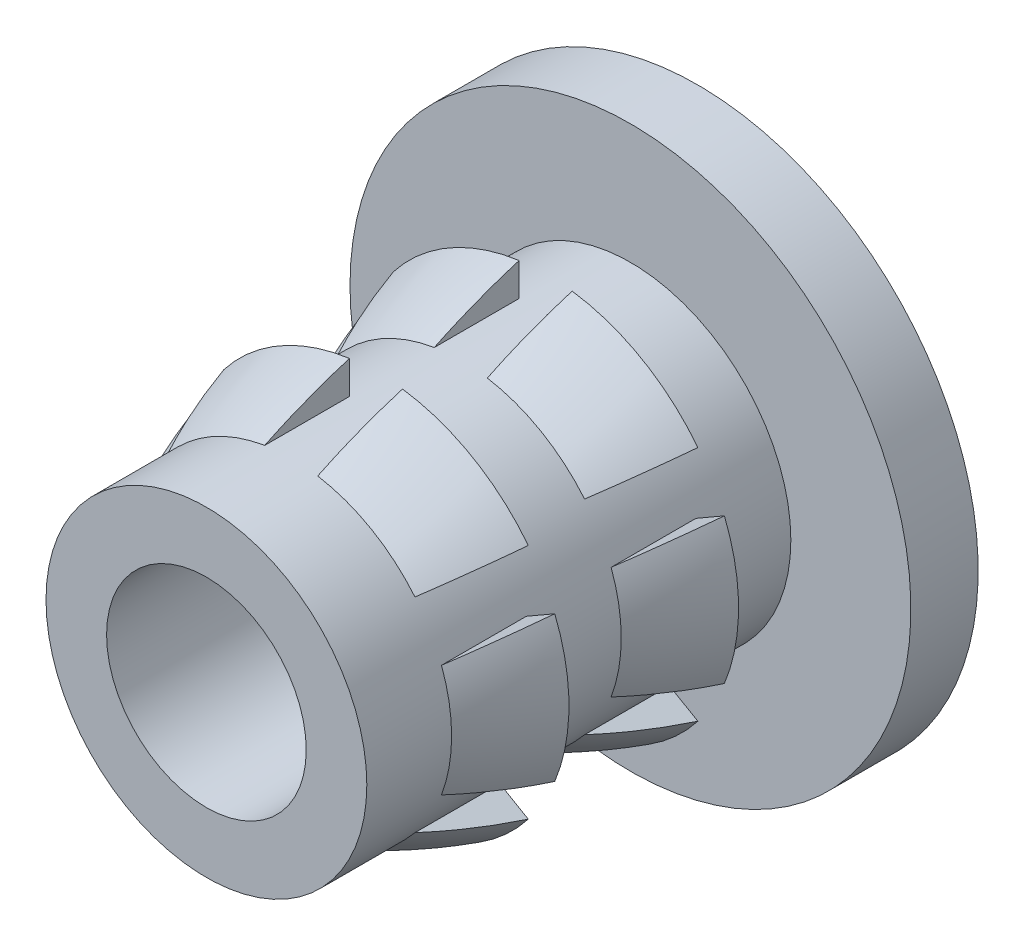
ISO-10303-21;
HEADER;
FILE_DESCRIPTION(('STEP AP214'),'2;1');
FILE_NAME('part.step','',(''),(''),'','','');
FILE_SCHEMA(('AUTOMOTIVE_DESIGN { 1 0 10303 214 1 1 1 1 }'));
ENDSEC;
DATA;
#1=APPLICATION_CONTEXT('core data for automotive mechanical design processes');
#2=APPLICATION_PROTOCOL_DEFINITION('international standard','automotive_design',2000,#1);
#3=PRODUCT_CONTEXT('',#1,'mechanical');
#4=PRODUCT('Part','Part','',(#3));
#5=PRODUCT_RELATED_PRODUCT_CATEGORY('part','',(#4));
#6=PRODUCT_DEFINITION_FORMATION('','',#4);
#7=PRODUCT_DEFINITION_CONTEXT('part definition',#1,'design');
#8=PRODUCT_DEFINITION('design','',#6,#7);
#9=PRODUCT_DEFINITION_SHAPE('','',#8);
#10=(LENGTH_UNIT() NAMED_UNIT(*) SI_UNIT(.MILLI.,.METRE.));
#11=(NAMED_UNIT(*) PLANE_ANGLE_UNIT() SI_UNIT($,.RADIAN.));
#12=(NAMED_UNIT(*) SI_UNIT($,.STERADIAN.) SOLID_ANGLE_UNIT());
#13=UNCERTAINTY_MEASURE_WITH_UNIT(LENGTH_MEASURE(1.E-05),#10,'distance_accuracy_value','');
#14=(GEOMETRIC_REPRESENTATION_CONTEXT(3) GLOBAL_UNCERTAINTY_ASSIGNED_CONTEXT((#13)) GLOBAL_UNIT_ASSIGNED_CONTEXT((#10,
#11,#12)) REPRESENTATION_CONTEXT('',''));
#15=CARTESIAN_POINT('',(0.,0.,0.));
#16=DIRECTION('',(0.,0.,1.));
#17=DIRECTION('',(1.,0.,0.));
#18=AXIS2_PLACEMENT_3D('',#15,#16,#17);
#19=CARTESIAN_POINT('',(10.75384757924,0.,-17.2405307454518));
#20=DIRECTION('',(0.,0.,1.));
#21=DIRECTION('',(1.,0.,0.));
#22=AXIS2_PLACEMENT_3D('',#19,#20,#21);
#23=PLANE('',#22);
#24=CARTESIAN_POINT('',(8.93774757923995,0.,-17.2405307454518));
#25=DIRECTION('',(0.,0.,-1.));
#26=DIRECTION('',(-1.,0.,0.));
#27=AXIS2_PLACEMENT_3D('',#24,#25,#26);
#28=CIRCLE('',#27,1.8161);
#29=CARTESIAN_POINT('',(7.53656596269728,1.15538274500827,-17.2405307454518));
#30=VERTEX_POINT('',#29);
#31=CARTESIAN_POINT('',(8.63774757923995,1.79115024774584,-17.2405307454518));
#32=VERTEX_POINT('',#31);
#33=EDGE_CURVE('E299',#30,#32,#28,.T.);
#34=ORIENTED_EDGE('',*,*,#33,.F.);
#35=DIRECTION('',(-0.866025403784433,0.50000000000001,0.));
#36=VECTOR('',#35,1.);
#37=CARTESIAN_POINT('',(10.4498225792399,-0.52658674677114,-17.2405307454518));
#38=LINE('',#37,#36);
#39=CARTESIAN_POINT('',(7.21392727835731,1.34165827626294,-17.2405307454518));
#40=VERTEX_POINT('',#39);
#41=EDGE_CURVE('E569',#30,#40,#38,.T.);
#42=ORIENTED_EDGE('',*,*,#41,.T.);
#43=CARTESIAN_POINT('',(8.93774757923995,0.,-17.2405307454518));
#44=DIRECTION('',(0.,0.,-1.));
#45=DIRECTION('',(-1.,0.,0.));
#46=AXIS2_PLACEMENT_3D('',#43,#44,#45);
#47=CIRCLE('',#46,2.1844);
#48=CARTESIAN_POINT('',(8.63774757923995,2.16370131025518,-17.2405307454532));
#49=VERTEX_POINT('',#48);
#50=EDGE_CURVE('E604',#40,#49,#47,.T.);
#51=ORIENTED_EDGE('',*,*,#50,.T.);
#52=DIRECTION('',(0.,-1.,0.));
#53=VECTOR('',#52,1.);
#54=CARTESIAN_POINT('',(8.63774757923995,0.,-17.2405307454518));
#55=LINE('',#54,#53);
#56=EDGE_CURVE('E448',#49,#32,#55,.T.);
#57=ORIENTED_EDGE('',*,*,#56,.T.);
#58=EDGE_LOOP('',(#34,#42,#51,#57));
#59=FACE_BOUND('',#58,.T.);
#60=ADVANCED_FACE('F43',(#59),#23,.F.);
#61=CARTESIAN_POINT('',(8.93774757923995,0.,-19.077055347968));
#62=DIRECTION('',(0.,0.,-1.));
#63=DIRECTION('',(-1.,0.,0.));
#64=AXIS2_PLACEMENT_3D('',#61,#62,#63);
#65=DEGENERATE_TOROIDAL_SURFACE('',#64,4.03884641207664,6.48857600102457,.F.);
#66=ORIENTED_EDGE('',*,*,#50,.F.);
#67=CARTESIAN_POINT('',(7.21387567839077,1.34168806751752,-17.2407307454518));
#68=CARTESIAN_POINT('',(7.25638494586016,1.317145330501,-17.0759447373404));
#69=CARTESIAN_POINT('',(7.30462719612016,1.28929265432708,-16.9131818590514));
#70=CARTESIAN_POINT('',(7.38536416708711,1.24267914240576,-16.6728736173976));
#71=CARTESIAN_POINT('',(7.41366221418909,1.22634125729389,-16.5934337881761));
#72=CARTESIAN_POINT('',(7.47306506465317,1.19204500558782,-16.4358119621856));
#73=CARTESIAN_POINT('',(7.50417436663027,1.17408404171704,-16.3576322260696));
#74=CARTESIAN_POINT('',(7.53664985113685,1.1553343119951,-16.2802107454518));
#75=B_SPLINE_CURVE_WITH_KNOTS('',3,(#67,#68,#69,#70,#71,#72,#73,#74),.UNSPECIFIED.,.F.,.F.,(4,2,
2,4),(0.,0.515567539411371,0.773194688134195,1.03124165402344),.UNSPECIFIED.);
#76=CARTESIAN_POINT('',(7.53656596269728,1.15538274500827,-16.2804107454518));
#77=VERTEX_POINT('',#76);
#78=EDGE_CURVE('E563',#40,#77,#75,.T.);
#79=ORIENTED_EDGE('',*,*,#78,.T.);
#80=CARTESIAN_POINT('',(8.93774757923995,0.,-16.2804107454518));
#81=DIRECTION('',(0.,0.,-1.));
#82=DIRECTION('',(-1.,0.,0.));
#83=AXIS2_PLACEMENT_3D('',#80,#81,#82);
#84=CIRCLE('',#83,1.8161);
#85=CARTESIAN_POINT('',(8.63774757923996,1.79115024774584,-16.2804107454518));
#86=VERTEX_POINT('',#85);
#87=EDGE_CURVE('E354',#77,#86,#84,.T.);
#88=ORIENTED_EDGE('',*,*,#87,.T.);
#89=CARTESIAN_POINT('',(8.63774757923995,1.99680857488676,-16.7529502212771));
#90=CARTESIAN_POINT('',(8.63774757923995,2.06197951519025,-16.9209435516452));
#91=CARTESIAN_POINT('',(8.63774757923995,2.12005202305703,-17.0917232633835));
#92=CARTESIAN_POINT('',(8.63774757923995,2.22163662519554,-17.4376354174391));
#93=CARTESIAN_POINT('',(8.63774757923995,2.26514130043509,-17.612770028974));
#94=CARTESIAN_POINT('',(8.63774757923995,2.33733891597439,-17.9663608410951));
#95=CARTESIAN_POINT('',(8.63774757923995,2.36600815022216,-18.1448218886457));
#96=CARTESIAN_POINT('',(8.63774757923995,2.40824914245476,-18.5035846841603));
#97=CARTESIAN_POINT('',(8.63774757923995,2.42181553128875,-18.6838870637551));
#98=CARTESIAN_POINT('',(8.63774757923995,2.43374322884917,-19.0449571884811));
#99=CARTESIAN_POINT('',(8.63774757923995,2.43210765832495,-19.2257248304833));
#100=CARTESIAN_POINT('',(8.63774757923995,2.41364946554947,-19.5864830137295));
#101=CARTESIAN_POINT('',(8.63774757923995,2.39682685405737,-19.7664735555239));
#102=CARTESIAN_POINT('',(8.63774757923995,2.34810674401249,-20.1243865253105));
#103=CARTESIAN_POINT('',(8.63774757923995,2.31621060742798,-20.3023091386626));
#104=CARTESIAN_POINT('',(8.63774757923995,2.23756417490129,-20.6547756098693));
#105=CARTESIAN_POINT('',(8.63774757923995,2.19081911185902,-20.8293206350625));
#106=CARTESIAN_POINT('',(8.63774757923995,2.08263577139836,-21.1742670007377));
#107=CARTESIAN_POINT('',(8.63774757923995,2.02116179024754,-21.3446571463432));
#108=CARTESIAN_POINT('',(8.63774757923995,1.88394363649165,-21.6796389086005));
#109=CARTESIAN_POINT('',(8.63774757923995,1.80819648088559,-21.8442293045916));
#110=CARTESIAN_POINT('',(8.63774757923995,1.64290636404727,-22.1662452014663));
#111=CARTESIAN_POINT('',(8.63774757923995,1.55336862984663,-22.3236733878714));
#112=CARTESIAN_POINT('',(8.63774757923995,1.36093767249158,-22.6300666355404));
#113=CARTESIAN_POINT('',(8.63774757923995,1.25805311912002,-22.7790371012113));
#114=CARTESIAN_POINT('',(8.63774757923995,1.10606090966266,-22.9788574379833));
#115=CARTESIAN_POINT('',(8.63774757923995,1.06253347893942,-23.0340114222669));
#116=CARTESIAN_POINT('',(8.63774757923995,0.973448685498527,-23.1426610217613));
#117=CARTESIAN_POINT('',(8.63774757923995,0.927891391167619,-23.1961566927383));
#118=CARTESIAN_POINT('',(8.63774757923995,0.834821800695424,-23.3011172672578));
#119=CARTESIAN_POINT('',(8.63774757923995,0.787316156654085,-23.3525880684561));
#120=CARTESIAN_POINT('',(8.63774757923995,0.690051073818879,-23.4533458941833));
#121=CARTESIAN_POINT('',(8.63774757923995,0.640292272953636,-23.5026335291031));
#122=CARTESIAN_POINT('',(8.63774757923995,0.55496425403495,-23.5825144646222));
#123=CARTESIAN_POINT('',(8.63774757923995,0.520139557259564,-23.6139032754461));
#124=CARTESIAN_POINT('',(8.63774757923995,0.448857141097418,-23.6750764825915));
#125=CARTESIAN_POINT('',(8.63774757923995,0.412393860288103,-23.7048545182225));
#126=CARTESIAN_POINT('',(8.63774757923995,0.355964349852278,-23.7476043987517));
#127=CARTESIAN_POINT('',(8.63774757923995,0.336772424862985,-23.76159511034));
#128=CARTESIAN_POINT('',(8.63774757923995,0.297731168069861,-23.7886209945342));
#129=CARTESIAN_POINT('',(8.63774757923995,0.277882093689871,-23.8016565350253));
#130=CARTESIAN_POINT('',(8.63774757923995,0.237417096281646,-23.8263350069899));
#131=CARTESIAN_POINT('',(8.63774757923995,0.216804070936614,-23.8379826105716));
#132=CARTESIAN_POINT('',(8.63774757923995,0.174572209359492,-23.859244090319));
#133=CARTESIAN_POINT('',(8.63774757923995,0.152955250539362,-23.8688615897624));
#134=CARTESIAN_POINT('',(8.63774757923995,0.108443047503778,-23.8850320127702));
#135=CARTESIAN_POINT('',(8.63774757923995,0.0855430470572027,-23.8915725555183));
#136=CARTESIAN_POINT('',(8.63774757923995,0.0389990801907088,-23.9000687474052));
#137=CARTESIAN_POINT('',(8.63774757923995,0.0153612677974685,-23.9020554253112));
#138=CARTESIAN_POINT('',(8.63774757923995,-0.0318476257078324,-23.9008993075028));
#139=CARTESIAN_POINT('',(8.63774757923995,-0.0554182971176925,-23.897741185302));
#140=CARTESIAN_POINT('',(8.63774757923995,-0.101687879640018,-23.8871874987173));
#141=CARTESIAN_POINT('',(8.63774757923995,-0.124379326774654,-23.8797617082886));
#142=CARTESIAN_POINT('',(8.63774757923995,-0.171866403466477,-23.8607635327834));
#143=CARTESIAN_POINT('',(8.63774757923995,-0.196472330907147,-23.8487383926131));
#144=CARTESIAN_POINT('',(8.63774757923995,-0.244449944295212,-23.8224002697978));
#145=CARTESIAN_POINT('',(8.63774757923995,-0.267818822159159,-23.8080823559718));
#146=CARTESIAN_POINT('',(8.63774757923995,-0.313714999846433,-23.7778984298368));
#147=CARTESIAN_POINT('',(8.63774757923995,-0.336236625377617,-23.7620239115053));
#148=CARTESIAN_POINT('',(8.63774757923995,-0.380489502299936,-23.7292672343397));
#149=CARTESIAN_POINT('',(8.63774757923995,-0.402221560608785,-23.7123861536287));
#150=CARTESIAN_POINT('',(8.63774757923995,-0.466923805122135,-23.6602826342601));
#151=CARTESIAN_POINT('',(8.63774757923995,-0.508961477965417,-23.6239048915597));
#152=CARTESIAN_POINT('',(8.63774757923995,-0.591236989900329,-23.5491559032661));
#153=CARTESIAN_POINT('',(8.63774757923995,-0.631473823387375,-23.5107835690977));
#154=CARTESIAN_POINT('',(8.63774757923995,-0.710493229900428,-23.4324223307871));
#155=CARTESIAN_POINT('',(8.63774757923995,-0.749272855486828,-23.3924304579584));
#156=CARTESIAN_POINT('',(8.63774757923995,-0.82543143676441,-23.3111590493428));
#157=CARTESIAN_POINT('',(8.63774757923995,-0.86281072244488,-23.2698798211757));
#158=CARTESIAN_POINT('',(8.63774757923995,-0.972903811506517,-23.1444123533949));
#159=CARTESIAN_POINT('',(8.63774757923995,-1.04366624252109,-23.0585004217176));
#160=CARTESIAN_POINT('',(8.63774757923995,-1.18010146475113,-22.8828870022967));
#161=CARTESIAN_POINT('',(8.63774757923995,-1.24577901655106,-22.7931891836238));
#162=CARTESIAN_POINT('',(8.63774757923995,-1.40920189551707,-22.556684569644));
#163=CARTESIAN_POINT('',(8.63774757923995,-1.50316204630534,-22.4072389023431));
#164=CARTESIAN_POINT('',(8.63774757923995,-1.67822469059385,-22.1008887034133));
#165=CARTESIAN_POINT('',(8.63774757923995,-1.75931791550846,-21.943978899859));
#166=CARTESIAN_POINT('',(8.63774757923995,-1.90814160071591,-21.6240209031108));
#167=CARTESIAN_POINT('',(8.63774757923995,-1.97587754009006,-21.4609752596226));
#168=CARTESIAN_POINT('',(8.63774757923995,-2.09763057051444,-21.1298850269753));
#169=CARTESIAN_POINT('',(8.63774757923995,-2.15165071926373,-20.9618415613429));
#170=CARTESIAN_POINT('',(8.63774757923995,-2.24598607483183,-20.6207408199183));
#171=CARTESIAN_POINT('',(8.63774757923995,-2.28620727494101,-20.4476575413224));
#172=CARTESIAN_POINT('',(8.63774757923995,-2.35220401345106,-20.0986987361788));
#173=CARTESIAN_POINT('',(8.63774757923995,-2.3779746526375,-19.9228222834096));
#174=CARTESIAN_POINT('',(8.63774757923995,-2.41488609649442,-19.569553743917));
#175=CARTESIAN_POINT('',(8.63774757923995,-2.42602796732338,-19.392161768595));
#176=CARTESIAN_POINT('',(8.63774757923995,-2.43361501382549,-19.0370634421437));
#177=CARTESIAN_POINT('',(8.63774757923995,-2.43006008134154,-18.8593570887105));
#178=CARTESIAN_POINT('',(8.63774757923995,-2.40807548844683,-18.5015933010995));
#179=CARTESIAN_POINT('',(8.63774757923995,-2.38937434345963,-18.3215524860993));
#180=CARTESIAN_POINT('',(8.63774757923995,-2.33688520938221,-17.9637463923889));
#181=CARTESIAN_POINT('',(8.63774757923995,-2.30310231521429,-17.7859803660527));
#182=CARTESIAN_POINT('',(8.63774757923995,-2.22062195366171,-17.4337245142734));
#183=CARTESIAN_POINT('',(8.63774757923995,-2.17190730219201,-17.2592387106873));
#184=CARTESIAN_POINT('',(8.63774757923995,-2.05989551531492,-16.9150428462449));
#185=CARTESIAN_POINT('',(8.63774757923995,-1.99660074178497,-16.7453320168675));
#186=CARTESIAN_POINT('',(8.63774757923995,-1.8558353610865,-16.4119615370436));
#187=CARTESIAN_POINT('',(8.63774757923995,-1.77836992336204,-16.2482997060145));
#188=CARTESIAN_POINT('',(8.63774757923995,-1.60963775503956,-15.9281442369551));
#189=CARTESIAN_POINT('',(8.63774757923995,-1.51836360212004,-15.771654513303));
#190=CARTESIAN_POINT('',(8.63774757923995,-1.32259459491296,-15.4674643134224));
#191=CARTESIAN_POINT('',(8.63774757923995,-1.21812093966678,-15.3197502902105));
#192=CARTESIAN_POINT('',(8.63774757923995,-1.05158332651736,-15.1060195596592));
#193=CARTESIAN_POINT('',(8.63774757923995,-0.99445929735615,-15.0361107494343));
#194=CARTESIAN_POINT('',(8.63774757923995,-0.876821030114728,-14.8992154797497));
#195=CARTESIAN_POINT('',(8.63774757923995,-0.816307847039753,-14.8322281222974));
#196=CARTESIAN_POINT('',(8.63774757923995,-0.722787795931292,-14.7344505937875));
#197=CARTESIAN_POINT('',(8.63774757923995,-0.691171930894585,-14.7023234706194));
#198=CARTESIAN_POINT('',(8.63774757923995,-0.626909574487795,-14.6390989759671));
#199=CARTESIAN_POINT('',(8.63774757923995,-0.594262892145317,-14.608001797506));
#200=CARTESIAN_POINT('',(8.63774757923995,-0.527867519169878,-14.5471671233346));
#201=CARTESIAN_POINT('',(8.63774757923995,-0.494121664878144,-14.5174265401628));
#202=CARTESIAN_POINT('',(8.63774757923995,-0.42517854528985,-14.459689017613));
#203=CARTESIAN_POINT('',(8.63774757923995,-0.3899821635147,-14.4316910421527));
#204=CARTESIAN_POINT('',(8.63774757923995,-0.328001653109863,-14.386139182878));
#205=CARTESIAN_POINT('',(8.63774757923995,-0.301722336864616,-14.3679036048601));
#206=CARTESIAN_POINT('',(8.63774757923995,-0.247705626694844,-14.3335781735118));
#207=CARTESIAN_POINT('',(8.63774757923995,-0.219966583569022,-14.3174908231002));
#208=CARTESIAN_POINT('',(8.63774757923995,-0.169226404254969,-14.2923847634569));
#209=CARTESIAN_POINT('',(8.63774757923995,-0.146619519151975,-14.2825920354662));
#210=CARTESIAN_POINT('',(8.63774757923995,-0.10020073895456,-14.2665676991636));
#211=CARTESIAN_POINT('',(8.63774757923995,-0.0763944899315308,-14.26032084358));
#212=CARTESIAN_POINT('',(8.63774757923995,-0.0324845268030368,-14.253548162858));
#213=CARTESIAN_POINT('',(8.63774757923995,-0.0125186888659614,-14.2521724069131));
#214=CARTESIAN_POINT('',(8.63774757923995,0.0273225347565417,-14.2530548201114));
#215=CARTESIAN_POINT('',(8.63774757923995,0.0471979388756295,-14.2553122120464));
#216=CARTESIAN_POINT('',(8.63774757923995,0.0932471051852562,-14.2643258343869));
#217=CARTESIAN_POINT('',(8.63774757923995,0.119150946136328,-14.2723950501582));
#218=CARTESIAN_POINT('',(8.63774757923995,0.169541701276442,-14.2922890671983));
#219=CARTESIAN_POINT('',(8.63774757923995,0.194018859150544,-14.3041367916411));
#220=CARTESIAN_POINT('',(8.63774757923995,0.237692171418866,-14.3279190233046));
#221=CARTESIAN_POINT('',(8.63774757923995,0.257084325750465,-14.3395040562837));
#222=CARTESIAN_POINT('',(8.63774757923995,0.295171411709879,-14.3637769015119));
#223=CARTESIAN_POINT('',(8.63774757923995,0.313865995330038,-14.3764652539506));
#224=CARTESIAN_POINT('',(8.63774757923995,0.369188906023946,-14.4157555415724));
#225=CARTESIAN_POINT('',(8.63774757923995,0.404975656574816,-14.4435351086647));
#226=CARTESIAN_POINT('',(8.63774757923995,0.475139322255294,-14.5011020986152));
#227=CARTESIAN_POINT('',(8.63774757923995,0.509508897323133,-14.530898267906));
#228=CARTESIAN_POINT('',(8.63774757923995,0.576957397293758,-14.5918240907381));
#229=CARTESIAN_POINT('',(8.63774757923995,0.610037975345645,-14.622951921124));
#230=CARTESIAN_POINT('',(8.63774757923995,0.696702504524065,-14.7072554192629));
#231=CARTESIAN_POINT('',(8.63774757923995,0.749360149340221,-14.7613833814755));
#232=CARTESIAN_POINT('',(8.63774757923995,0.852163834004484,-14.8719829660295));
#233=CARTESIAN_POINT('',(8.63774757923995,0.902309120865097,-14.9284552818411));
#234=CARTESIAN_POINT('',(8.63774757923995,1.04933684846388,-15.1010536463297));
#235=CARTESIAN_POINT('',(8.63774757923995,1.14267410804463,-15.2202246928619));
#236=CARTESIAN_POINT('',(8.63774757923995,1.31977520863,-15.4647508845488));
#237=CARTESIAN_POINT('',(8.63774757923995,1.40357349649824,-15.5900812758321));
#238=CARTESIAN_POINT('',(8.63774757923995,1.56178267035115,-15.8463860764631));
#239=CARTESIAN_POINT('',(8.63774757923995,1.63620193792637,-15.9773553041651));
#240=CARTESIAN_POINT('',(8.63774757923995,1.7602315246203,-16.2150105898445));
#241=CARTESIAN_POINT('',(8.63774757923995,1.81170502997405,-16.3207300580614));
#242=CARTESIAN_POINT('',(8.63774757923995,1.90873065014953,-16.5348870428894));
#243=CARTESIAN_POINT('',(8.63774757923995,1.95428096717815,-16.6433253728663));
#244=CARTESIAN_POINT('',(8.63774757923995,1.99680857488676,-16.7529502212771));
#245=B_SPLINE_CURVE_WITH_KNOTS('',3,(#89,#90,#91,#92,#93,#94,#95,#96,#97,#98,#99,#100,#101,#102,
#103,#104,#105,#106,#107,#108,#109,#110,#111,#112,#113,#114,#115,#116,#117,#118,#119,#120,#121,
#122,#123,#124,#125,#126,#127,#128,#129,#130,#131,#132,#133,#134,#135,#136,#137,#138,#139,#140,
#141,#142,#143,#144,#145,#146,#147,#148,#149,#150,#151,#152,#153,#154,#155,#156,#157,#158,#159,
#160,#161,#162,#163,#164,#165,#166,#167,#168,#169,#170,#171,#172,#173,#174,#175,#176,#177,#178,
#179,#180,#181,#182,#183,#184,#185,#186,#187,#188,#189,#190,#191,#192,#193,#194,#195,#196,#197,
#198,#199,#200,#201,#202,#203,#204,#205,#206,#207,#208,#209,#210,#211,#212,#213,#214,#215,#216,
#217,#218,#219,#220,#221,#222,#223,#224,#225,#226,#227,#228,#229,#230,#231,#232,#233,#234,#235,
#236,#237,#238,#239,#240,#241,#242,#243,#244),.UNSPECIFIED.,.T.,.F.,(4,2,2,2,2,2,2,2,2,2,2,2,2,
2,2,2,2,2,2,2,2,2,2,2,2,2,2,2,2,2,2,2,2,2,2,2,2,2,2,2,2,2,2,2,2,2,2,2,2,2,2,2,2,2,2,2,2,2,2,2,2,
2,2,2,2,2,2,2,2,2,2,2,2,2,2,2,2,4),(0.,0.540467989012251,1.08121080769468,1.622815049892,
2.16461177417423,2.70629727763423,3.24798239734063,3.78961858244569,4.33106410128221,
4.87383563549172,5.41672073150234,5.95940056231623,6.50172962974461,6.71247757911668,
6.92321843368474,7.13329152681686,7.34330551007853,7.48392096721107,7.62505629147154,
7.69628695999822,7.76749004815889,7.83844624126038,7.90927470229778,7.98038576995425,
8.05101084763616,8.12184670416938,8.19319055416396,8.27515624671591,8.35730065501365,
8.43992201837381,8.52245642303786,8.68912360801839,8.85588272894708,9.02296274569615,
9.19000313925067,9.52368731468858,9.85705521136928,10.3859509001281,10.9152258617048,
11.4442832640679,11.9732226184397,12.5056970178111,13.0383518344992,13.5709678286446,
14.1035877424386,14.6459714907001,15.1881721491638,15.7309991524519,16.2737382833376,
16.8162798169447,17.3591140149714,17.9010872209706,18.1718437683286,18.4425164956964,
18.5777228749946,18.7129544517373,18.8478610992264,18.9826867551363,19.078589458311,
19.174602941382,19.2483363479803,19.3217502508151,19.3814673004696,19.4411715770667,
19.5220788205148,19.6034865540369,19.6712076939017,19.7389621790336,19.874751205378,
20.0111724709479,20.1474125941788,20.3738563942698,20.6003676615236,21.0539684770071,
21.5058754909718,21.9573757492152,22.3099539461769,22.6626389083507),.UNSPECIFIED.);
#246=EDGE_CURVE('E1194',#86,#49,#245,.T.);
#247=ORIENTED_EDGE('',*,*,#246,.T.);
#248=EDGE_LOOP('',(#66,#79,#88,#247));
#249=FACE_BOUND('',#248,.T.);
#250=ADVANCED_FACE('F689',(#249),#65,.F.);
#251=CARTESIAN_POINT('',(10.75384757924,0.,-15.3202907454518));
#252=DIRECTION('',(0.,0.,1.));
#253=DIRECTION('',(1.,0.,0.));
#254=AXIS2_PLACEMENT_3D('',#251,#252,#253);
#255=PLANE('',#254);
#256=CARTESIAN_POINT('',(8.93774757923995,0.,-15.3202907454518));
#257=DIRECTION('',(0.,0.,-1.));
#258=DIRECTION('',(-1.,0.,0.));
#259=AXIS2_PLACEMENT_3D('',#256,#257,#258);
#260=CIRCLE('',#259,1.8161);
#261=CARTESIAN_POINT('',(7.53656596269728,1.15538274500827,-15.3202907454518));
#262=VERTEX_POINT('',#261);
#263=CARTESIAN_POINT('',(8.63774757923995,1.79115024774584,-15.3202907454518));
#264=VERTEX_POINT('',#263);
#265=EDGE_CURVE('E356',#262,#264,#260,.T.);
#266=ORIENTED_EDGE('',*,*,#265,.F.);
#267=DIRECTION('',(-0.866025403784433,0.50000000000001,0.));
#268=VECTOR('',#267,1.);
#269=CARTESIAN_POINT('',(10.4498225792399,-0.52658674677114,-15.3202907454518));
#270=LINE('',#269,#268);
#271=CARTESIAN_POINT('',(7.21392727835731,1.34165827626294,-15.3202907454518));
#272=VERTEX_POINT('',#271);
#273=EDGE_CURVE('E561',#262,#272,#270,.T.);
#274=ORIENTED_EDGE('',*,*,#273,.T.);
#275=CARTESIAN_POINT('',(8.93774757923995,0.,-15.3202907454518));
#276=DIRECTION('',(0.,0.,-1.));
#277=DIRECTION('',(-1.,0.,0.));
#278=AXIS2_PLACEMENT_3D('',#275,#276,#277);
#279=CIRCLE('',#278,2.1844);
#280=CARTESIAN_POINT('',(8.63774757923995,2.16370131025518,-15.3202907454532));
#281=VERTEX_POINT('',#280);
#282=EDGE_CURVE('E370',#272,#281,#279,.T.);
#283=ORIENTED_EDGE('',*,*,#282,.T.);
#284=DIRECTION('',(0.,-1.,0.));
#285=VECTOR('',#284,1.);
#286=CARTESIAN_POINT('',(8.63774757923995,0.,-15.3202907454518));
#287=LINE('',#286,#285);
#288=EDGE_CURVE('E749',#281,#264,#287,.T.);
#289=ORIENTED_EDGE('',*,*,#288,.T.);
#290=EDGE_LOOP('',(#266,#274,#283,#289));
#291=FACE_BOUND('',#290,.T.);
#292=ADVANCED_FACE('F695',(#291),#255,.F.);
#293=CARTESIAN_POINT('',(8.93774757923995,0.,-17.1506228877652));
#294=DIRECTION('',(0.,0.,-1.));
#295=DIRECTION('',(-1.,0.,0.));
#296=AXIS2_PLACEMENT_3D('',#293,#294,#295);
#297=DEGENERATE_TOROIDAL_SURFACE('',#296,4.02270330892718,6.47134045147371,.F.);
#298=ORIENTED_EDGE('',*,*,#282,.F.);
#299=CARTESIAN_POINT('',(7.21387571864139,1.34168804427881,-15.3204907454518));
#300=CARTESIAN_POINT('',(7.25635476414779,1.31716275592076,-15.155693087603));
#301=CARTESIAN_POINT('',(7.3045824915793,1.28931846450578,-14.9929227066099));
#302=CARTESIAN_POINT('',(7.38531977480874,1.24270477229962,-14.7526135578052));
#303=CARTESIAN_POINT('',(7.41362155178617,1.22636473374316,-14.6731752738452));
#304=CARTESIAN_POINT('',(7.47303927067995,1.1920598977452,-14.5155598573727));
#305=CARTESIAN_POINT('',(7.50415974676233,1.17409248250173,-14.4373850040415));
#306=CARTESIAN_POINT('',(7.53664989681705,1.15533428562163,-14.3599707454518));
#307=B_SPLINE_CURVE_WITH_KNOTS('',3,(#299,#300,#301,#302,#303,#304,#305,#306),.UNSPECIFIED.,.F.,
.F.,(4,2,2,4),(0.,0.515569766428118,0.773197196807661,1.03124666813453),.UNSPECIFIED.);
#308=CARTESIAN_POINT('',(7.53656596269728,1.15538274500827,-14.3601707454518));
#309=VERTEX_POINT('',#308);
#310=EDGE_CURVE('E293',#272,#309,#307,.T.);
#311=ORIENTED_EDGE('',*,*,#310,.T.);
#312=CARTESIAN_POINT('',(8.93774757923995,0.,-14.3601707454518));
#313=DIRECTION('',(0.,0.,-1.));
#314=DIRECTION('',(-1.,0.,0.));
#315=AXIS2_PLACEMENT_3D('',#312,#313,#314);
#316=CIRCLE('',#315,1.8161);
#317=CARTESIAN_POINT('',(8.63774757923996,1.79115024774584,-14.3601707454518));
#318=VERTEX_POINT('',#317);
#319=EDGE_CURVE('E386',#309,#318,#316,.T.);
#320=ORIENTED_EDGE('',*,*,#319,.T.);
#321=CARTESIAN_POINT('',(8.63774757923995,1.99685989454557,-14.8326903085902));
#322=CARTESIAN_POINT('',(8.63774757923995,2.06185846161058,-15.0002393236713));
#323=CARTESIAN_POINT('',(8.63774757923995,2.11977748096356,-15.1705674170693));
#324=CARTESIAN_POINT('',(8.63774757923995,2.22109351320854,-15.5155648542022));
#325=CARTESIAN_POINT('',(8.63774757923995,2.26448312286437,-15.6902363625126));
#326=CARTESIAN_POINT('',(8.63774757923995,2.33648956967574,-16.0428922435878));
#327=CARTESIAN_POINT('',(8.63774757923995,2.365082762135,-16.2208814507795));
#328=CARTESIAN_POINT('',(8.63774757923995,2.4072113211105,-16.5786957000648));
#329=CARTESIAN_POINT('',(8.63774757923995,2.42074133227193,-16.7585213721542));
#330=CARTESIAN_POINT('',(8.63774757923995,2.43263613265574,-17.1186350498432));
#331=CARTESIAN_POINT('',(8.63774757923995,2.43100418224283,-17.298922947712));
#332=CARTESIAN_POINT('',(8.63774757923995,2.41259340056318,-17.6587236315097));
#333=CARTESIAN_POINT('',(8.63774757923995,2.3958145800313,-17.8382364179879));
#334=CARTESIAN_POINT('',(8.63774757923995,2.34722198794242,-18.1951990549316));
#335=CARTESIAN_POINT('',(8.63774757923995,2.31540959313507,-18.3726490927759));
#336=CARTESIAN_POINT('',(8.63774757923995,2.2369700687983,-18.7241792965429));
#337=CARTESIAN_POINT('',(8.63774757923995,2.19034815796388,-18.8982606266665));
#338=CARTESIAN_POINT('',(8.63774757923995,2.0824506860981,-19.2422891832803));
#339=CARTESIAN_POINT('',(8.63774757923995,2.02113963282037,-19.4122252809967));
#340=CARTESIAN_POINT('',(8.63774757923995,1.88428593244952,-19.7463142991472));
#341=CARTESIAN_POINT('',(8.63774757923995,1.80874032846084,-19.9104660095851));
#342=CARTESIAN_POINT('',(8.63774757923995,1.64389122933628,-20.2316243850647));
#343=CARTESIAN_POINT('',(8.63774757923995,1.55459294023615,-20.3886337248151));
#344=CARTESIAN_POINT('',(8.63774757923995,1.36267897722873,-20.6942139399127));
#345=CARTESIAN_POINT('',(8.63774757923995,1.2600719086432,-20.8427901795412));
#346=CARTESIAN_POINT('',(8.63774757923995,1.1083261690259,-21.0423103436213));
#347=CARTESIAN_POINT('',(8.63774757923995,1.06474113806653,-21.097537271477));
#348=CARTESIAN_POINT('',(8.63774757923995,0.975532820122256,-21.206325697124));
#349=CARTESIAN_POINT('',(8.63774757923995,0.929909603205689,-21.25988725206));
#350=CARTESIAN_POINT('',(8.63774757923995,0.836700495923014,-21.3649729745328));
#351=CARTESIAN_POINT('',(8.63774757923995,0.789121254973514,-21.4165030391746));
#352=CARTESIAN_POINT('',(8.63774757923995,0.691703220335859,-21.517372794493));
#353=CARTESIAN_POINT('',(8.63774757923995,0.64186506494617,-21.5667130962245));
#354=CARTESIAN_POINT('',(8.63774757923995,0.556380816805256,-21.6466983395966));
#355=CARTESIAN_POINT('',(8.63774757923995,0.521479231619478,-21.6781392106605));
#356=CARTESIAN_POINT('',(8.63774757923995,0.450042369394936,-21.7394129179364));
#357=CARTESIAN_POINT('',(8.63774757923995,0.413501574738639,-21.7692394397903));
#358=CARTESIAN_POINT('',(8.63774757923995,0.356957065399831,-21.8120607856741));
#359=CARTESIAN_POINT('',(8.63774757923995,0.337727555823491,-21.8260747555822));
#360=CARTESIAN_POINT('',(8.63774757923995,0.298611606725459,-21.8531477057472));
#361=CARTESIAN_POINT('',(8.63774757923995,0.278725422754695,-21.8662070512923));
#362=CARTESIAN_POINT('',(8.63774757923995,0.238185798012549,-21.890935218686));
#363=CARTESIAN_POINT('',(8.63774757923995,0.217535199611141,-21.9026086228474));
#364=CARTESIAN_POINT('',(8.63774757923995,0.175228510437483,-21.9239239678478));
#365=CARTESIAN_POINT('',(8.63774757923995,0.153574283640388,-21.9335695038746));
#366=CARTESIAN_POINT('',(8.63774757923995,0.108955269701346,-21.949809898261));
#367=CARTESIAN_POINT('',(8.63774757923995,0.0859840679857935,-21.9563880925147));
#368=CARTESIAN_POINT('',(8.63774757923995,0.0392927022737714,-21.9649429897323));
#369=CARTESIAN_POINT('',(8.63774757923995,0.0155787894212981,-21.9669510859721));
#370=CARTESIAN_POINT('',(8.63774757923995,-0.0317860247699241,-21.9658132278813));
#371=CARTESIAN_POINT('',(8.63774757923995,-0.0554365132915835,-21.9626515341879));
#372=CARTESIAN_POINT('',(8.63774757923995,-0.101863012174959,-21.9520704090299));
#373=CARTESIAN_POINT('',(8.63774757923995,-0.124631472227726,-21.9446203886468));
#374=CARTESIAN_POINT('',(8.63774757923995,-0.172286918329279,-21.9255556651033));
#375=CARTESIAN_POINT('',(8.63774757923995,-0.196982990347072,-21.9134853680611));
#376=CARTESIAN_POINT('',(8.63774757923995,-0.245136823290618,-21.8870494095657));
#377=CARTESIAN_POINT('',(8.63774757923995,-0.268591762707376,-21.8726787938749));
#378=CARTESIAN_POINT('',(8.63774757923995,-0.314657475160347,-21.8423852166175));
#379=CARTESIAN_POINT('',(8.63774757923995,-0.337262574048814,-21.8264537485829));
#380=CARTESIAN_POINT('',(8.63774757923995,-0.381680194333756,-21.7935803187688));
#381=CARTESIAN_POINT('',(8.63774757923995,-0.403493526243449,-21.776639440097));
#382=CARTESIAN_POINT('',(8.63774757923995,-0.468365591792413,-21.7244100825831));
#383=CARTESIAN_POINT('',(8.63774757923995,-0.510493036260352,-21.6879675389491));
#384=CARTESIAN_POINT('',(8.63774757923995,-0.592945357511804,-21.6130852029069));
#385=CARTESIAN_POINT('',(8.63774757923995,-0.633269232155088,-21.5746443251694));
#386=CARTESIAN_POINT('',(8.63774757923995,-0.712458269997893,-21.4961410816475));
#387=CARTESIAN_POINT('',(8.63774757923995,-0.751320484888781,-21.4560757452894));
#388=CARTESIAN_POINT('',(8.63774757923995,-0.82763876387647,-21.3746519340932));
#389=CARTESIAN_POINT('',(8.63774757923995,-0.865095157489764,-21.333293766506));
#390=CARTESIAN_POINT('',(8.63774757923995,-0.975408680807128,-21.2075828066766));
#391=CARTESIAN_POINT('',(8.63774757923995,-1.04630522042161,-21.1214980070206));
#392=CARTESIAN_POINT('',(8.63774757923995,-1.18298003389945,-20.9455177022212));
#393=CARTESIAN_POINT('',(8.63774757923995,-1.24876307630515,-20.8556258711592));
#394=CARTESIAN_POINT('',(8.63774757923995,-1.41198500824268,-20.619222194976));
#395=CARTESIAN_POINT('',(8.63774757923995,-1.50566925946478,-20.4700950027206));
#396=CARTESIAN_POINT('',(8.63774757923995,-1.6802061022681,-20.1644038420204));
#397=CARTESIAN_POINT('',(8.63774757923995,-1.76104950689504,-20.0078346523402));
#398=CARTESIAN_POINT('',(8.63774757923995,-1.90940107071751,-19.6885740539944));
#399=CARTESIAN_POINT('',(8.63774757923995,-1.97691451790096,-19.5258851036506));
#400=CARTESIAN_POINT('',(8.63774757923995,-2.09824922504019,-19.1955238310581));
#401=CARTESIAN_POINT('',(8.63774757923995,-2.15207351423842,-19.0278526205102));
#402=CARTESIAN_POINT('',(8.63774757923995,-2.24603644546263,-18.6875369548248));
#403=CARTESIAN_POINT('',(8.63774757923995,-2.28608326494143,-18.5148671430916));
#404=CARTESIAN_POINT('',(8.63774757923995,-2.35176361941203,-18.1667480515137));
#405=CARTESIAN_POINT('',(8.63774757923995,-2.37739226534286,-17.9912978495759));
#406=CARTESIAN_POINT('',(8.63774757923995,-2.41405286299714,-17.6388928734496));
#407=CARTESIAN_POINT('',(8.63774757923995,-2.42508595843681,-17.4619382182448));
#408=CARTESIAN_POINT('',(8.63774757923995,-2.43248948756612,-17.1077220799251));
#409=CARTESIAN_POINT('',(8.63774757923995,-2.42885981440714,-16.9304605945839));
#410=CARTESIAN_POINT('',(8.63774757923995,-2.40676099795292,-16.5736284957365));
#411=CARTESIAN_POINT('',(8.63774757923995,-2.38802343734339,-16.394074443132));
#412=CARTESIAN_POINT('',(8.63774757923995,-2.33550241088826,-16.0372430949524));
#413=CARTESIAN_POINT('',(8.63774757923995,-2.30172402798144,-15.8599650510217));
#414=CARTESIAN_POINT('',(8.63774757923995,-2.21929382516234,-15.5086844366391));
#415=CARTESIAN_POINT('',(8.63774757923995,-2.17062493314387,-15.3346858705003));
#416=CARTESIAN_POINT('',(8.63774757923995,-2.05874554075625,-14.9914586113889));
#417=CARTESIAN_POINT('',(8.63774757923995,-1.99553737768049,-14.82222915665));
#418=CARTESIAN_POINT('',(8.63774757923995,-1.85498687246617,-14.4898149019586));
#419=CARTESIAN_POINT('',(8.63774757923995,-1.7776499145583,-14.3266278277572));
#420=CARTESIAN_POINT('',(8.63774757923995,-1.60921578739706,-14.0074096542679));
#421=CARTESIAN_POINT('',(8.63774757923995,-1.51811126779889,-13.8513824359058));
#422=CARTESIAN_POINT('',(8.63774757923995,-1.32272177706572,-13.5480985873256));
#423=CARTESIAN_POINT('',(8.63774757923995,-1.2184578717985,-13.4008284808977));
#424=CARTESIAN_POINT('',(8.63774757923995,-1.05226807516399,-13.1877439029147));
#425=CARTESIAN_POINT('',(8.63774757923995,-0.995265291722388,-13.1180469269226));
#426=CARTESIAN_POINT('',(8.63774757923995,-0.877882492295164,-12.9815666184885));
#427=CARTESIAN_POINT('',(8.63774757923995,-0.81750352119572,-12.9147823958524));
#428=CARTESIAN_POINT('',(8.63774757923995,-0.724088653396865,-12.8171832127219));
#429=CARTESIAN_POINT('',(8.63774757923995,-0.692433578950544,-12.7850401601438));
#430=CARTESIAN_POINT('',(8.63774757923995,-0.628091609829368,-12.7217859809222));
#431=CARTESIAN_POINT('',(8.63774757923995,-0.595404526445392,-12.6906750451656));
#432=CARTESIAN_POINT('',(8.63774757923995,-0.528928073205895,-12.6298143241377));
#433=CARTESIAN_POINT('',(8.63774757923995,-0.495141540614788,-12.6000614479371));
#434=CARTESIAN_POINT('',(8.63774757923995,-0.426118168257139,-12.5422992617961));
#435=CARTESIAN_POINT('',(8.63774757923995,-0.390882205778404,-12.5142889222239));
#436=CARTESIAN_POINT('',(8.63774757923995,-0.328812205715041,-12.4686938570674));
#437=CARTESIAN_POINT('',(8.63774757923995,-0.302480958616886,-12.4504298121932));
#438=CARTESIAN_POINT('',(8.63774757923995,-0.248360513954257,-12.4160468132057));
#439=CARTESIAN_POINT('',(8.63774757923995,-0.22056964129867,-12.3999304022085));
#440=CARTESIAN_POINT('',(8.63774757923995,-0.169711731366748,-12.3747587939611));
#441=CARTESIAN_POINT('',(8.63774757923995,-0.147037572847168,-12.3649324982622));
#442=CARTESIAN_POINT('',(8.63774757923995,-0.100480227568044,-12.3488514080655));
#443=CARTESIAN_POINT('',(8.63774757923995,-0.0766027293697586,-12.3425812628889));
#444=CARTESIAN_POINT('',(8.63774757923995,-0.0325767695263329,-12.3357866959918));
#445=CARTESIAN_POINT('',(8.63774757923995,-0.0125672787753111,-12.3344062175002));
#446=CARTESIAN_POINT('',(8.63774757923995,0.0273612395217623,-12.3352882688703));
#447=CARTESIAN_POINT('',(8.63774757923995,0.0472802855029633,-12.3375500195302));
#448=CARTESIAN_POINT('',(8.63774757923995,0.0934388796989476,-12.3465838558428));
#449=CARTESIAN_POINT('',(8.63774757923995,0.119407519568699,-12.3546736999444));
#450=CARTESIAN_POINT('',(8.63774757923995,0.169925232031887,-12.3746169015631));
#451=CARTESIAN_POINT('',(8.63774757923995,0.19446450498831,-12.3864932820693));
#452=CARTESIAN_POINT('',(8.63774757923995,0.23826845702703,-12.4103413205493));
#453=CARTESIAN_POINT('',(8.63774757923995,0.257728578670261,-12.4219644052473));
#454=CARTESIAN_POINT('',(8.63774757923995,0.295949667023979,-12.446316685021));
#455=CARTESIAN_POINT('',(8.63774757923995,0.314710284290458,-12.4590464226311));
#456=CARTESIAN_POINT('',(8.63774757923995,0.370229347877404,-12.498464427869));
#457=CARTESIAN_POINT('',(8.63774757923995,0.406144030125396,-12.5263337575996));
#458=CARTESIAN_POINT('',(8.63774757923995,0.476558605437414,-12.5840866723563));
#459=CARTESIAN_POINT('',(8.63774757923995,0.511051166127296,-12.6139789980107));
#460=CARTESIAN_POINT('',(8.63774757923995,0.578740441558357,-12.6751030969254));
#461=CARTESIAN_POINT('',(8.63774757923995,0.611938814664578,-12.7063330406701));
#462=CARTESIAN_POINT('',(8.63774757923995,0.698693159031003,-12.7907058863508));
#463=CARTESIAN_POINT('',(8.63774757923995,0.751329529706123,-12.8447944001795));
#464=CARTESIAN_POINT('',(8.63774757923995,0.854092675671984,-12.9553139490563));
#465=CARTESIAN_POINT('',(8.63774757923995,0.90421870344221,-13.0117456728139));
#466=CARTESIAN_POINT('',(8.63774757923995,1.05118765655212,-13.1842230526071));
#467=CARTESIAN_POINT('',(8.63774757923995,1.14448496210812,-13.3033151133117));
#468=CARTESIAN_POINT('',(8.63774757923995,1.3214964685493,-13.5476905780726));
#469=CARTESIAN_POINT('',(8.63774757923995,1.40524520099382,-13.6729491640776));
#470=CARTESIAN_POINT('',(8.63774757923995,1.56334322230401,-13.9291173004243));
#471=CARTESIAN_POINT('',(8.63774757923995,1.6377008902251,-14.0600216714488));
#472=CARTESIAN_POINT('',(8.63774757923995,1.7613943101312,-14.2971559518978));
#473=CARTESIAN_POINT('',(8.63774757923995,1.81261895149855,-14.4024065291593));
#474=CARTESIAN_POINT('',(8.63774757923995,1.90918469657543,-14.6156079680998));
#475=CARTESIAN_POINT('',(8.63774757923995,1.95452400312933,-14.7235596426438));
#476=CARTESIAN_POINT('',(8.63774757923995,1.99685989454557,-14.8326903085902));
#477=B_SPLINE_CURVE_WITH_KNOTS('',3,(#321,#322,#323,#324,#325,#326,#327,#328,#329,#330,#331,
#332,#333,#334,#335,#336,#337,#338,#339,#340,#341,#342,#343,#344,#345,#346,#347,#348,#349,#350,
#351,#352,#353,#354,#355,#356,#357,#358,#359,#360,#361,#362,#363,#364,#365,#366,#367,#368,#369,
#370,#371,#372,#373,#374,#375,#376,#377,#378,#379,#380,#381,#382,#383,#384,#385,#386,#387,#388,
#389,#390,#391,#392,#393,#394,#395,#396,#397,#398,#399,#400,#401,#402,#403,#404,#405,#406,#407,
#408,#409,#410,#411,#412,#413,#414,#415,#416,#417,#418,#419,#420,#421,#422,#423,#424,#425,#426,
#427,#428,#429,#430,#431,#432,#433,#434,#435,#436,#437,#438,#439,#440,#441,#442,#443,#444,#445,
#446,#447,#448,#449,#450,#451,#452,#453,#454,#455,#456,#457,#458,#459,#460,#461,#462,#463,#464,
#465,#466,#467,#468,#469,#470,#471,#472,#473,#474,#475,#476),.UNSPECIFIED.,.T.,.F.,(4,2,2,2,2,2,
2,2,2,2,2,2,2,2,2,2,2,2,2,2,2,2,2,2,2,2,2,2,2,2,2,2,2,2,2,2,2,2,2,2,2,2,2,2,2,2,2,2,2,2,2,2,2,2,
2,2,2,2,2,2,2,2,2,2,2,2,2,2,2,2,2,2,2,2,2,2,2,4),(0.,0.539038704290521,1.07835165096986,
1.61852377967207,2.1588878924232,2.69913581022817,3.23938334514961,3.7795814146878,
4.319589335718,4.86091543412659,5.40235410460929,5.94358831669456,6.48447430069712,
6.6955007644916,6.9065199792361,7.11687314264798,7.3271672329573,7.46805850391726,
7.60946603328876,7.68082897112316,7.752164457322,7.82325710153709,7.89422262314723,
7.96556931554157,8.03642440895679,8.10749562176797,8.1790801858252,8.26134757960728,
8.34379459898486,8.4267189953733,8.50955596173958,8.67655411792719,8.84364394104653,
9.01105446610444,9.17842550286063,9.51276395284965,9.84678678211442,10.3744351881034,
10.902459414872,11.4302737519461,11.957971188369,12.4891203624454,13.0204495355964,
13.5517370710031,14.0830284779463,14.6239728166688,15.164734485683,15.7061184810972,
16.2474155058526,16.7885066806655,17.3298877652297,17.8704129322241,18.1404475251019,
18.4103990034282,18.5457218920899,18.6810696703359,18.8160922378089,18.9510342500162,
19.0471137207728,19.1433059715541,19.2172643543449,19.2909010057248,19.3507488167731,
19.4105838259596,19.4916937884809,19.5733066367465,19.6412612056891,19.709249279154,
19.845506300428,19.9823951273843,20.1191023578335,20.3454171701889,20.5717989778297,
21.0251383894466,21.4767825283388,21.9280208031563,22.2790090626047,22.6301042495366),.UNSPECIFIED.);
#478=EDGE_CURVE('E459',#318,#281,#477,.T.);
#479=ORIENTED_EDGE('',*,*,#478,.T.);
#480=EDGE_LOOP('',(#298,#311,#320,#479));
#481=FACE_BOUND('',#480,.T.);
#482=ADVANCED_FACE('F453',(#481),#297,.F.);
#483=CARTESIAN_POINT('',(6.91392727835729,-0.822043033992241,-17.2405307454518));
#484=VERTEX_POINT('',#483);
#485=CARTESIAN_POINT('',(6.9139272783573,0.822043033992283,-17.2405307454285));
#486=VERTEX_POINT('',#485);
#487=EDGE_CURVE('E292',#484,#486,#47,.T.);
#488=ORIENTED_EDGE('',*,*,#487,.T.);
#489=DIRECTION('',(0.866025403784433,-0.50000000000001,0.));
#490=VECTOR('',#489,1.);
#491=CARTESIAN_POINT('',(10.1498225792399,-1.0462019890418,-17.2405307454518));
#492=LINE('',#491,#490);
#493=CARTESIAN_POINT('',(7.23656596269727,0.635767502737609,-17.2405307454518));
#494=VERTEX_POINT('',#493);
#495=EDGE_CURVE('E279',#486,#494,#492,.T.);
#496=ORIENTED_EDGE('',*,*,#495,.T.);
#497=CARTESIAN_POINT('',(7.23656596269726,-0.635767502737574,-17.2405307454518));
#498=VERTEX_POINT('',#497);
#499=EDGE_CURVE('E290',#498,#494,#28,.T.);
#500=ORIENTED_EDGE('',*,*,#499,.F.);
#501=DIRECTION('',(-0.866025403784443,-0.499999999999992,0.));
#502=VECTOR('',#501,1.);
#503=CARTESIAN_POINT('',(10.14982257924,1.04620198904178,-17.2405307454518));
#504=LINE('',#503,#502);
#505=EDGE_CURVE('E1208',#498,#484,#504,.T.);
#506=ORIENTED_EDGE('',*,*,#505,.T.);
#507=EDGE_LOOP('',(#488,#496,#500,#506));
#508=FACE_BOUND('',#507,.T.);
#509=ADVANCED_FACE('F288',(#508),#23,.F.);
#510=CARTESIAN_POINT('',(7.23656596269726,-0.635767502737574,-16.2804107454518));
#511=VERTEX_POINT('',#510);
#512=CARTESIAN_POINT('',(7.23656596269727,0.635767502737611,-16.2804107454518));
#513=VERTEX_POINT('',#512);
#514=EDGE_CURVE('E357',#511,#513,#84,.T.);
#515=ORIENTED_EDGE('',*,*,#514,.T.);
#516=CARTESIAN_POINT('',(7.23664985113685,0.635719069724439,-16.2802107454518));
#517=CARTESIAN_POINT('',(7.20417436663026,0.654468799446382,-16.3576322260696));
#518=CARTESIAN_POINT('',(7.17306506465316,0.672429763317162,-16.4358119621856));
#519=CARTESIAN_POINT('',(7.11366221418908,0.706726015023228,-16.5934337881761));
#520=CARTESIAN_POINT('',(7.0853641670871,0.7230639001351,-16.6728736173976));
#521=CARTESIAN_POINT('',(7.00462719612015,0.769677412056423,-16.9131818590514));
#522=CARTESIAN_POINT('',(6.95638494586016,0.797530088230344,-17.0759447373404));
#523=CARTESIAN_POINT('',(6.91387567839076,0.822072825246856,-17.2407307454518));
#524=B_SPLINE_CURVE_WITH_KNOTS('',3,(#516,#517,#518,#519,#520,#521,#522,#523),.UNSPECIFIED.,.F.,
.F.,(4,2,2,4),(0.,0.25804696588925,0.51567411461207,1.03124165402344),.UNSPECIFIED.);
#525=EDGE_CURVE('E281',#513,#486,#524,.T.);
#526=ORIENTED_EDGE('',*,*,#525,.T.);
#527=ORIENTED_EDGE('',*,*,#487,.F.);
#528=CARTESIAN_POINT('',(6.91387567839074,-0.822072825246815,-17.2407307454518));
#529=CARTESIAN_POINT('',(6.95638494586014,-0.797530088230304,-17.0759447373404));
#530=CARTESIAN_POINT('',(7.00462719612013,-0.769677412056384,-16.9131818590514));
#531=CARTESIAN_POINT('',(7.08536416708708,-0.723063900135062,-16.6728736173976));
#532=CARTESIAN_POINT('',(7.11366221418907,-0.70672601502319,-16.5934337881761));
#533=CARTESIAN_POINT('',(7.17306506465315,-0.672429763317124,-16.4358119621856));
#534=CARTESIAN_POINT('',(7.20417436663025,-0.654468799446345,-16.3576322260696));
#535=CARTESIAN_POINT('',(7.23664985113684,-0.635719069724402,-16.2802107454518));
#536=B_SPLINE_CURVE_WITH_KNOTS('',3,(#528,#529,#530,#531,#532,#533,#534,#535),.UNSPECIFIED.,.F.,
.F.,(4,2,2,4),(0.,0.515567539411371,0.773194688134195,1.03124165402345),.UNSPECIFIED.);
#537=EDGE_CURVE('E1207',#484,#511,#536,.T.);
#538=ORIENTED_EDGE('',*,*,#537,.T.);
#539=EDGE_LOOP('',(#515,#526,#527,#538));
#540=FACE_BOUND('',#539,.T.);
#541=ADVANCED_FACE('F697',(#540),#65,.F.);
#542=CARTESIAN_POINT('',(6.91392727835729,-0.822043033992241,-15.3202907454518));
#543=VERTEX_POINT('',#542);
#544=CARTESIAN_POINT('',(6.9139272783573,0.822043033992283,-15.3202907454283));
#545=VERTEX_POINT('',#544);
#546=EDGE_CURVE('E375',#543,#545,#279,.T.);
#547=ORIENTED_EDGE('',*,*,#546,.T.);
#548=DIRECTION('',(0.866025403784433,-0.50000000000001,0.));
#549=VECTOR('',#548,1.);
#550=CARTESIAN_POINT('',(10.1498225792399,-1.0462019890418,-15.3202907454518));
#551=LINE('',#550,#549);
#552=CARTESIAN_POINT('',(7.23656596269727,0.635767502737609,-15.3202907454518));
#553=VERTEX_POINT('',#552);
#554=EDGE_CURVE('E544',#545,#553,#551,.T.);
#555=ORIENTED_EDGE('',*,*,#554,.T.);
#556=CARTESIAN_POINT('',(7.23656596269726,-0.635767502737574,-15.3202907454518));
#557=VERTEX_POINT('',#556);
#558=EDGE_CURVE('E360',#557,#553,#260,.T.);
#559=ORIENTED_EDGE('',*,*,#558,.F.);
#560=DIRECTION('',(-0.866025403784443,-0.499999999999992,0.));
#561=VECTOR('',#560,1.);
#562=CARTESIAN_POINT('',(10.14982257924,1.04620198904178,-15.3202907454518));
#563=LINE('',#562,#561);
#564=EDGE_CURVE('E1209',#557,#543,#563,.T.);
#565=ORIENTED_EDGE('',*,*,#564,.T.);
#566=EDGE_LOOP('',(#547,#555,#559,#565));
#567=FACE_BOUND('',#566,.T.);
#568=ADVANCED_FACE('F738',(#567),#255,.F.);
#569=CARTESIAN_POINT('',(7.23656596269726,-0.635767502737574,-14.3601707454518));
#570=VERTEX_POINT('',#569);
#571=CARTESIAN_POINT('',(7.23656596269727,0.635767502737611,-14.3601707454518));
#572=VERTEX_POINT('',#571);
#573=EDGE_CURVE('E393',#570,#572,#316,.T.);
#574=ORIENTED_EDGE('',*,*,#573,.T.);
#575=CARTESIAN_POINT('',(7.23664989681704,0.635719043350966,-14.3599707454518));
#576=CARTESIAN_POINT('',(7.20415974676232,0.65447724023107,-14.4373850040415));
#577=CARTESIAN_POINT('',(7.17303927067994,0.672444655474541,-14.5155598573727));
#578=CARTESIAN_POINT('',(7.11362155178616,0.706749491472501,-14.6731752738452));
#579=CARTESIAN_POINT('',(7.08531977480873,0.723089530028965,-14.7526135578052));
#580=CARTESIAN_POINT('',(7.0045824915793,0.769703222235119,-14.9929227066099));
#581=CARTESIAN_POINT('',(6.95635476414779,0.797547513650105,-15.155693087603));
#582=CARTESIAN_POINT('',(6.91387571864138,0.822072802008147,-15.3204907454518));
#583=B_SPLINE_CURVE_WITH_KNOTS('',3,(#575,#576,#577,#578,#579,#580,#581,#582),.UNSPECIFIED.,.F.,
.F.,(4,2,2,4),(0.,0.25804947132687,0.515676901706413,1.03124666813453),.UNSPECIFIED.);
#584=EDGE_CURVE('E536',#572,#545,#583,.T.);
#585=ORIENTED_EDGE('',*,*,#584,.T.);
#586=ORIENTED_EDGE('',*,*,#546,.F.);
#587=CARTESIAN_POINT('',(6.91387571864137,-0.822072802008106,-15.3204907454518));
#588=CARTESIAN_POINT('',(6.95635476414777,-0.797547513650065,-15.155693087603));
#589=CARTESIAN_POINT('',(7.00458249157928,-0.76970322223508,-14.9929227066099));
#590=CARTESIAN_POINT('',(7.08531977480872,-0.723089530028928,-14.7526135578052));
#591=CARTESIAN_POINT('',(7.11362155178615,-0.706749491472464,-14.6731752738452));
#592=CARTESIAN_POINT('',(7.17303927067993,-0.672444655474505,-14.5155598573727));
#593=CARTESIAN_POINT('',(7.20415974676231,-0.654477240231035,-14.4373850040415));
#594=CARTESIAN_POINT('',(7.23664989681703,-0.635719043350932,-14.3599707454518));
#595=B_SPLINE_CURVE_WITH_KNOTS('',3,(#587,#588,#589,#590,#591,#592,#593,#594),.UNSPECIFIED.,.F.,
.F.,(4,2,2,4),(0.,0.515569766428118,0.773197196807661,1.03124666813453),.UNSPECIFIED.);
#596=EDGE_CURVE('E528',#543,#570,#595,.T.);
#597=ORIENTED_EDGE('',*,*,#596,.T.);
#598=EDGE_LOOP('',(#574,#585,#586,#597));
#599=FACE_BOUND('',#598,.T.);
#600=ADVANCED_FACE('F730',(#599),#297,.F.);
#601=CARTESIAN_POINT('',(8.63774757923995,-2.16370131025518,-17.2405307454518));
#602=VERTEX_POINT('',#601);
#603=CARTESIAN_POINT('',(7.21392727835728,-1.34165827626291,-17.2405307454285));
#604=VERTEX_POINT('',#603);
#605=EDGE_CURVE('E741',#602,#604,#47,.T.);
#606=ORIENTED_EDGE('',*,*,#605,.T.);
#607=DIRECTION('',(0.866025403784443,0.499999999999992,0.));
#608=VECTOR('',#607,1.);
#609=CARTESIAN_POINT('',(10.44982257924,0.526586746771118,-17.2405307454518));
#610=LINE('',#609,#608);
#611=CARTESIAN_POINT('',(7.53656596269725,-1.15538274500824,-17.2405307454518));
#612=VERTEX_POINT('',#611);
#613=EDGE_CURVE('E591',#604,#612,#610,.T.);
#614=ORIENTED_EDGE('',*,*,#613,.T.);
#615=CARTESIAN_POINT('',(8.63774757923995,-1.79115024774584,-17.2405307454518));
#616=VERTEX_POINT('',#615);
#617=EDGE_CURVE('E298',#616,#612,#28,.T.);
#618=ORIENTED_EDGE('',*,*,#617,.F.);
#619=DIRECTION('',(0.,-1.,0.));
#620=VECTOR('',#619,1.);
#621=CARTESIAN_POINT('',(8.63774757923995,0.,-17.2405307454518));
#622=LINE('',#621,#620);
#623=EDGE_CURVE('E742',#616,#602,#622,.T.);
#624=ORIENTED_EDGE('',*,*,#623,.T.);
#625=EDGE_LOOP('',(#606,#614,#618,#624));
#626=FACE_BOUND('',#625,.T.);
#627=ADVANCED_FACE('F700',(#626),#23,.F.);
#628=CARTESIAN_POINT('',(8.63774757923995,-1.79115024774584,-16.2804107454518));
#629=VERTEX_POINT('',#628);
#630=CARTESIAN_POINT('',(7.53656596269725,-1.15538274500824,-16.2804107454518));
#631=VERTEX_POINT('',#630);
#632=EDGE_CURVE('E584',#629,#631,#84,.T.);
#633=ORIENTED_EDGE('',*,*,#632,.T.);
#634=CARTESIAN_POINT('',(7.53664985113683,-1.15533431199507,-16.2802107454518));
#635=CARTESIAN_POINT('',(7.50417436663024,-1.17408404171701,-16.3576322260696));
#636=CARTESIAN_POINT('',(7.47306506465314,-1.19204500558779,-16.4358119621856));
#637=CARTESIAN_POINT('',(7.41366221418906,-1.22634125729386,-16.5934337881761));
#638=CARTESIAN_POINT('',(7.38536416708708,-1.24267914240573,-16.6728736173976));
#639=CARTESIAN_POINT('',(7.30462719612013,-1.28929265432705,-16.9131818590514));
#640=CARTESIAN_POINT('',(7.25638494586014,-1.31714533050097,-17.0759447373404));
#641=CARTESIAN_POINT('',(7.21387567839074,-1.34168806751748,-17.2407307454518));
#642=B_SPLINE_CURVE_WITH_KNOTS('',3,(#634,#635,#636,#637,#638,#639,#640,#641),.UNSPECIFIED.,.F.,
.F.,(4,2,2,4),(0.,0.25804696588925,0.51567411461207,1.03124165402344),.UNSPECIFIED.);
#643=EDGE_CURVE('E589',#631,#604,#642,.T.);
#644=ORIENTED_EDGE('',*,*,#643,.T.);
#645=ORIENTED_EDGE('',*,*,#605,.F.);
#646=CARTESIAN_POINT('',(8.63774757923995,-1.99680857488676,-16.7529502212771));
#647=CARTESIAN_POINT('',(8.63774757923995,-1.93293337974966,-16.5882969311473));
#648=CARTESIAN_POINT('',(8.63774757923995,-1.86223367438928,-16.4263066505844));
#649=CARTESIAN_POINT('',(8.63774757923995,-1.70752465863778,-16.1086923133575));
#650=CARTESIAN_POINT('',(8.63774757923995,-1.62350781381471,-15.9530719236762));
#651=CARTESIAN_POINT('',(8.63774757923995,-1.44252815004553,-15.6493788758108));
#652=CARTESIAN_POINT('',(8.63774757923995,-1.34555753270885,-15.5013108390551));
#653=CARTESIAN_POINT('',(8.63774757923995,-1.19069544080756,-15.2861191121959));
#654=CARTESIAN_POINT('',(8.63774757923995,-1.13752359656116,-15.2155594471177));
#655=CARTESIAN_POINT('',(8.63774757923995,-1.02801025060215,-15.0769504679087));
#656=CARTESIAN_POINT('',(8.63774757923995,-0.971669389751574,-15.0089006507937));
#657=CARTESIAN_POINT('',(8.63774757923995,-0.877602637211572,-14.9008177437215));
#658=CARTESIAN_POINT('',(8.63774757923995,-0.840880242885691,-14.859907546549));
#659=CARTESIAN_POINT('',(8.63774757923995,-0.76609193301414,-14.7793242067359));
#660=CARTESIAN_POINT('',(8.63774757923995,-0.72802593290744,-14.7396511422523));
#661=CARTESIAN_POINT('',(8.63774757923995,-0.650594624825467,-14.6619345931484));
#662=CARTESIAN_POINT('',(8.63774757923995,-0.611235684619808,-14.6238847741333));
#663=CARTESIAN_POINT('',(8.63774757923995,-0.530829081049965,-14.5496209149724));
#664=CARTESIAN_POINT('',(8.63774757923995,-0.489782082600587,-14.5134061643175));
#665=CARTESIAN_POINT('',(8.63774757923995,-0.418735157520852,-14.4546656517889));
#666=CARTESIAN_POINT('',(8.63774757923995,-0.389330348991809,-14.4314225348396));
#667=CARTESIAN_POINT('',(8.63774757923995,-0.328919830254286,-14.3866362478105));
#668=CARTESIAN_POINT('',(8.63774757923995,-0.297904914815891,-14.3651051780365));
#669=CARTESIAN_POINT('',(8.63774757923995,-0.249550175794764,-14.335029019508));
#670=CARTESIAN_POINT('',(8.63774757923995,-0.232964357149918,-14.3252943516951));
#671=CARTESIAN_POINT('',(8.63774757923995,-0.199164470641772,-14.3069953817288));
#672=CARTESIAN_POINT('',(8.63774757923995,-0.181949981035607,-14.2984318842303));
#673=CARTESIAN_POINT('',(8.63774757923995,-0.129520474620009,-14.2753974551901));
#674=CARTESIAN_POINT('',(8.63774757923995,-0.0930761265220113,-14.2632773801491));
#675=CARTESIAN_POINT('',(8.63774757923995,-0.0346123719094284,-14.2536886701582));
#676=CARTESIAN_POINT('',(8.63774757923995,-0.0132998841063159,-14.2521202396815));
#677=CARTESIAN_POINT('',(8.63774757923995,0.029229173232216,-14.2531329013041));
#678=CARTESIAN_POINT('',(8.63774757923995,0.0504456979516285,-14.2557157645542));
#679=CARTESIAN_POINT('',(8.63774757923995,0.0987672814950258,-14.2657813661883));
#680=CARTESIAN_POINT('',(8.63774757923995,0.125584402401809,-14.2745674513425));
#681=CARTESIAN_POINT('',(8.63774757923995,0.177708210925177,-14.2960098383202));
#682=CARTESIAN_POINT('',(8.63774757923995,0.203003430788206,-14.3086919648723));
#683=CARTESIAN_POINT('',(8.63774757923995,0.248540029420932,-14.3342635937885));
#684=CARTESIAN_POINT('',(8.63774757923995,0.268967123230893,-14.3468315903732));
#685=CARTESIAN_POINT('',(8.63774757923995,0.309074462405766,-14.3731163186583));
#686=CARTESIAN_POINT('',(8.63774757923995,0.328754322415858,-14.3868336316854));
#687=CARTESIAN_POINT('',(8.63774757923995,0.386984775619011,-14.4292562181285));
#688=CARTESIAN_POINT('',(8.63774757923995,0.424641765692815,-14.4591807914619));
#689=CARTESIAN_POINT('',(8.63774757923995,0.498425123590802,-14.5210915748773));
#690=CARTESIAN_POINT('',(8.63774757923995,0.534545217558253,-14.553085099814));
#691=CARTESIAN_POINT('',(8.63774757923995,0.605405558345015,-14.6184692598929));
#692=CARTESIAN_POINT('',(8.63774757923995,0.640147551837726,-14.651858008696));
#693=CARTESIAN_POINT('',(8.63774757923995,0.729127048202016,-14.740290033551));
#694=CARTESIAN_POINT('',(8.63774757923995,0.782468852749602,-14.7962347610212));
#695=CARTESIAN_POINT('',(8.63774757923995,0.886567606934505,-14.9104881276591));
#696=CARTESIAN_POINT('',(8.63774757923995,0.937323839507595,-14.9687974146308));
#697=CARTESIAN_POINT('',(8.63774757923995,1.08603539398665,-15.1469561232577));
#698=CARTESIAN_POINT('',(8.63774757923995,1.18030643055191,-15.2699074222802));
#699=CARTESIAN_POINT('',(8.63774757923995,1.35893299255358,-15.5223036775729));
#700=CARTESIAN_POINT('',(8.63774757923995,1.4433127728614,-15.651731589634));
#701=CARTESIAN_POINT('',(8.63774757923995,1.60219731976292,-15.9164029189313));
#702=CARTESIAN_POINT('',(8.63774757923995,1.6767082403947,-16.0516426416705));
#703=CARTESIAN_POINT('',(8.63774757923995,1.81540559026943,-16.3267100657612));
#704=CARTESIAN_POINT('',(8.63774757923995,1.87962810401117,-16.4665195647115));
#705=CARTESIAN_POINT('',(8.63774757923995,1.99781031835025,-16.7504081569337));
#706=CARTESIAN_POINT('',(8.63774757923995,2.05176836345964,-16.8944879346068));
#707=CARTESIAN_POINT('',(8.63774757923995,2.19790768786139,-17.3321309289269));
#708=CARTESIAN_POINT('',(8.63774757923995,2.27435745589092,-17.6311043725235));
#709=CARTESIAN_POINT('',(8.63774757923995,2.39285612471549,-18.2878326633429));
#710=CARTESIAN_POINT('',(8.63774757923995,2.42697000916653,-18.6470259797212));
#711=CARTESIAN_POINT('',(8.63774757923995,2.43484128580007,-19.3662203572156));
#712=CARTESIAN_POINT('',(8.63774757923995,2.40857384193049,-19.7262216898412));
#713=CARTESIAN_POINT('',(8.63774757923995,2.2959695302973,-20.4391803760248));
#714=CARTESIAN_POINT('',(8.63774757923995,2.20922237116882,-20.7920725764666));
#715=CARTESIAN_POINT('',(8.63774757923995,1.97737824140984,-21.4781675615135));
#716=CARTESIAN_POINT('',(8.63774757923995,1.83232517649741,-21.8113849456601));
#717=CARTESIAN_POINT('',(8.63774757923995,1.60079441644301,-22.2388243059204));
#718=CARTESIAN_POINT('',(8.63774757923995,1.53826742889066,-22.3465001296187));
#719=CARTESIAN_POINT('',(8.63774757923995,1.40684118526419,-22.5579417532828));
#720=CARTESIAN_POINT('',(8.63774757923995,1.33794152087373,-22.6617073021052));
#721=CARTESIAN_POINT('',(8.63774757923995,1.19389894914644,-22.8647440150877));
#722=CARTESIAN_POINT('',(8.63774757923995,1.11875827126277,-22.9640167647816));
#723=CARTESIAN_POINT('',(8.63774757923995,0.962200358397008,-23.1574492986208));
#724=CARTESIAN_POINT('',(8.63774757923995,0.880786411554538,-23.2516117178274));
#725=CARTESIAN_POINT('',(8.63774757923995,0.76349798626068,-23.3774002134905));
#726=CARTESIAN_POINT('',(8.63774757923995,0.730528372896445,-23.4117555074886));
#727=CARTESIAN_POINT('',(8.63774757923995,0.663485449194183,-23.4793906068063));
#728=CARTESIAN_POINT('',(8.63774757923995,0.629411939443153,-23.5126702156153));
#729=CARTESIAN_POINT('',(8.63774757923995,0.560095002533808,-23.5778374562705));
#730=CARTESIAN_POINT('',(8.63774757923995,0.524854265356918,-23.6097279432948));
#731=CARTESIAN_POINT('',(8.63774757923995,0.452867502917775,-23.6717512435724));
#732=CARTESIAN_POINT('',(8.63774757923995,0.416122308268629,-23.701885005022));
#733=CARTESIAN_POINT('',(8.63774757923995,0.351770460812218,-23.7508718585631));
#734=CARTESIAN_POINT('',(8.63774757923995,0.324693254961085,-23.7704160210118));
#735=CARTESIAN_POINT('',(8.63774757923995,0.269073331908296,-23.8074687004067));
#736=CARTESIAN_POINT('',(8.63774757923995,0.24052835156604,-23.8249739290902));
#737=CARTESIAN_POINT('',(8.63774757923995,0.187753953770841,-23.8530508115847));
#738=CARTESIAN_POINT('',(8.63774757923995,0.163897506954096,-23.8643053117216));
#739=CARTESIAN_POINT('',(8.63774757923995,0.11479160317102,-23.8831288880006));
#740=CARTESIAN_POINT('',(8.63774757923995,0.0895488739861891,-23.8907142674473));
#741=CARTESIAN_POINT('',(8.63774757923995,0.0441352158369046,-23.8992203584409));
#742=CARTESIAN_POINT('',(8.63774757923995,0.0241923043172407,-23.9012998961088));
#743=CARTESIAN_POINT('',(8.63774757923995,-0.0157219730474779,-23.9018047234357));
#744=CARTESIAN_POINT('',(8.63774757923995,-0.0356932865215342,-23.9002338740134));
#745=CARTESIAN_POINT('',(8.63774757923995,-0.0806942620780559,-23.8928780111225));
#746=CARTESIAN_POINT('',(8.63774757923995,-0.105539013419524,-23.8860172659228));
#747=CARTESIAN_POINT('',(8.63774757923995,-0.153952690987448,-23.8685669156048));
#748=CARTESIAN_POINT('',(8.63774757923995,-0.177512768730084,-23.8579544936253));
#749=CARTESIAN_POINT('',(8.63774757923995,-0.218415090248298,-23.8369834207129));
#750=CARTESIAN_POINT('',(8.63774757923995,-0.235994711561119,-23.8270721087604));
#751=CARTESIAN_POINT('',(8.63774757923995,-0.270545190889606,-23.8062322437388));
#752=CARTESIAN_POINT('',(8.63774757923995,-0.287515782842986,-23.7953032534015));
#753=CARTESIAN_POINT('',(8.63774757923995,-0.337750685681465,-23.7613739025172));
#754=CARTESIAN_POINT('',(8.63774757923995,-0.370265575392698,-23.7372714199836));
#755=CARTESIAN_POINT('',(8.63774757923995,-0.434043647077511,-23.6871847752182));
#756=CARTESIAN_POINT('',(8.63774757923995,-0.46529970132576,-23.661191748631));
#757=CARTESIAN_POINT('',(8.63774757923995,-0.526668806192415,-23.6079745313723));
#758=CARTESIAN_POINT('',(8.63774757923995,-0.556783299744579,-23.5807519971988));
#759=CARTESIAN_POINT('',(8.63774757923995,-0.640186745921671,-23.502833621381));
#760=CARTESIAN_POINT('',(8.63774757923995,-0.692437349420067,-23.451026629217));
#761=CARTESIAN_POINT('',(8.63774757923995,-0.794462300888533,-23.3450191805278));
#762=CARTESIAN_POINT('',(8.63774757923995,-0.84423574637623,-23.2908178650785));
#763=CARTESIAN_POINT('',(8.63774757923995,-0.990274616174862,-23.1250357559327));
#764=CARTESIAN_POINT('',(8.63774757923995,-1.08311470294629,-23.0104152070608));
#765=CARTESIAN_POINT('',(8.63774757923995,-1.25981917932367,-22.7749179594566));
#766=CARTESIAN_POINT('',(8.63774757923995,-1.34370383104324,-22.6540563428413));
#767=CARTESIAN_POINT('',(8.63774757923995,-1.50258794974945,-22.406751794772));
#768=CARTESIAN_POINT('',(8.63774757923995,-1.57759356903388,-22.28031281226));
#769=CARTESIAN_POINT('',(8.63774757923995,-1.73411725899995,-21.9940937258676));
#770=CARTESIAN_POINT('',(8.63774757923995,-1.8134314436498,-21.8331035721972));
#771=CARTESIAN_POINT('',(8.63774757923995,-1.95822237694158,-21.5049504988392));
#772=CARTESIAN_POINT('',(8.63774757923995,-2.02369345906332,-21.3377850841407));
#773=CARTESIAN_POINT('',(8.63774757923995,-2.14042062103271,-20.9984165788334));
#774=CARTESIAN_POINT('',(8.63774757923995,-2.1916656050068,-20.8262096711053));
#775=CARTESIAN_POINT('',(8.63774757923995,-2.27954697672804,-20.4781348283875));
#776=CARTESIAN_POINT('',(8.63774757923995,-2.31618538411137,-20.3022674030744));
#777=CARTESIAN_POINT('',(8.63774757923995,-2.37467216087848,-19.9478365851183));
#778=CARTESIAN_POINT('',(8.63774757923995,-2.39649970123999,-19.7692697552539));
#779=CARTESIAN_POINT('',(8.63774757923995,-2.42514125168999,-19.4109360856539));
#780=CARTESIAN_POINT('',(8.63774757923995,-2.43195519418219,-19.2311692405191));
#781=CARTESIAN_POINT('',(8.63774757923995,-2.43052548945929,-18.8719444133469));
#782=CARTESIAN_POINT('',(8.63774757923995,-2.42230284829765,-18.6924863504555));
#783=CARTESIAN_POINT('',(8.63774757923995,-2.39090162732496,-18.3349456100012));
#784=CARTESIAN_POINT('',(8.63774757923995,-2.36772751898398,-18.1568625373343));
#785=CARTESIAN_POINT('',(8.63774757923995,-2.30092770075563,-17.7706234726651));
#786=CARTESIAN_POINT('',(8.63774757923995,-2.25431887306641,-17.5629769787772));
#787=CARTESIAN_POINT('',(8.63774757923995,-2.14071168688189,-17.15324912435));
#788=CARTESIAN_POINT('',(8.63774757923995,-2.07370545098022,-16.9511699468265));
#789=CARTESIAN_POINT('',(8.63774757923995,-1.99680857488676,-16.7529502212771));
#790=B_SPLINE_CURVE_WITH_KNOTS('',3,(#646,#647,#648,#649,#650,#651,#652,#653,#654,#655,#656,
#657,#658,#659,#660,#661,#662,#663,#664,#665,#666,#667,#668,#669,#670,#671,#672,#673,#674,#675,
#676,#677,#678,#679,#680,#681,#682,#683,#684,#685,#686,#687,#688,#689,#690,#691,#692,#693,#694,
#695,#696,#697,#698,#699,#700,#701,#702,#703,#704,#705,#706,#707,#708,#709,#710,#711,#712,#713,
#714,#715,#716,#717,#718,#719,#720,#721,#722,#723,#724,#725,#726,#727,#728,#729,#730,#731,#732,
#733,#734,#735,#736,#737,#738,#739,#740,#741,#742,#743,#744,#745,#746,#747,#748,#749,#750,#751,
#752,#753,#754,#755,#756,#757,#758,#759,#760,#761,#762,#763,#764,#765,#766,#767,#768,#769,#770,
#771,#772,#773,#774,#775,#776,#777,#778,#779,#780,#781,#782,#783,#784,#785,#786,#787,#788,#789),
.UNSPECIFIED.,.T.,.F.,(4,2,2,2,2,2,2,2,2,2,2,2,2,2,2,2,2,2,2,2,2,2,2,2,2,2,2,2,2,2,2,2,2,2,2,2,
2,2,2,2,2,2,2,2,2,2,2,2,2,2,2,2,2,2,2,2,2,2,2,2,2,2,2,2,2,2,2,2,2,2,2,4),(0.,0.529644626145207,
1.05958998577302,1.58985583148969,1.85483725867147,2.11976529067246,2.28466390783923,
2.44957292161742,2.61376503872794,2.77789308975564,2.89029801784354,3.00343742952,
3.0610836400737,3.11876925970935,3.23253726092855,3.29625851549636,3.36000696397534,
3.44415240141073,3.52886808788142,3.60077017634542,3.67270885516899,3.81688165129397,
3.96159545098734,4.10611955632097,4.33791403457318,4.5697724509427,5.03403085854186,
5.49712590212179,5.95993079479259,6.42107516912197,6.88229385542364,7.80470939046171,
8.88205930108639,9.9598524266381,11.0450293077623,12.1293905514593,12.5027847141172,
12.876202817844,13.2494880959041,13.6225790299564,13.765409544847,13.9082660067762,
14.0508134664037,14.1932832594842,14.2934132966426,14.3937026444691,14.4726671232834,
14.5512774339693,14.6111191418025,14.6708975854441,14.7477540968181,14.8250863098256,
14.8855899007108,14.9461196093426,15.0674268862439,15.1893450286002,15.3111035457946,
15.5317309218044,15.7524380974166,16.1944494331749,16.63543849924,17.0761201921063,
17.6138574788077,18.1518144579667,18.6901898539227,19.2284907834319,19.7675471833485,
20.3066060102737,20.8449123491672,21.3830577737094,22.020429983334,22.658048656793),.UNSPECIFIED.);
#791=EDGE_CURVE('E599',#602,#629,#790,.T.);
#792=ORIENTED_EDGE('',*,*,#791,.T.);
#793=EDGE_LOOP('',(#633,#644,#645,#792));
#794=FACE_BOUND('',#793,.T.);
#795=ADVANCED_FACE('F598',(#794),#65,.F.);
#796=CARTESIAN_POINT('',(8.63774757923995,-2.16370131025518,-15.3202907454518));
#797=VERTEX_POINT('',#796);
#798=CARTESIAN_POINT('',(7.21392727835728,-1.34165827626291,-15.3202907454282));
#799=VERTEX_POINT('',#798);
#800=EDGE_CURVE('E383',#797,#799,#279,.T.);
#801=ORIENTED_EDGE('',*,*,#800,.T.);
#802=DIRECTION('',(0.866025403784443,0.499999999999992,0.));
#803=VECTOR('',#802,1.);
#804=CARTESIAN_POINT('',(10.44982257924,0.526586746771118,-15.3202907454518));
#805=LINE('',#804,#803);
#806=CARTESIAN_POINT('',(7.53656596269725,-1.15538274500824,-15.3202907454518));
#807=VERTEX_POINT('',#806);
#808=EDGE_CURVE('E595',#799,#807,#805,.T.);
#809=ORIENTED_EDGE('',*,*,#808,.T.);
#810=CARTESIAN_POINT('',(8.63774757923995,-1.79115024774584,-15.3202907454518));
#811=VERTEX_POINT('',#810);
#812=EDGE_CURVE('E367',#811,#807,#260,.T.);
#813=ORIENTED_EDGE('',*,*,#812,.F.);
#814=DIRECTION('',(0.,-1.,0.));
#815=VECTOR('',#814,1.);
#816=CARTESIAN_POINT('',(8.63774757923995,0.,-15.3202907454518));
#817=LINE('',#816,#815);
#818=EDGE_CURVE('E1231',#811,#797,#817,.T.);
#819=ORIENTED_EDGE('',*,*,#818,.T.);
#820=EDGE_LOOP('',(#801,#809,#813,#819));
#821=FACE_BOUND('',#820,.T.);
#822=ADVANCED_FACE('F728',(#821),#255,.F.);
#823=CARTESIAN_POINT('',(8.63774757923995,-1.79115024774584,-14.3601707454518));
#824=VERTEX_POINT('',#823);
#825=CARTESIAN_POINT('',(7.53656596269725,-1.15538274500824,-14.3601707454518));
#826=VERTEX_POINT('',#825);
#827=EDGE_CURVE('E400',#824,#826,#316,.T.);
#828=ORIENTED_EDGE('',*,*,#827,.T.);
#829=CARTESIAN_POINT('',(7.53664989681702,-1.1553342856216,-14.3599707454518));
#830=CARTESIAN_POINT('',(7.5041597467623,-1.1740924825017,-14.4373850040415));
#831=CARTESIAN_POINT('',(7.47303927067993,-1.19205989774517,-14.5155598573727));
#832=CARTESIAN_POINT('',(7.41362155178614,-1.22636473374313,-14.6731752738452));
#833=CARTESIAN_POINT('',(7.38531977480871,-1.24270477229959,-14.7526135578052));
#834=CARTESIAN_POINT('',(7.30458249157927,-1.28931846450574,-14.9929227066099));
#835=CARTESIAN_POINT('',(7.25635476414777,-1.31716275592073,-15.155693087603));
#836=CARTESIAN_POINT('',(7.21387571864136,-1.34168804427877,-15.3204907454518));
#837=B_SPLINE_CURVE_WITH_KNOTS('',3,(#829,#830,#831,#832,#833,#834,#835,#836),.UNSPECIFIED.,.F.,
.F.,(4,2,2,4),(0.,0.25804947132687,0.515676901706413,1.03124666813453),.UNSPECIFIED.);
#838=EDGE_CURVE('E520',#826,#799,#837,.T.);
#839=ORIENTED_EDGE('',*,*,#838,.T.);
#840=ORIENTED_EDGE('',*,*,#800,.F.);
#841=CARTESIAN_POINT('',(8.63774757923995,-1.99685989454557,-14.8326903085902));
#842=CARTESIAN_POINT('',(8.63774757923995,-1.93313737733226,-14.6684274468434));
#843=CARTESIAN_POINT('',(8.63774757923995,-1.86261015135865,-14.5068389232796));
#844=CARTESIAN_POINT('',(8.63774757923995,-1.708279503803,-14.1900160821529));
#845=CARTESIAN_POINT('',(8.63774757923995,-1.62446952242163,-14.0347849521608));
#846=CARTESIAN_POINT('',(8.63774757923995,-1.44396147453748,-13.7318958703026));
#847=CARTESIAN_POINT('',(8.63774757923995,-1.34725914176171,-13.5842404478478));
#848=CARTESIAN_POINT('',(8.63774757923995,-1.19283009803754,-13.3696419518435));
#849=CARTESIAN_POINT('',(8.63774757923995,-1.13980707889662,-13.2992750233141));
#850=CARTESIAN_POINT('',(8.63774757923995,-1.03060332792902,-13.1610417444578));
#851=CARTESIAN_POINT('',(8.63774757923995,-0.974423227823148,-13.093174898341));
#852=CARTESIAN_POINT('',(8.63774757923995,-0.880443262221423,-12.9851626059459));
#853=CARTESIAN_POINT('',(8.63774757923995,-0.843635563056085,-12.9441502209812));
#854=CARTESIAN_POINT('',(8.63774757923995,-0.768670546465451,-12.8633683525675));
#855=CARTESIAN_POINT('',(8.63774757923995,-0.730513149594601,-12.8235989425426));
#856=CARTESIAN_POINT('',(8.63774757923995,-0.652892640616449,-12.7456934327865));
#857=CARTESIAN_POINT('',(8.63774757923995,-0.613435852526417,-12.7075510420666));
#858=CARTESIAN_POINT('',(8.63774757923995,-0.532830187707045,-12.6331057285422));
#859=CARTESIAN_POINT('',(8.63774757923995,-0.491681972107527,-12.5968020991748));
#860=CARTESIAN_POINT('',(8.63774757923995,-0.420447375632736,-12.537897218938));
#861=CARTESIAN_POINT('',(8.63774757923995,-0.39095546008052,-12.5145794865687));
#862=CARTESIAN_POINT('',(8.63774757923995,-0.330371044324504,-12.4696434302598));
#863=CARTESIAN_POINT('',(8.63774757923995,-0.299269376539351,-12.448037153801));
#864=CARTESIAN_POINT('',(8.63774757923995,-0.250786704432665,-12.4178452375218));
#865=CARTESIAN_POINT('',(8.63774757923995,-0.23415949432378,-12.4080717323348));
#866=CARTESIAN_POINT('',(8.63774757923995,-0.200276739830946,-12.3896929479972));
#867=CARTESIAN_POINT('',(8.63774757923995,-0.183020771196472,-12.3810884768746));
#868=CARTESIAN_POINT('',(8.63774757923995,-0.130464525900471,-12.3579255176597));
#869=CARTESIAN_POINT('',(8.63774757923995,-0.0939337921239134,-12.3457128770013));
#870=CARTESIAN_POINT('',(8.63774757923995,-0.0353261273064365,-12.3359928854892));
#871=CARTESIAN_POINT('',(8.63774757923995,-0.0139656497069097,-12.3343787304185));
#872=CARTESIAN_POINT('',(8.63774757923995,0.02866589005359,-12.3353136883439));
#873=CARTESIAN_POINT('',(8.63774757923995,0.0499369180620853,-12.33786426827));
#874=CARTESIAN_POINT('',(8.63774757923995,0.098317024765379,-12.347861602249));
#875=CARTESIAN_POINT('',(8.63774757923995,0.12514232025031,-12.3566028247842));
#876=CARTESIAN_POINT('',(8.63774757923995,0.177287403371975,-12.3779626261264));
#877=CARTESIAN_POINT('',(8.63774757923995,0.202595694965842,-12.3906072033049));
#878=CARTESIAN_POINT('',(8.63774757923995,0.248111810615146,-12.4160890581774));
#879=CARTESIAN_POINT('',(8.63774757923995,0.268507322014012,-12.4286004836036));
#880=CARTESIAN_POINT('',(8.63774757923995,0.308554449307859,-12.454770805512));
#881=CARTESIAN_POINT('',(8.63774757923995,0.328205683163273,-12.4684302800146));
#882=CARTESIAN_POINT('',(8.63774757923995,0.386352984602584,-12.5106783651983));
#883=CARTESIAN_POINT('',(8.63774757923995,0.423958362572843,-12.5404855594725));
#884=CARTESIAN_POINT('',(8.63774757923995,0.4976425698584,-12.6021606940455));
#885=CARTESIAN_POINT('',(8.63774757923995,0.533715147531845,-12.6340359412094));
#886=CARTESIAN_POINT('',(8.63774757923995,0.604483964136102,-12.699183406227));
#887=CARTESIAN_POINT('',(8.63774757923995,0.639181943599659,-12.7324537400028));
#888=CARTESIAN_POINT('',(8.63774757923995,0.728016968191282,-12.8205436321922));
#889=CARTESIAN_POINT('',(8.63774757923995,0.781262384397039,-12.8762625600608));
#890=CARTESIAN_POINT('',(8.63774757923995,0.885178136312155,-12.9900606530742));
#891=CARTESIAN_POINT('',(8.63774757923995,0.935847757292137,-13.0481404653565));
#892=CARTESIAN_POINT('',(8.63774757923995,1.08431335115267,-13.2256051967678));
#893=CARTESIAN_POINT('',(8.63774757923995,1.17843918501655,-13.34808700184));
#894=CARTESIAN_POINT('',(8.63774757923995,1.35681317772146,-13.5995351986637));
#895=CARTESIAN_POINT('',(8.63774757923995,1.44108548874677,-13.7284845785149));
#896=CARTESIAN_POINT('',(8.63774757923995,1.59979284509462,-13.99219140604));
#897=CARTESIAN_POINT('',(8.63774757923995,1.67423402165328,-14.1269451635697));
#898=CARTESIAN_POINT('',(8.63774757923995,1.81282939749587,-14.401035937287));
#899=CARTESIAN_POINT('',(8.63774757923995,1.87701965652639,-14.5403547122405));
#900=CARTESIAN_POINT('',(8.63774757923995,1.99517571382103,-14.823259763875));
#901=CARTESIAN_POINT('',(8.63774757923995,2.04913986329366,-14.9668467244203));
#902=CARTESIAN_POINT('',(8.63774757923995,2.19535574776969,-15.4030130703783));
#903=CARTESIAN_POINT('',(8.63774757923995,2.27193364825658,-15.7010033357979));
#904=CARTESIAN_POINT('',(8.63774757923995,2.3908943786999,-16.3557322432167));
#905=CARTESIAN_POINT('',(8.63774757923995,2.42535277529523,-16.7139174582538));
#906=CARTESIAN_POINT('',(8.63774757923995,2.43407801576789,-17.4311584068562));
#907=CARTESIAN_POINT('',(8.63774757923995,2.40832145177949,-17.7902144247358));
#908=CARTESIAN_POINT('',(8.63774757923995,2.2968968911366,-18.5013783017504));
#909=CARTESIAN_POINT('',(8.63774757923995,2.21081937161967,-18.8534216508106));
#910=CARTESIAN_POINT('',(8.63774757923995,1.98044562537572,-19.5379730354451));
#911=CARTESIAN_POINT('',(8.63774757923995,1.83618824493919,-19.8704939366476));
#912=CARTESIAN_POINT('',(8.63774757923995,1.60474369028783,-20.2990711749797));
#913=CARTESIAN_POINT('',(8.63774757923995,1.54134019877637,-20.4084435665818));
#914=CARTESIAN_POINT('',(8.63774757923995,1.40794702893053,-20.6231515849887));
#915=CARTESIAN_POINT('',(8.63774757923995,1.33795680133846,-20.7284868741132));
#916=CARTESIAN_POINT('',(8.63774757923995,1.19153079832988,-20.9345003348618));
#917=CARTESIAN_POINT('',(8.63774757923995,1.11509771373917,-21.0351804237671));
#918=CARTESIAN_POINT('',(8.63774757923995,0.955749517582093,-21.2312364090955));
#919=CARTESIAN_POINT('',(8.63774757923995,0.872838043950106,-21.3266152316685));
#920=CARTESIAN_POINT('',(8.63774757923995,0.754227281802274,-21.4529007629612));
#921=CARTESIAN_POINT('',(8.63774757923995,0.721570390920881,-21.4866871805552));
#922=CARTESIAN_POINT('',(8.63774757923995,0.655170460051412,-21.553194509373));
#923=CARTESIAN_POINT('',(8.63774757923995,0.621427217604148,-21.5859152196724));
#924=CARTESIAN_POINT('',(8.63774757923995,0.552786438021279,-21.6499743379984));
#925=CARTESIAN_POINT('',(8.63774757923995,0.517891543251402,-21.6813155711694));
#926=CARTESIAN_POINT('',(8.63774757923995,0.446611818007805,-21.7422442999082));
#927=CARTESIAN_POINT('',(8.63774757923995,0.41022782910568,-21.7718327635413));
#928=CARTESIAN_POINT('',(8.63774757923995,0.346403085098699,-21.8199652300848));
#929=CARTESIAN_POINT('',(8.63774757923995,0.319483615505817,-21.8391958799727));
#930=CARTESIAN_POINT('',(8.63774757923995,0.264181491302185,-21.8755945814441));
#931=CARTESIAN_POINT('',(8.63774757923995,0.235796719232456,-21.8927595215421));
#932=CARTESIAN_POINT('',(8.63774757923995,0.183452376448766,-21.920117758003));
#933=CARTESIAN_POINT('',(8.63774757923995,0.159871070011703,-21.931015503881));
#934=CARTESIAN_POINT('',(8.63774757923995,0.111361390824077,-21.9491513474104));
#935=CARTESIAN_POINT('',(8.63774757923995,0.0864394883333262,-21.9564055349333));
#936=CARTESIAN_POINT('',(8.63774757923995,0.0413290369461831,-21.9644871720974));
#937=CARTESIAN_POINT('',(8.63774757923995,0.0213442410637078,-21.9663968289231));
#938=CARTESIAN_POINT('',(8.63774757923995,-0.0186242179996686,-21.9665583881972));
#939=CARTESIAN_POINT('',(8.63774757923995,-0.0386078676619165,-21.9648134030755));
#940=CARTESIAN_POINT('',(8.63774757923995,-0.0839518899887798,-21.9570384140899));
#941=CARTESIAN_POINT('',(8.63774757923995,-0.109107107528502,-21.9498704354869));
#942=CARTESIAN_POINT('',(8.63774757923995,-0.158104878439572,-21.9317917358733));
#943=CARTESIAN_POINT('',(8.63774757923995,-0.181938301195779,-21.9208580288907));
#944=CARTESIAN_POINT('',(8.63774757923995,-0.223615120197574,-21.8991643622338));
#945=CARTESIAN_POINT('',(8.63774757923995,-0.241685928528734,-21.8888270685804));
#946=CARTESIAN_POINT('',(8.63774757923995,-0.277196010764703,-21.8671115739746));
#947=CARTESIAN_POINT('',(8.63774757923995,-0.29463499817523,-21.855732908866));
#948=CARTESIAN_POINT('',(8.63774757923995,-0.346253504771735,-21.8204316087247));
#949=CARTESIAN_POINT('',(8.63774757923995,-0.379659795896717,-21.7953858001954));
#950=CARTESIAN_POINT('',(8.63774757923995,-0.445179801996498,-21.7433782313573));
#951=CARTESIAN_POINT('',(8.63774757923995,-0.477286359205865,-21.7164076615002));
#952=CARTESIAN_POINT('',(8.63774757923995,-0.540318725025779,-21.6612074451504));
#953=CARTESIAN_POINT('',(8.63774757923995,-0.571246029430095,-21.6329794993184));
#954=CARTESIAN_POINT('',(8.63774757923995,-0.655906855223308,-21.5531152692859));
#955=CARTESIAN_POINT('',(8.63774757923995,-0.708615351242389,-21.5003925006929));
#956=CARTESIAN_POINT('',(8.63774757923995,-0.81151796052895,-21.392537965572));
#957=CARTESIAN_POINT('',(8.63774757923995,-0.861711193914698,-21.3374053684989));
#958=CARTESIAN_POINT('',(8.63774757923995,-1.00893348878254,-21.1687883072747));
#959=CARTESIAN_POINT('',(8.63774757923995,-1.10246181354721,-21.0522235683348));
#960=CARTESIAN_POINT('',(8.63774757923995,-1.28026515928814,-20.8127608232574));
#961=CARTESIAN_POINT('',(8.63774757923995,-1.364563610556,-20.6898800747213));
#962=CARTESIAN_POINT('',(8.63774757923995,-1.52400830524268,-20.4384440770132));
#963=CARTESIAN_POINT('',(8.63774757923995,-1.59916123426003,-20.309893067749));
#964=CARTESIAN_POINT('',(8.63774757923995,-1.74338627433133,-20.0417987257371));
#965=CARTESIAN_POINT('',(8.63774757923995,-1.81202361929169,-19.9020215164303));
#966=CARTESIAN_POINT('',(8.63774757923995,-1.93885963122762,-19.6177714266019));
#967=CARTESIAN_POINT('',(8.63774757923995,-1.99705577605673,-19.4732974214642));
#968=CARTESIAN_POINT('',(8.63774757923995,-2.10276435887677,-19.1803892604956));
#969=CARTESIAN_POINT('',(8.63774757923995,-2.1502700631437,-19.0319526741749));
#970=CARTESIAN_POINT('',(8.63774757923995,-2.23433071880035,-18.7320082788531));
#971=CARTESIAN_POINT('',(8.63774757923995,-2.27088513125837,-18.580500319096));
#972=CARTESIAN_POINT('',(8.63774757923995,-2.33751975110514,-18.2522939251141));
#973=CARTESIAN_POINT('',(8.63774757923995,-2.36580447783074,-18.0752280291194));
#974=CARTESIAN_POINT('',(8.63774757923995,-2.40746031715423,-17.7194182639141));
#975=CARTESIAN_POINT('',(8.63774757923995,-2.42083638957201,-17.5406749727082));
#976=CARTESIAN_POINT('',(8.63774757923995,-2.43260313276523,-17.1827774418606));
#977=CARTESIAN_POINT('',(8.63774757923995,-2.43100115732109,-17.0036234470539));
#978=CARTESIAN_POINT('',(8.63774757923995,-2.4128469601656,-16.6461361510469));
#979=CARTESIAN_POINT('',(8.63774757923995,-2.39629834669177,-16.4678026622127));
#980=CARTESIAN_POINT('',(8.63774757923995,-2.33864127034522,-16.0413210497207));
#981=CARTESIAN_POINT('',(8.63774757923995,-2.29030531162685,-15.7941167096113));
#982=CARTESIAN_POINT('',(8.63774757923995,-2.16489258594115,-15.3070209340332));
#983=CARTESIAN_POINT('',(8.63774757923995,-2.08780682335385,-15.067131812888));
#984=CARTESIAN_POINT('',(8.63774757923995,-1.99685989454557,-14.8326903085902));
#985=B_SPLINE_CURVE_WITH_KNOTS('',3,(#841,#842,#843,#844,#845,#846,#847,#848,#849,#850,#851,
#852,#853,#854,#855,#856,#857,#858,#859,#860,#861,#862,#863,#864,#865,#866,#867,#868,#869,#870,
#871,#872,#873,#874,#875,#876,#877,#878,#879,#880,#881,#882,#883,#884,#885,#886,#887,#888,#889,
#890,#891,#892,#893,#894,#895,#896,#897,#898,#899,#900,#901,#902,#903,#904,#905,#906,#907,#908,
#909,#910,#911,#912,#913,#914,#915,#916,#917,#918,#919,#920,#921,#922,#923,#924,#925,#926,#927,
#928,#929,#930,#931,#932,#933,#934,#935,#936,#937,#938,#939,#940,#941,#942,#943,#944,#945,#946,
#947,#948,#949,#950,#951,#952,#953,#954,#955,#956,#957,#958,#959,#960,#961,#962,#963,#964,#965,
#966,#967,#968,#969,#970,#971,#972,#973,#974,#975,#976,#977,#978,#979,#980,#981,#982,#983,#984),
.UNSPECIFIED.,.T.,.F.,(4,2,2,2,2,2,2,2,2,2,2,2,2,2,2,2,2,2,2,2,2,2,2,2,2,2,2,2,2,2,2,2,2,2,2,2,
2,2,2,2,2,2,2,2,2,2,2,2,2,2,2,2,2,2,2,2,2,2,2,2,2,2,2,2,2,2,2,2,2,2,2,4),(0.,0.528356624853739,
1.05697500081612,1.58576874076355,1.85001985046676,2.11421827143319,2.27951574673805,
2.44482296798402,2.60941897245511,2.77395124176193,2.88670003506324,3.00018260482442,
3.05799506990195,3.1158472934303,3.22995219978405,3.29382660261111,3.35772350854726,
3.44185014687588,3.52654966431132,3.59828239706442,3.67005146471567,3.81388414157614,
3.95825605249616,4.10243890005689,4.33354397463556,4.56471282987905,5.02759034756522,
5.48930839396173,5.95073711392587,6.41050509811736,6.87034714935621,7.79001322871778,
8.86446435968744,9.93933324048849,11.0215710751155,12.103087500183,12.4821941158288,
12.8613323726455,13.2403130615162,13.6190824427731,13.7600332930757,13.9010105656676,
14.041684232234,14.1822794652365,14.2814753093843,14.3808187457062,14.4585804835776,
14.5359957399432,14.5959082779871,14.6557698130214,14.7337660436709,14.8122470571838,
14.8746614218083,14.9371037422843,15.062244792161,15.1880007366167,15.3135914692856,
15.5371316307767,15.7607494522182,16.2085821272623,16.6552502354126,17.1015898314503,
17.5683242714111,18.0351713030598,18.5023115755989,18.9694748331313,19.5067628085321,
20.0438719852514,20.5807174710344,21.1174333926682,21.8712857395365,22.625374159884),.UNSPECIFIED.);
#986=EDGE_CURVE('E512',#797,#824,#985,.T.);
#987=ORIENTED_EDGE('',*,*,#986,.T.);
#988=EDGE_LOOP('',(#828,#839,#840,#987));
#989=FACE_BOUND('',#988,.T.);
#990=ADVANCED_FACE('F720',(#989),#297,.F.);
#991=CARTESIAN_POINT('',(10.6615678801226,-1.34165827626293,-17.2405307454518));
#992=VERTEX_POINT('',#991);
#993=CARTESIAN_POINT('',(9.23774757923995,-2.16370131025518,-17.2405307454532));
#994=VERTEX_POINT('',#993);
#995=EDGE_CURVE('E743',#992,#994,#47,.T.);
#996=ORIENTED_EDGE('',*,*,#995,.T.);
#997=DIRECTION('',(0.,1.,0.));
#998=VECTOR('',#997,1.);
#999=CARTESIAN_POINT('',(9.23774757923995,0.,-17.2405307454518));
#1000=LINE('',#999,#998);
#1001=CARTESIAN_POINT('',(9.23774757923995,-1.79115024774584,-17.2405307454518));
#1002=VERTEX_POINT('',#1001);
#1003=EDGE_CURVE('E1228',#994,#1002,#1000,.T.);
#1004=ORIENTED_EDGE('',*,*,#1003,.T.);
#1005=CARTESIAN_POINT('',(10.3389291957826,-1.15538274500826,-17.2405307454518));
#1006=VERTEX_POINT('',#1005);
#1007=EDGE_CURVE('E302',#1006,#1002,#28,.T.);
#1008=ORIENTED_EDGE('',*,*,#1007,.F.);
#1009=DIRECTION('',(0.866025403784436,-0.500000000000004,0.));
#1010=VECTOR('',#1009,1.);
#1011=CARTESIAN_POINT('',(10.1498225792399,-1.04620198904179,-17.2405307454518));
#1012=LINE('',#1011,#1010);
#1013=EDGE_CURVE('E656',#1006,#992,#1012,.T.);
#1014=ORIENTED_EDGE('',*,*,#1013,.T.);
#1015=EDGE_LOOP('',(#996,#1004,#1008,#1014));
#1016=FACE_BOUND('',#1015,.T.);
#1017=ADVANCED_FACE('F711',(#1016),#23,.F.);
#1018=CARTESIAN_POINT('',(10.3389291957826,-1.15538274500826,-16.2804107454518));
#1019=VERTEX_POINT('',#1018);
#1020=CARTESIAN_POINT('',(9.23774757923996,-1.79115024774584,-16.2804107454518));
#1021=VERTEX_POINT('',#1020);
#1022=EDGE_CURVE('E600',#1019,#1021,#84,.T.);
#1023=ORIENTED_EDGE('',*,*,#1022,.T.);
#1024=CARTESIAN_POINT('',(9.23774757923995,-1.99680857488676,-16.7529502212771));
#1025=CARTESIAN_POINT('',(9.23774757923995,-2.06197951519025,-16.9209435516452));
#1026=CARTESIAN_POINT('',(9.23774757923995,-2.12005202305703,-17.0917232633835));
#1027=CARTESIAN_POINT('',(9.23774757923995,-2.22163662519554,-17.4376354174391));
#1028=CARTESIAN_POINT('',(9.23774757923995,-2.26514130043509,-17.612770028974));
#1029=CARTESIAN_POINT('',(9.23774757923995,-2.33733891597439,-17.9663608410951));
#1030=CARTESIAN_POINT('',(9.23774757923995,-2.36600815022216,-18.1448218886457));
#1031=CARTESIAN_POINT('',(9.23774757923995,-2.40824914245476,-18.5035846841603));
#1032=CARTESIAN_POINT('',(9.23774757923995,-2.42181553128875,-18.6838870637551));
#1033=CARTESIAN_POINT('',(9.23774757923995,-2.43374322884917,-19.0449571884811));
#1034=CARTESIAN_POINT('',(9.23774757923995,-2.43210765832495,-19.2257248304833));
#1035=CARTESIAN_POINT('',(9.23774757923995,-2.41364946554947,-19.5864830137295));
#1036=CARTESIAN_POINT('',(9.23774757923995,-2.39682685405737,-19.7664735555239));
#1037=CARTESIAN_POINT('',(9.23774757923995,-2.34810674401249,-20.1243865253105));
#1038=CARTESIAN_POINT('',(9.23774757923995,-2.31621060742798,-20.3023091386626));
#1039=CARTESIAN_POINT('',(9.23774757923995,-2.23756417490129,-20.6547756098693));
#1040=CARTESIAN_POINT('',(9.23774757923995,-2.19081911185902,-20.8293206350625));
#1041=CARTESIAN_POINT('',(9.23774757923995,-2.08263577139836,-21.1742670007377));
#1042=CARTESIAN_POINT('',(9.23774757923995,-2.02116179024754,-21.3446571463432));
#1043=CARTESIAN_POINT('',(9.23774757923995,-1.88394363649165,-21.6796389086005));
#1044=CARTESIAN_POINT('',(9.23774757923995,-1.80819648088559,-21.8442293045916));
#1045=CARTESIAN_POINT('',(9.23774757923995,-1.64290636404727,-22.1662452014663));
#1046=CARTESIAN_POINT('',(9.23774757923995,-1.55336862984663,-22.3236733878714));
#1047=CARTESIAN_POINT('',(9.23774757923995,-1.36093767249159,-22.6300666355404));
#1048=CARTESIAN_POINT('',(9.23774757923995,-1.25805311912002,-22.7790371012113));
#1049=CARTESIAN_POINT('',(9.23774757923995,-1.10606090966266,-22.9788574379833));
#1050=CARTESIAN_POINT('',(9.23774757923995,-1.06253347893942,-23.0340114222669));
#1051=CARTESIAN_POINT('',(9.23774757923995,-0.973448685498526,-23.1426610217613));
#1052=CARTESIAN_POINT('',(9.23774757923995,-0.927891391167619,-23.1961566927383));
#1053=CARTESIAN_POINT('',(9.23774757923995,-0.834821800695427,-23.3011172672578));
#1054=CARTESIAN_POINT('',(9.23774757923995,-0.787316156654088,-23.352588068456));
#1055=CARTESIAN_POINT('',(9.23774757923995,-0.690051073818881,-23.4533458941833));
#1056=CARTESIAN_POINT('',(9.23774757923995,-0.640292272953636,-23.5026335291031));
#1057=CARTESIAN_POINT('',(9.23774757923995,-0.554964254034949,-23.5825144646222));
#1058=CARTESIAN_POINT('',(9.23774757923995,-0.520139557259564,-23.6139032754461));
#1059=CARTESIAN_POINT('',(9.23774757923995,-0.448857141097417,-23.6750764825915));
#1060=CARTESIAN_POINT('',(9.23774757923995,-0.412393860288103,-23.7048545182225));
#1061=CARTESIAN_POINT('',(9.23774757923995,-0.355964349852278,-23.7476043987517));
#1062=CARTESIAN_POINT('',(9.23774757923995,-0.336772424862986,-23.76159511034));
#1063=CARTESIAN_POINT('',(9.23774757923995,-0.297731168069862,-23.7886209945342));
#1064=CARTESIAN_POINT('',(9.23774757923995,-0.277882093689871,-23.8016565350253));
#1065=CARTESIAN_POINT('',(9.23774757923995,-0.237417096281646,-23.8263350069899));
#1066=CARTESIAN_POINT('',(9.23774757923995,-0.216804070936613,-23.8379826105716));
#1067=CARTESIAN_POINT('',(9.23774757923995,-0.174572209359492,-23.859244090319));
#1068=CARTESIAN_POINT('',(9.23774757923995,-0.152955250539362,-23.8688615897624));
#1069=CARTESIAN_POINT('',(9.23774757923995,-0.108443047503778,-23.8850320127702));
#1070=CARTESIAN_POINT('',(9.23774757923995,-0.0855430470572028,-23.8915725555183));
#1071=CARTESIAN_POINT('',(9.23774757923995,-0.0389990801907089,-23.9000687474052));
#1072=CARTESIAN_POINT('',(9.23774757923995,-0.0153612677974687,-23.9020554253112));
#1073=CARTESIAN_POINT('',(9.23774757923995,0.0318476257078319,-23.9008993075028));
#1074=CARTESIAN_POINT('',(9.23774757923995,0.0554182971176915,-23.897741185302));
#1075=CARTESIAN_POINT('',(9.23774757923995,0.101687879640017,-23.8871874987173));
#1076=CARTESIAN_POINT('',(9.23774757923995,0.124379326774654,-23.8797617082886));
#1077=CARTESIAN_POINT('',(9.23774757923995,0.171866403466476,-23.8607635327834));
#1078=CARTESIAN_POINT('',(9.23774757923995,0.196472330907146,-23.8487383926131));
#1079=CARTESIAN_POINT('',(9.23774757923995,0.244449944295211,-23.8224002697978));
#1080=CARTESIAN_POINT('',(9.23774757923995,0.267818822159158,-23.8080823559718));
#1081=CARTESIAN_POINT('',(9.23774757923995,0.313714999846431,-23.7778984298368));
#1082=CARTESIAN_POINT('',(9.23774757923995,0.336236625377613,-23.7620239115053));
#1083=CARTESIAN_POINT('',(9.23774757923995,0.380489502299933,-23.7292672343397));
#1084=CARTESIAN_POINT('',(9.23774757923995,0.402221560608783,-23.7123861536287));
#1085=CARTESIAN_POINT('',(9.23774757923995,0.466923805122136,-23.6602826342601));
#1086=CARTESIAN_POINT('',(9.23774757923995,0.508961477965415,-23.6239048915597));
#1087=CARTESIAN_POINT('',(9.23774757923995,0.591236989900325,-23.5491559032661));
#1088=CARTESIAN_POINT('',(9.23774757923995,0.631473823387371,-23.5107835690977));
#1089=CARTESIAN_POINT('',(9.23774757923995,0.710493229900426,-23.4324223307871));
#1090=CARTESIAN_POINT('',(9.23774757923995,0.749272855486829,-23.3924304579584));
#1091=CARTESIAN_POINT('',(9.23774757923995,0.82543143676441,-23.3111590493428));
#1092=CARTESIAN_POINT('',(9.23774757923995,0.862810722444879,-23.2698798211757));
#1093=CARTESIAN_POINT('',(9.23774757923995,0.972903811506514,-23.1444123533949));
#1094=CARTESIAN_POINT('',(9.23774757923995,1.04366624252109,-23.0585004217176));
#1095=CARTESIAN_POINT('',(9.23774757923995,1.18010146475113,-22.8828870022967));
#1096=CARTESIAN_POINT('',(9.23774757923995,1.24577901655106,-22.7931891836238));
#1097=CARTESIAN_POINT('',(9.23774757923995,1.40920189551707,-22.556684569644));
#1098=CARTESIAN_POINT('',(9.23774757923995,1.50316204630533,-22.4072389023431));
#1099=CARTESIAN_POINT('',(9.23774757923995,1.67822469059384,-22.1008887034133));
#1100=CARTESIAN_POINT('',(9.23774757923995,1.75931791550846,-21.943978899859));
#1101=CARTESIAN_POINT('',(9.23774757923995,1.90814160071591,-21.6240209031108));
#1102=CARTESIAN_POINT('',(9.23774757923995,1.97587754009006,-21.4609752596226));
#1103=CARTESIAN_POINT('',(9.23774757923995,2.09763057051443,-21.1298850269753));
#1104=CARTESIAN_POINT('',(9.23774757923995,2.15165071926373,-20.9618415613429));
#1105=CARTESIAN_POINT('',(9.23774757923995,2.24598607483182,-20.6207408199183));
#1106=CARTESIAN_POINT('',(9.23774757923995,2.28620727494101,-20.4476575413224));
#1107=CARTESIAN_POINT('',(9.23774757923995,2.35220401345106,-20.0986987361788));
#1108=CARTESIAN_POINT('',(9.23774757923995,2.3779746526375,-19.9228222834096));
#1109=CARTESIAN_POINT('',(9.23774757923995,2.41488609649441,-19.5695537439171));
#1110=CARTESIAN_POINT('',(9.23774757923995,2.42602796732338,-19.392161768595));
#1111=CARTESIAN_POINT('',(9.23774757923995,2.43361501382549,-19.0370634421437));
#1112=CARTESIAN_POINT('',(9.23774757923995,2.43006008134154,-18.8593570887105));
#1113=CARTESIAN_POINT('',(9.23774757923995,2.40807548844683,-18.5015933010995));
#1114=CARTESIAN_POINT('',(9.23774757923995,2.38937434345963,-18.3215524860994));
#1115=CARTESIAN_POINT('',(9.23774757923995,2.33688520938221,-17.9637463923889));
#1116=CARTESIAN_POINT('',(9.23774757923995,2.3031023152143,-17.7859803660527));
#1117=CARTESIAN_POINT('',(9.23774757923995,2.22062195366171,-17.4337245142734));
#1118=CARTESIAN_POINT('',(9.23774757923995,2.17190730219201,-17.2592387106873));
#1119=CARTESIAN_POINT('',(9.23774757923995,2.05989551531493,-16.9150428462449));
#1120=CARTESIAN_POINT('',(9.23774757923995,1.99660074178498,-16.7453320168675));
#1121=CARTESIAN_POINT('',(9.23774757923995,1.85583536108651,-16.4119615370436));
#1122=CARTESIAN_POINT('',(9.23774757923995,1.77836992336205,-16.2482997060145));
#1123=CARTESIAN_POINT('',(9.23774757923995,1.60963775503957,-15.9281442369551));
#1124=CARTESIAN_POINT('',(9.23774757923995,1.51836360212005,-15.771654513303));
#1125=CARTESIAN_POINT('',(9.23774757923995,1.32259459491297,-15.4674643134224));
#1126=CARTESIAN_POINT('',(9.23774757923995,1.21812093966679,-15.3197502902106));
#1127=CARTESIAN_POINT('',(9.23774757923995,1.05158332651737,-15.1060195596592));
#1128=CARTESIAN_POINT('',(9.23774757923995,0.994459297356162,-15.0361107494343));
#1129=CARTESIAN_POINT('',(9.23774757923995,0.87682103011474,-14.8992154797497));
#1130=CARTESIAN_POINT('',(9.23774757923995,0.816307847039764,-14.8322281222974));
#1131=CARTESIAN_POINT('',(9.23774757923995,0.722787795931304,-14.7344505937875));
#1132=CARTESIAN_POINT('',(9.23774757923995,0.691171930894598,-14.7023234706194));
#1133=CARTESIAN_POINT('',(9.23774757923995,0.626909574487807,-14.6390989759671));
#1134=CARTESIAN_POINT('',(9.23774757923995,0.594262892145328,-14.608001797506));
#1135=CARTESIAN_POINT('',(9.23774757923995,0.527867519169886,-14.5471671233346));
#1136=CARTESIAN_POINT('',(9.23774757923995,0.49412166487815,-14.5174265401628));
#1137=CARTESIAN_POINT('',(9.23774757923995,0.425178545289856,-14.459689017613));
#1138=CARTESIAN_POINT('',(9.23774757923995,0.389982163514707,-14.4316910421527));
#1139=CARTESIAN_POINT('',(9.23774757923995,0.328001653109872,-14.386139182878));
#1140=CARTESIAN_POINT('',(9.23774757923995,0.301722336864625,-14.3679036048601));
#1141=CARTESIAN_POINT('',(9.23774757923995,0.247705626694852,-14.3335781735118));
#1142=CARTESIAN_POINT('',(9.23774757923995,0.219966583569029,-14.3174908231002));
#1143=CARTESIAN_POINT('',(9.23774757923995,0.169226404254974,-14.2923847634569));
#1144=CARTESIAN_POINT('',(9.23774757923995,0.146619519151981,-14.2825920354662));
#1145=CARTESIAN_POINT('',(9.23774757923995,0.100200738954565,-14.2665676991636));
#1146=CARTESIAN_POINT('',(9.23774757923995,0.0763944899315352,-14.26032084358));
#1147=CARTESIAN_POINT('',(9.23774757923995,0.0324845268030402,-14.253548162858));
#1148=CARTESIAN_POINT('',(9.23774757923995,0.0125186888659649,-14.2521724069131));
#1149=CARTESIAN_POINT('',(9.23774757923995,-0.027322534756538,-14.2530548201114));
#1150=CARTESIAN_POINT('',(9.23774757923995,-0.0471979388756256,-14.2553122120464));
#1151=CARTESIAN_POINT('',(9.23774757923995,-0.0932471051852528,-14.2643258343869));
#1152=CARTESIAN_POINT('',(9.23774757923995,-0.119150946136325,-14.2723950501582));
#1153=CARTESIAN_POINT('',(9.23774757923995,-0.169541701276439,-14.2922890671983));
#1154=CARTESIAN_POINT('',(9.23774757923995,-0.194018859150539,-14.3041367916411));
#1155=CARTESIAN_POINT('',(9.23774757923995,-0.237692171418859,-14.3279190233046));
#1156=CARTESIAN_POINT('',(9.23774757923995,-0.257084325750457,-14.3395040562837));
#1157=CARTESIAN_POINT('',(9.23774757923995,-0.295171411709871,-14.3637769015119));
#1158=CARTESIAN_POINT('',(9.23774757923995,-0.313865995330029,-14.3764652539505));
#1159=CARTESIAN_POINT('',(9.23774757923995,-0.369188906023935,-14.4157555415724));
#1160=CARTESIAN_POINT('',(9.23774757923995,-0.404975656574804,-14.4435351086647));
#1161=CARTESIAN_POINT('',(9.23774757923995,-0.475139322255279,-14.5011020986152));
#1162=CARTESIAN_POINT('',(9.23774757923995,-0.509508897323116,-14.530898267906));
#1163=CARTESIAN_POINT('',(9.23774757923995,-0.576957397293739,-14.5918240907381));
#1164=CARTESIAN_POINT('',(9.23774757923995,-0.610037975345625,-14.622951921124));
#1165=CARTESIAN_POINT('',(9.23774757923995,-0.696702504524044,-14.7072554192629));
#1166=CARTESIAN_POINT('',(9.23774757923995,-0.749360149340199,-14.7613833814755));
#1167=CARTESIAN_POINT('',(9.23774757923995,-0.852163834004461,-14.8719829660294));
#1168=CARTESIAN_POINT('',(9.23774757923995,-0.902309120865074,-14.9284552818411));
#1169=CARTESIAN_POINT('',(9.23774757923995,-1.04933684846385,-15.1010536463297));
#1170=CARTESIAN_POINT('',(9.23774757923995,-1.1426741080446,-15.2202246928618));
#1171=CARTESIAN_POINT('',(9.23774757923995,-1.31977520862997,-15.4647508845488));
#1172=CARTESIAN_POINT('',(9.23774757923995,-1.40357349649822,-15.5900812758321));
#1173=CARTESIAN_POINT('',(9.23774757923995,-1.56178267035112,-15.846386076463));
#1174=CARTESIAN_POINT('',(9.23774757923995,-1.63620193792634,-15.977355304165));
#1175=CARTESIAN_POINT('',(9.23774757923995,-1.76023152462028,-16.2150105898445));
#1176=CARTESIAN_POINT('',(9.23774757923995,-1.81170502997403,-16.3207300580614));
#1177=CARTESIAN_POINT('',(9.23774757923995,-1.90873065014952,-16.5348870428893));
#1178=CARTESIAN_POINT('',(9.23774757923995,-1.95428096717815,-16.6433253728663));
#1179=CARTESIAN_POINT('',(9.23774757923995,-1.99680857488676,-16.7529502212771));
#1180=B_SPLINE_CURVE_WITH_KNOTS('',3,(#1024,#1025,#1026,#1027,#1028,#1029,#1030,#1031,#1032,
#1033,#1034,#1035,#1036,#1037,#1038,#1039,#1040,#1041,#1042,#1043,#1044,#1045,#1046,#1047,#1048,
#1049,#1050,#1051,#1052,#1053,#1054,#1055,#1056,#1057,#1058,#1059,#1060,#1061,#1062,#1063,#1064,
#1065,#1066,#1067,#1068,#1069,#1070,#1071,#1072,#1073,#1074,#1075,#1076,#1077,#1078,#1079,#1080,
#1081,#1082,#1083,#1084,#1085,#1086,#1087,#1088,#1089,#1090,#1091,#1092,#1093,#1094,#1095,#1096,
#1097,#1098,#1099,#1100,#1101,#1102,#1103,#1104,#1105,#1106,#1107,#1108,#1109,#1110,#1111,#1112,
#1113,#1114,#1115,#1116,#1117,#1118,#1119,#1120,#1121,#1122,#1123,#1124,#1125,#1126,#1127,#1128,
#1129,#1130,#1131,#1132,#1133,#1134,#1135,#1136,#1137,#1138,#1139,#1140,#1141,#1142,#1143,#1144,
#1145,#1146,#1147,#1148,#1149,#1150,#1151,#1152,#1153,#1154,#1155,#1156,#1157,#1158,#1159,#1160,
#1161,#1162,#1163,#1164,#1165,#1166,#1167,#1168,#1169,#1170,#1171,#1172,#1173,#1174,#1175,#1176,
#1177,#1178,#1179),.UNSPECIFIED.,.T.,.F.,(4,2,2,2,2,2,2,2,2,2,2,2,2,2,2,2,2,2,2,2,2,2,2,2,2,2,2,
2,2,2,2,2,2,2,2,2,2,2,2,2,2,2,2,2,2,2,2,2,2,2,2,2,2,2,2,2,2,2,2,2,2,2,2,2,2,2,2,2,2,2,2,2,2,2,2,
2,2,4),(0.,0.540467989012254,1.08121080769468,1.622815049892,2.16461177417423,2.70629727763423,
3.24798239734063,3.78961858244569,4.33106410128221,4.87383563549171,5.41672073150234,
5.95940056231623,6.50172962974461,6.71247757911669,6.92321843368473,7.13329152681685,
7.34330551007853,7.48392096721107,7.62505629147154,7.69628695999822,7.76749004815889,
7.83844624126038,7.90927470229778,7.98038576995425,8.05101084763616,8.12184670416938,
8.19319055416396,8.27515624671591,8.35730065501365,8.4399220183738,8.52245642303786,
8.68912360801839,8.85588272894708,9.02296274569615,9.19000313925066,9.52368731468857,
9.85705521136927,10.3859509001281,10.9152258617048,11.4442832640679,11.9732226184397,
12.5056970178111,13.0383518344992,13.5709678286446,14.1035877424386,14.6459714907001,
15.1881721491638,15.7309991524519,16.2737382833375,16.8162798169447,17.3591140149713,
17.9010872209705,18.1718437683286,18.4425164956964,18.5777228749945,18.7129544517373,
18.8478610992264,18.9826867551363,19.078589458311,19.174602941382,19.2483363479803,
19.3217502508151,19.3814673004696,19.4411715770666,19.5220788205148,19.6034865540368,
19.6712076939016,19.7389621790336,19.8747512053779,20.0111724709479,20.1474125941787,
20.3738563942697,20.6003676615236,21.0539684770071,21.5058754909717,21.9573757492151,
22.3099539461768,22.6626389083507),.UNSPECIFIED.);
#1181=EDGE_CURVE('E1224',#1021,#994,#1180,.T.);
#1182=ORIENTED_EDGE('',*,*,#1181,.T.);
#1183=ORIENTED_EDGE('',*,*,#995,.F.);
#1184=CARTESIAN_POINT('',(10.6616194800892,-1.3416880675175,-17.2407307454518));
#1185=CARTESIAN_POINT('',(10.6191102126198,-1.31714533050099,-17.0759447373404));
#1186=CARTESIAN_POINT('',(10.5708679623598,-1.28929265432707,-16.9131818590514));
#1187=CARTESIAN_POINT('',(10.4901309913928,-1.24267914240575,-16.6728736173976));
#1188=CARTESIAN_POINT('',(10.4618329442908,-1.22634125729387,-16.5934337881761));
#1189=CARTESIAN_POINT('',(10.4024300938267,-1.19204500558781,-16.4358119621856));
#1190=CARTESIAN_POINT('',(10.3713207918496,-1.17408404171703,-16.3576322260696));
#1191=CARTESIAN_POINT('',(10.3388453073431,-1.15533431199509,-16.2802107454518));
#1192=B_SPLINE_CURVE_WITH_KNOTS('',3,(#1184,#1185,#1186,#1187,#1188,#1189,#1190,#1191),
.UNSPECIFIED.,.F.,.F.,(4,2,2,4),(0.,0.515567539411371,0.773194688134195,1.03124165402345),.UNSPECIFIED.);
#1193=EDGE_CURVE('E650',#992,#1019,#1192,.T.);
#1194=ORIENTED_EDGE('',*,*,#1193,.T.);
#1195=EDGE_LOOP('',(#1023,#1182,#1183,#1194));
#1196=FACE_BOUND('',#1195,.T.);
#1197=ADVANCED_FACE('F717',(#1196),#65,.F.);
#1198=CARTESIAN_POINT('',(10.6615678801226,-1.34165827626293,-15.3202907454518));
#1199=VERTEX_POINT('',#1198);
#1200=CARTESIAN_POINT('',(9.23774757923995,-2.16370131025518,-15.3202907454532));
#1201=VERTEX_POINT('',#1200);
#1202=EDGE_CURVE('E373',#1199,#1201,#279,.T.);
#1203=ORIENTED_EDGE('',*,*,#1202,.T.);
#1204=DIRECTION('',(0.,1.,0.));
#1205=VECTOR('',#1204,1.);
#1206=CARTESIAN_POINT('',(9.23774757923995,0.,-15.3202907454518));
#1207=LINE('',#1206,#1205);
#1208=CARTESIAN_POINT('',(9.23774757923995,-1.79115024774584,-15.3202907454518));
#1209=VERTEX_POINT('',#1208);
#1210=EDGE_CURVE('E1229',#1201,#1209,#1207,.T.);
#1211=ORIENTED_EDGE('',*,*,#1210,.T.);
#1212=CARTESIAN_POINT('',(10.3389291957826,-1.15538274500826,-15.3202907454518));
#1213=VERTEX_POINT('',#1212);
#1214=EDGE_CURVE('E330',#1213,#1209,#260,.T.);
#1215=ORIENTED_EDGE('',*,*,#1214,.F.);
#1216=DIRECTION('',(0.866025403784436,-0.500000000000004,0.));
#1217=VECTOR('',#1216,1.);
#1218=CARTESIAN_POINT('',(10.1498225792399,-1.04620198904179,-15.3202907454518));
#1219=LINE('',#1218,#1217);
#1220=EDGE_CURVE('E657',#1213,#1199,#1219,.T.);
#1221=ORIENTED_EDGE('',*,*,#1220,.T.);
#1222=EDGE_LOOP('',(#1203,#1211,#1215,#1221));
#1223=FACE_BOUND('',#1222,.T.);
#1224=ADVANCED_FACE('F718',(#1223),#255,.F.);
#1225=CARTESIAN_POINT('',(10.3389291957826,-1.15538274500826,-14.3601707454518));
#1226=VERTEX_POINT('',#1225);
#1227=CARTESIAN_POINT('',(9.23774757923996,-1.79115024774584,-14.3601707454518));
#1228=VERTEX_POINT('',#1227);
#1229=EDGE_CURVE('E391',#1226,#1228,#316,.T.);
#1230=ORIENTED_EDGE('',*,*,#1229,.T.);
#1231=CARTESIAN_POINT('',(9.23774757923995,-1.99685989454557,-14.8326903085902));
#1232=CARTESIAN_POINT('',(9.23774757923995,-2.06185846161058,-15.0002393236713));
#1233=CARTESIAN_POINT('',(9.23774757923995,-2.11977748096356,-15.1705674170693));
#1234=CARTESIAN_POINT('',(9.23774757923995,-2.22109351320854,-15.5155648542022));
#1235=CARTESIAN_POINT('',(9.23774757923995,-2.26448312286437,-15.6902363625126));
#1236=CARTESIAN_POINT('',(9.23774757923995,-2.33648956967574,-16.0428922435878));
#1237=CARTESIAN_POINT('',(9.23774757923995,-2.365082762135,-16.2208814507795));
#1238=CARTESIAN_POINT('',(9.23774757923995,-2.4072113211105,-16.5786957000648));
#1239=CARTESIAN_POINT('',(9.23774757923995,-2.42074133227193,-16.7585213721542));
#1240=CARTESIAN_POINT('',(9.23774757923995,-2.43263613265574,-17.1186350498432));
#1241=CARTESIAN_POINT('',(9.23774757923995,-2.43100418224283,-17.298922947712));
#1242=CARTESIAN_POINT('',(9.23774757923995,-2.41259340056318,-17.6587236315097));
#1243=CARTESIAN_POINT('',(9.23774757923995,-2.3958145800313,-17.8382364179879));
#1244=CARTESIAN_POINT('',(9.23774757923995,-2.34722198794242,-18.1951990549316));
#1245=CARTESIAN_POINT('',(9.23774757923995,-2.31540959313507,-18.3726490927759));
#1246=CARTESIAN_POINT('',(9.23774757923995,-2.2369700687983,-18.7241792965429));
#1247=CARTESIAN_POINT('',(9.23774757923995,-2.19034815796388,-18.8982606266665));
#1248=CARTESIAN_POINT('',(9.23774757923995,-2.0824506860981,-19.2422891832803));
#1249=CARTESIAN_POINT('',(9.23774757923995,-2.02113963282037,-19.4122252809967));
#1250=CARTESIAN_POINT('',(9.23774757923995,-1.88428593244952,-19.7463142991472));
#1251=CARTESIAN_POINT('',(9.23774757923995,-1.80874032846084,-19.9104660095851));
#1252=CARTESIAN_POINT('',(9.23774757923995,-1.64389122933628,-20.2316243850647));
#1253=CARTESIAN_POINT('',(9.23774757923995,-1.55459294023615,-20.3886337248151));
#1254=CARTESIAN_POINT('',(9.23774757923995,-1.36267897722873,-20.6942139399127));
#1255=CARTESIAN_POINT('',(9.23774757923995,-1.2600719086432,-20.8427901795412));
#1256=CARTESIAN_POINT('',(9.23774757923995,-1.1083261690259,-21.0423103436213));
#1257=CARTESIAN_POINT('',(9.23774757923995,-1.06474113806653,-21.097537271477));
#1258=CARTESIAN_POINT('',(9.23774757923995,-0.97553282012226,-21.206325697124));
#1259=CARTESIAN_POINT('',(9.23774757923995,-0.929909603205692,-21.25988725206));
#1260=CARTESIAN_POINT('',(9.23774757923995,-0.836700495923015,-21.3649729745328));
#1261=CARTESIAN_POINT('',(9.23774757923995,-0.789121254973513,-21.4165030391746));
#1262=CARTESIAN_POINT('',(9.23774757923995,-0.691703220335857,-21.517372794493));
#1263=CARTESIAN_POINT('',(9.23774757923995,-0.641865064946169,-21.5667130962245));
#1264=CARTESIAN_POINT('',(9.23774757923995,-0.55638081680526,-21.6466983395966));
#1265=CARTESIAN_POINT('',(9.23774757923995,-0.521479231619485,-21.6781392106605));
#1266=CARTESIAN_POINT('',(9.23774757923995,-0.450042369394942,-21.7394129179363));
#1267=CARTESIAN_POINT('',(9.23774757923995,-0.413501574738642,-21.7692394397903));
#1268=CARTESIAN_POINT('',(9.23774757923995,-0.356957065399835,-21.8120607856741));
#1269=CARTESIAN_POINT('',(9.23774757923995,-0.337727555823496,-21.8260747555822));
#1270=CARTESIAN_POINT('',(9.23774757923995,-0.298611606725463,-21.8531477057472));
#1271=CARTESIAN_POINT('',(9.23774757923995,-0.278725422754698,-21.8662070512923));
#1272=CARTESIAN_POINT('',(9.23774757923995,-0.238185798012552,-21.890935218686));
#1273=CARTESIAN_POINT('',(9.23774757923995,-0.217535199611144,-21.9026086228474));
#1274=CARTESIAN_POINT('',(9.23774757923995,-0.175228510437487,-21.9239239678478));
#1275=CARTESIAN_POINT('',(9.23774757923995,-0.153574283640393,-21.9335695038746));
#1276=CARTESIAN_POINT('',(9.23774757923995,-0.10895526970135,-21.949809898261));
#1277=CARTESIAN_POINT('',(9.23774757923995,-0.0859840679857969,-21.9563880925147));
#1278=CARTESIAN_POINT('',(9.23774757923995,-0.0392927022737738,-21.9649429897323));
#1279=CARTESIAN_POINT('',(9.23774757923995,-0.0155787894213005,-21.9669510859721));
#1280=CARTESIAN_POINT('',(9.23774757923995,0.0317860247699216,-21.9658132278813));
#1281=CARTESIAN_POINT('',(9.23774757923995,0.0554365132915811,-21.9626515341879));
#1282=CARTESIAN_POINT('',(9.23774757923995,0.101863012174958,-21.9520704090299));
#1283=CARTESIAN_POINT('',(9.23774757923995,0.124631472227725,-21.9446203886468));
#1284=CARTESIAN_POINT('',(9.23774757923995,0.172286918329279,-21.9255556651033));
#1285=CARTESIAN_POINT('',(9.23774757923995,0.196982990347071,-21.9134853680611));
#1286=CARTESIAN_POINT('',(9.23774757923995,0.245136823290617,-21.8870494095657));
#1287=CARTESIAN_POINT('',(9.23774757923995,0.268591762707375,-21.8726787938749));
#1288=CARTESIAN_POINT('',(9.23774757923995,0.314657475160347,-21.8423852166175));
#1289=CARTESIAN_POINT('',(9.23774757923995,0.337262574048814,-21.8264537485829));
#1290=CARTESIAN_POINT('',(9.23774757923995,0.381680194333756,-21.7935803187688));
#1291=CARTESIAN_POINT('',(9.23774757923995,0.403493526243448,-21.776639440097));
#1292=CARTESIAN_POINT('',(9.23774757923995,0.46836559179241,-21.7244100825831));
#1293=CARTESIAN_POINT('',(9.23774757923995,0.510493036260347,-21.6879675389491));
#1294=CARTESIAN_POINT('',(9.23774757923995,0.592945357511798,-21.6130852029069));
#1295=CARTESIAN_POINT('',(9.23774757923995,0.633269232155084,-21.5746443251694));
#1296=CARTESIAN_POINT('',(9.23774757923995,0.712458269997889,-21.4961410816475));
#1297=CARTESIAN_POINT('',(9.23774757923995,0.751320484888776,-21.4560757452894));
#1298=CARTESIAN_POINT('',(9.23774757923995,0.827638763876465,-21.3746519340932));
#1299=CARTESIAN_POINT('',(9.23774757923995,0.86509515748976,-21.333293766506));
#1300=CARTESIAN_POINT('',(9.23774757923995,0.975408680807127,-21.2075828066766));
#1301=CARTESIAN_POINT('',(9.23774757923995,1.04630522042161,-21.1214980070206));
#1302=CARTESIAN_POINT('',(9.23774757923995,1.18298003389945,-20.9455177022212));
#1303=CARTESIAN_POINT('',(9.23774757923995,1.24876307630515,-20.8556258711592));
#1304=CARTESIAN_POINT('',(9.23774757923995,1.41198500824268,-20.619222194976));
#1305=CARTESIAN_POINT('',(9.23774757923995,1.50566925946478,-20.4700950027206));
#1306=CARTESIAN_POINT('',(9.23774757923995,1.6802061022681,-20.1644038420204));
#1307=CARTESIAN_POINT('',(9.23774757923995,1.76104950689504,-20.0078346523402));
#1308=CARTESIAN_POINT('',(9.23774757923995,1.90940107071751,-19.6885740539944));
#1309=CARTESIAN_POINT('',(9.23774757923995,1.97691451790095,-19.5258851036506));
#1310=CARTESIAN_POINT('',(9.23774757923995,2.09824922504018,-19.1955238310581));
#1311=CARTESIAN_POINT('',(9.23774757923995,2.15207351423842,-19.0278526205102));
#1312=CARTESIAN_POINT('',(9.23774757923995,2.24603644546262,-18.6875369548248));
#1313=CARTESIAN_POINT('',(9.23774757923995,2.28608326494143,-18.5148671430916));
#1314=CARTESIAN_POINT('',(9.23774757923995,2.35176361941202,-18.1667480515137));
#1315=CARTESIAN_POINT('',(9.23774757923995,2.37739226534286,-17.9912978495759));
#1316=CARTESIAN_POINT('',(9.23774757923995,2.41405286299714,-17.6388928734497));
#1317=CARTESIAN_POINT('',(9.23774757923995,2.42508595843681,-17.4619382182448));
#1318=CARTESIAN_POINT('',(9.23774757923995,2.43248948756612,-17.1077220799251));
#1319=CARTESIAN_POINT('',(9.23774757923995,2.42885981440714,-16.9304605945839));
#1320=CARTESIAN_POINT('',(9.23774757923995,2.40676099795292,-16.5736284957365));
#1321=CARTESIAN_POINT('',(9.23774757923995,2.38802343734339,-16.394074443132));
#1322=CARTESIAN_POINT('',(9.23774757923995,2.33550241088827,-16.0372430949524));
#1323=CARTESIAN_POINT('',(9.23774757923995,2.30172402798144,-15.8599650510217));
#1324=CARTESIAN_POINT('',(9.23774757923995,2.21929382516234,-15.5086844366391));
#1325=CARTESIAN_POINT('',(9.23774757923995,2.17062493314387,-15.3346858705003));
#1326=CARTESIAN_POINT('',(9.23774757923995,2.05874554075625,-14.9914586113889));
#1327=CARTESIAN_POINT('',(9.23774757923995,1.99553737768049,-14.8222291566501));
#1328=CARTESIAN_POINT('',(9.23774757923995,1.85498687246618,-14.4898149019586));
#1329=CARTESIAN_POINT('',(9.23774757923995,1.77764991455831,-14.3266278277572));
#1330=CARTESIAN_POINT('',(9.23774757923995,1.60921578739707,-14.0074096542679));
#1331=CARTESIAN_POINT('',(9.23774757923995,1.5181112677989,-13.8513824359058));
#1332=CARTESIAN_POINT('',(9.23774757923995,1.32272177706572,-13.5480985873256));
#1333=CARTESIAN_POINT('',(9.23774757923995,1.2184578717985,-13.4008284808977));
#1334=CARTESIAN_POINT('',(9.23774757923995,1.05226807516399,-13.1877439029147));
#1335=CARTESIAN_POINT('',(9.23774757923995,0.995265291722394,-13.1180469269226));
#1336=CARTESIAN_POINT('',(9.23774757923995,0.87788249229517,-12.9815666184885));
#1337=CARTESIAN_POINT('',(9.23774757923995,0.817503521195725,-12.9147823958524));
#1338=CARTESIAN_POINT('',(9.23774757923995,0.724088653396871,-12.8171832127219));
#1339=CARTESIAN_POINT('',(9.23774757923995,0.69243357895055,-12.7850401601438));
#1340=CARTESIAN_POINT('',(9.23774757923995,0.628091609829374,-12.7217859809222));
#1341=CARTESIAN_POINT('',(9.23774757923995,0.595404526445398,-12.6906750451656));
#1342=CARTESIAN_POINT('',(9.23774757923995,0.5289280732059,-12.6298143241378));
#1343=CARTESIAN_POINT('',(9.23774757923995,0.495141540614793,-12.6000614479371));
#1344=CARTESIAN_POINT('',(9.23774757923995,0.426118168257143,-12.5422992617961));
#1345=CARTESIAN_POINT('',(9.23774757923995,0.390882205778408,-12.5142889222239));
#1346=CARTESIAN_POINT('',(9.23774757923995,0.328812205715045,-12.4686938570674));
#1347=CARTESIAN_POINT('',(9.23774757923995,0.30248095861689,-12.4504298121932));
#1348=CARTESIAN_POINT('',(9.23774757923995,0.248360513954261,-12.4160468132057));
#1349=CARTESIAN_POINT('',(9.23774757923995,0.220569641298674,-12.3999304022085));
#1350=CARTESIAN_POINT('',(9.23774757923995,0.169711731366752,-12.3747587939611));
#1351=CARTESIAN_POINT('',(9.23774757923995,0.147037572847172,-12.3649324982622));
#1352=CARTESIAN_POINT('',(9.23774757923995,0.100480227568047,-12.3488514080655));
#1353=CARTESIAN_POINT('',(9.23774757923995,0.0766027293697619,-12.3425812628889));
#1354=CARTESIAN_POINT('',(9.23774757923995,0.0325767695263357,-12.3357866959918));
#1355=CARTESIAN_POINT('',(9.23774757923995,0.0125672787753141,-12.3344062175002));
#1356=CARTESIAN_POINT('',(9.23774757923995,-0.0273612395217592,-12.3352882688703));
#1357=CARTESIAN_POINT('',(9.23774757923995,-0.0472802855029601,-12.3375500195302));
#1358=CARTESIAN_POINT('',(9.23774757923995,-0.093438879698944,-12.3465838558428));
#1359=CARTESIAN_POINT('',(9.23774757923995,-0.119407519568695,-12.3546736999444));
#1360=CARTESIAN_POINT('',(9.23774757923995,-0.169925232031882,-12.3746169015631));
#1361=CARTESIAN_POINT('',(9.23774757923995,-0.194464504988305,-12.3864932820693));
#1362=CARTESIAN_POINT('',(9.23774757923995,-0.238268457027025,-12.4103413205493));
#1363=CARTESIAN_POINT('',(9.23774757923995,-0.257728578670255,-12.4219644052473));
#1364=CARTESIAN_POINT('',(9.23774757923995,-0.295949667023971,-12.446316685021));
#1365=CARTESIAN_POINT('',(9.23774757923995,-0.31471028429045,-12.4590464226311));
#1366=CARTESIAN_POINT('',(9.23774757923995,-0.370229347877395,-12.498464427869));
#1367=CARTESIAN_POINT('',(9.23774757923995,-0.406144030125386,-12.5263337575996));
#1368=CARTESIAN_POINT('',(9.23774757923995,-0.476558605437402,-12.5840866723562));
#1369=CARTESIAN_POINT('',(9.23774757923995,-0.511051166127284,-12.6139789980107));
#1370=CARTESIAN_POINT('',(9.23774757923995,-0.578740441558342,-12.6751030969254));
#1371=CARTESIAN_POINT('',(9.23774757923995,-0.611938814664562,-12.7063330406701));
#1372=CARTESIAN_POINT('',(9.23774757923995,-0.698693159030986,-12.7907058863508));
#1373=CARTESIAN_POINT('',(9.23774757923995,-0.751329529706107,-12.8447944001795));
#1374=CARTESIAN_POINT('',(9.23774757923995,-0.854092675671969,-12.9553139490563));
#1375=CARTESIAN_POINT('',(9.23774757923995,-0.904218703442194,-13.0117456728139));
#1376=CARTESIAN_POINT('',(9.23774757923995,-1.0511876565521,-13.1842230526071));
#1377=CARTESIAN_POINT('',(9.23774757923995,-1.1444849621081,-13.3033151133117));
#1378=CARTESIAN_POINT('',(9.23774757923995,-1.32149646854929,-13.5476905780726));
#1379=CARTESIAN_POINT('',(9.23774757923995,-1.4052452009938,-13.6729491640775));
#1380=CARTESIAN_POINT('',(9.23774757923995,-1.563343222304,-13.9291173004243));
#1381=CARTESIAN_POINT('',(9.23774757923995,-1.63770089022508,-14.0600216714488));
#1382=CARTESIAN_POINT('',(9.23774757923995,-1.76139431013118,-14.2971559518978));
#1383=CARTESIAN_POINT('',(9.23774757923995,-1.81261895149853,-14.4024065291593));
#1384=CARTESIAN_POINT('',(9.23774757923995,-1.90918469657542,-14.6156079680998));
#1385=CARTESIAN_POINT('',(9.23774757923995,-1.95452400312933,-14.7235596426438));
#1386=CARTESIAN_POINT('',(9.23774757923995,-1.99685989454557,-14.8326903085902));
#1387=B_SPLINE_CURVE_WITH_KNOTS('',3,(#1231,#1232,#1233,#1234,#1235,#1236,#1237,#1238,#1239,
#1240,#1241,#1242,#1243,#1244,#1245,#1246,#1247,#1248,#1249,#1250,#1251,#1252,#1253,#1254,#1255,
#1256,#1257,#1258,#1259,#1260,#1261,#1262,#1263,#1264,#1265,#1266,#1267,#1268,#1269,#1270,#1271,
#1272,#1273,#1274,#1275,#1276,#1277,#1278,#1279,#1280,#1281,#1282,#1283,#1284,#1285,#1286,#1287,
#1288,#1289,#1290,#1291,#1292,#1293,#1294,#1295,#1296,#1297,#1298,#1299,#1300,#1301,#1302,#1303,
#1304,#1305,#1306,#1307,#1308,#1309,#1310,#1311,#1312,#1313,#1314,#1315,#1316,#1317,#1318,#1319,
#1320,#1321,#1322,#1323,#1324,#1325,#1326,#1327,#1328,#1329,#1330,#1331,#1332,#1333,#1334,#1335,
#1336,#1337,#1338,#1339,#1340,#1341,#1342,#1343,#1344,#1345,#1346,#1347,#1348,#1349,#1350,#1351,
#1352,#1353,#1354,#1355,#1356,#1357,#1358,#1359,#1360,#1361,#1362,#1363,#1364,#1365,#1366,#1367,
#1368,#1369,#1370,#1371,#1372,#1373,#1374,#1375,#1376,#1377,#1378,#1379,#1380,#1381,#1382,#1383,
#1384,#1385,#1386),.UNSPECIFIED.,.T.,.F.,(4,2,2,2,2,2,2,2,2,2,2,2,2,2,2,2,2,2,2,2,2,2,2,2,2,2,2,
2,2,2,2,2,2,2,2,2,2,2,2,2,2,2,2,2,2,2,2,2,2,2,2,2,2,2,2,2,2,2,2,2,2,2,2,2,2,2,2,2,2,2,2,2,2,2,2,
2,2,4),(0.,0.539038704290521,1.07835165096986,1.61852377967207,2.1588878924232,2.69913581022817,
3.23938334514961,3.7795814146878,4.319589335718,4.86091543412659,5.40235410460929,
5.94358831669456,6.48447430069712,6.6955007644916,6.90651997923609,7.11687314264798,
7.32716723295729,7.46805850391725,7.60946603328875,7.68082897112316,7.752164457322,
7.82325710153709,7.89422262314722,7.96556931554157,8.03642440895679,8.10749562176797,
8.1790801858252,8.26134757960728,8.34379459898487,8.42671899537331,8.50955596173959,
8.67655411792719,8.84364394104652,9.01105446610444,9.17842550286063,9.51276395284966,
9.84678678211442,10.3744351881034,10.902459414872,11.4302737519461,11.957971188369,
12.4891203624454,13.0204495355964,13.5517370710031,14.0830284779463,14.6239728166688,
15.164734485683,15.7061184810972,16.2474155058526,16.7885066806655,17.3298877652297,
17.8704129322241,18.1404475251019,18.4103990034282,18.5457218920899,18.6810696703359,
18.8160922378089,18.9510342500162,19.0471137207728,19.1433059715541,19.2172643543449,
19.2909010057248,19.3507488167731,19.4105838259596,19.4916937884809,19.5733066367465,
19.6412612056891,19.7092492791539,19.845506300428,19.9823951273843,20.1191023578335,
20.3454171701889,20.5717989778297,21.0251383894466,21.4767825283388,21.9280208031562,
22.2790090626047,22.6301042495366),.UNSPECIFIED.);
#1388=EDGE_CURVE('E504',#1228,#1201,#1387,.T.);
#1389=ORIENTED_EDGE('',*,*,#1388,.T.);
#1390=ORIENTED_EDGE('',*,*,#1202,.F.);
#1391=CARTESIAN_POINT('',(10.6616194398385,-1.34168804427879,-15.3204907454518));
#1392=CARTESIAN_POINT('',(10.6191403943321,-1.31716275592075,-15.155693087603));
#1393=CARTESIAN_POINT('',(10.5709126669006,-1.28931846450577,-14.9929227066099));
#1394=CARTESIAN_POINT('',(10.4901753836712,-1.24270477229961,-14.7526135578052));
#1395=CARTESIAN_POINT('',(10.4618736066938,-1.22636473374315,-14.6731752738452));
#1396=CARTESIAN_POINT('',(10.4024558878,-1.19205989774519,-14.5155598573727));
#1397=CARTESIAN_POINT('',(10.3713354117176,-1.17409248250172,-14.4373850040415));
#1398=CARTESIAN_POINT('',(10.3388452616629,-1.15533428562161,-14.3599707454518));
#1399=B_SPLINE_CURVE_WITH_KNOTS('',3,(#1391,#1392,#1393,#1394,#1395,#1396,#1397,#1398),
.UNSPECIFIED.,.F.,.F.,(4,2,2,4),(0.,0.515569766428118,0.773197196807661,1.03124666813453),.UNSPECIFIED.);
#1400=EDGE_CURVE('E495',#1199,#1226,#1399,.T.);
#1401=ORIENTED_EDGE('',*,*,#1400,.T.);
#1402=EDGE_LOOP('',(#1230,#1389,#1390,#1401));
#1403=FACE_BOUND('',#1402,.T.);
#1404=ADVANCED_FACE('F709',(#1403),#297,.F.);
#1405=CARTESIAN_POINT('',(10.9615678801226,0.822043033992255,-17.2405307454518));
#1406=VERTEX_POINT('',#1405);
#1407=CARTESIAN_POINT('',(10.9615678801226,-0.822043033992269,-17.2405307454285));
#1408=VERTEX_POINT('',#1407);
#1409=EDGE_CURVE('E744',#1406,#1408,#47,.T.);
#1410=ORIENTED_EDGE('',*,*,#1409,.T.);
#1411=DIRECTION('',(-0.866025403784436,0.500000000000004,0.));
#1412=VECTOR('',#1411,1.);
#1413=CARTESIAN_POINT('',(10.4498225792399,-0.526586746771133,-17.2405307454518));
#1414=LINE('',#1413,#1412);
#1415=CARTESIAN_POINT('',(10.6389291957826,-0.635767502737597,-17.2405307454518));
#1416=VERTEX_POINT('',#1415);
#1417=EDGE_CURVE('E627',#1408,#1416,#1414,.T.);
#1418=ORIENTED_EDGE('',*,*,#1417,.T.);
#1419=CARTESIAN_POINT('',(10.6389291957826,0.635767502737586,-17.2405307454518));
#1420=VERTEX_POINT('',#1419);
#1421=EDGE_CURVE('E308',#1420,#1416,#28,.T.);
#1422=ORIENTED_EDGE('',*,*,#1421,.F.);
#1423=DIRECTION('',(0.86602540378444,0.499999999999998,0.));
#1424=VECTOR('',#1423,1.);
#1425=CARTESIAN_POINT('',(10.44982257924,0.526586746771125,-17.2405307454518));
#1426=LINE('',#1425,#1424);
#1427=EDGE_CURVE('E754',#1420,#1406,#1426,.T.);
#1428=ORIENTED_EDGE('',*,*,#1427,.T.);
#1429=EDGE_LOOP('',(#1410,#1418,#1422,#1428));
#1430=FACE_BOUND('',#1429,.T.);
#1431=ADVANCED_FACE('F703',(#1430),#23,.F.);
#1432=CARTESIAN_POINT('',(10.6389291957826,0.635767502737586,-16.2804107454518));
#1433=VERTEX_POINT('',#1432);
#1434=CARTESIAN_POINT('',(10.6389291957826,-0.635767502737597,-16.2804107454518));
#1435=VERTEX_POINT('',#1434);
#1436=EDGE_CURVE('E602',#1433,#1435,#84,.T.);
#1437=ORIENTED_EDGE('',*,*,#1436,.T.);
#1438=CARTESIAN_POINT('',(10.6388453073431,-0.635719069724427,-16.2802107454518));
#1439=CARTESIAN_POINT('',(10.6713207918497,-0.65446879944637,-16.3576322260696));
#1440=CARTESIAN_POINT('',(10.7024300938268,-0.67242976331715,-16.4358119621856));
#1441=CARTESIAN_POINT('',(10.7618329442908,-0.706726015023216,-16.5934337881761));
#1442=CARTESIAN_POINT('',(10.7901309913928,-0.723063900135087,-16.6728736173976));
#1443=CARTESIAN_POINT('',(10.8708679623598,-0.769677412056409,-16.9131818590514));
#1444=CARTESIAN_POINT('',(10.9191102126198,-0.797530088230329,-17.0759447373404));
#1445=CARTESIAN_POINT('',(10.9616194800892,-0.822072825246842,-17.2407307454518));
#1446=B_SPLINE_CURVE_WITH_KNOTS('',3,(#1438,#1439,#1440,#1441,#1442,#1443,#1444,#1445),
.UNSPECIFIED.,.F.,.F.,(4,2,2,4),(0.,0.25804696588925,0.51567411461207,1.03124165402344),.UNSPECIFIED.);
#1447=EDGE_CURVE('E616',#1435,#1408,#1446,.T.);
#1448=ORIENTED_EDGE('',*,*,#1447,.T.);
#1449=ORIENTED_EDGE('',*,*,#1409,.F.);
#1450=CARTESIAN_POINT('',(10.9616194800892,0.822072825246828,-17.2407307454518));
#1451=CARTESIAN_POINT('',(10.9191102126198,0.797530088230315,-17.0759447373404));
#1452=CARTESIAN_POINT('',(10.8708679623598,0.769677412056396,-16.9131818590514));
#1453=CARTESIAN_POINT('',(10.7901309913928,0.723063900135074,-16.6728736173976));
#1454=CARTESIAN_POINT('',(10.7618329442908,0.706726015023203,-16.5934337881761));
#1455=CARTESIAN_POINT('',(10.7024300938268,0.672429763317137,-16.4358119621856));
#1456=CARTESIAN_POINT('',(10.6713207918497,0.654468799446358,-16.3576322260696));
#1457=CARTESIAN_POINT('',(10.6388453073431,0.635719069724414,-16.2802107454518));
#1458=B_SPLINE_CURVE_WITH_KNOTS('',3,(#1450,#1451,#1452,#1453,#1454,#1455,#1456,#1457),
.UNSPECIFIED.,.F.,.F.,(4,2,2,4),(0.,0.515567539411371,0.773194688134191,1.03124165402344),.UNSPECIFIED.);
#1459=EDGE_CURVE('E618',#1406,#1433,#1458,.T.);
#1460=ORIENTED_EDGE('',*,*,#1459,.T.);
#1461=EDGE_LOOP('',(#1437,#1448,#1449,#1460));
#1462=FACE_BOUND('',#1461,.T.);
#1463=ADVANCED_FACE('F613',(#1462),#65,.F.);
#1464=CARTESIAN_POINT('',(10.9615678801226,0.822043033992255,-15.3202907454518));
#1465=VERTEX_POINT('',#1464);
#1466=CARTESIAN_POINT('',(10.9615678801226,-0.822043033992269,-15.3202907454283));
#1467=VERTEX_POINT('',#1466);
#1468=EDGE_CURVE('E369',#1465,#1467,#279,.T.);
#1469=ORIENTED_EDGE('',*,*,#1468,.T.);
#1470=DIRECTION('',(-0.866025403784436,0.500000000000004,0.));
#1471=VECTOR('',#1470,1.);
#1472=CARTESIAN_POINT('',(10.4498225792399,-0.526586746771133,-15.3202907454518));
#1473=LINE('',#1472,#1471);
#1474=CARTESIAN_POINT('',(10.6389291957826,-0.635767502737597,-15.3202907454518));
#1475=VERTEX_POINT('',#1474);
#1476=EDGE_CURVE('E628',#1467,#1475,#1473,.T.);
#1477=ORIENTED_EDGE('',*,*,#1476,.T.);
#1478=CARTESIAN_POINT('',(10.6389291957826,0.635767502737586,-15.3202907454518));
#1479=VERTEX_POINT('',#1478);
#1480=EDGE_CURVE('E339',#1479,#1475,#260,.T.);
#1481=ORIENTED_EDGE('',*,*,#1480,.F.);
#1482=DIRECTION('',(0.86602540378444,0.499999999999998,0.));
#1483=VECTOR('',#1482,1.);
#1484=CARTESIAN_POINT('',(10.44982257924,0.526586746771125,-15.3202907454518));
#1485=LINE('',#1484,#1483);
#1486=EDGE_CURVE('E759',#1479,#1465,#1485,.T.);
#1487=ORIENTED_EDGE('',*,*,#1486,.T.);
#1488=EDGE_LOOP('',(#1469,#1477,#1481,#1487));
#1489=FACE_BOUND('',#1488,.T.);
#1490=ADVANCED_FACE('F716',(#1489),#255,.F.);
#1491=CARTESIAN_POINT('',(10.6389291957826,0.635767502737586,-14.3601707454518));
#1492=VERTEX_POINT('',#1491);
#1493=CARTESIAN_POINT('',(10.6389291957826,-0.635767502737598,-14.3601707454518));
#1494=VERTEX_POINT('',#1493);
#1495=EDGE_CURVE('E385',#1492,#1494,#316,.T.);
#1496=ORIENTED_EDGE('',*,*,#1495,.T.);
#1497=CARTESIAN_POINT('',(10.6388452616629,-0.635719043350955,-14.3599707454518));
#1498=CARTESIAN_POINT('',(10.6713354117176,-0.654477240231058,-14.4373850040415));
#1499=CARTESIAN_POINT('',(10.7024558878,-0.672444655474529,-14.5155598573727));
#1500=CARTESIAN_POINT('',(10.7618736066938,-0.706749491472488,-14.6731752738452));
#1501=CARTESIAN_POINT('',(10.7901753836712,-0.723089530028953,-14.7526135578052));
#1502=CARTESIAN_POINT('',(10.8709126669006,-0.769703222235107,-14.9929227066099));
#1503=CARTESIAN_POINT('',(10.9191403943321,-0.797547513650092,-15.155693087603));
#1504=CARTESIAN_POINT('',(10.9616194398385,-0.822072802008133,-15.3204907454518));
#1505=B_SPLINE_CURVE_WITH_KNOTS('',3,(#1497,#1498,#1499,#1500,#1501,#1502,#1503,#1504),
.UNSPECIFIED.,.F.,.F.,(4,2,2,4),(0.,0.258049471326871,0.515676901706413,1.03124666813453),.UNSPECIFIED.);
#1506=EDGE_CURVE('E486',#1494,#1467,#1505,.T.);
#1507=ORIENTED_EDGE('',*,*,#1506,.T.);
#1508=ORIENTED_EDGE('',*,*,#1468,.F.);
#1509=CARTESIAN_POINT('',(10.9616194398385,0.822072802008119,-15.3204907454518));
#1510=CARTESIAN_POINT('',(10.9191403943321,0.797547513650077,-15.155693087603));
#1511=CARTESIAN_POINT('',(10.8709126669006,0.769703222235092,-14.9929227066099));
#1512=CARTESIAN_POINT('',(10.7901753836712,0.723089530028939,-14.7526135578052));
#1513=CARTESIAN_POINT('',(10.7618736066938,0.706749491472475,-14.6731752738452));
#1514=CARTESIAN_POINT('',(10.7024558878,0.672444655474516,-14.5155598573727));
#1515=CARTESIAN_POINT('',(10.6713354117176,0.654477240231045,-14.4373850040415));
#1516=CARTESIAN_POINT('',(10.6388452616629,0.635719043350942,-14.3599707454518));
#1517=B_SPLINE_CURVE_WITH_KNOTS('',3,(#1509,#1510,#1511,#1512,#1513,#1514,#1515,#1516),
.UNSPECIFIED.,.F.,.F.,(4,2,2,4),(0.,0.51556976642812,0.773197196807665,1.03124666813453),.UNSPECIFIED.);
#1518=EDGE_CURVE('E478',#1465,#1492,#1517,.T.);
#1519=ORIENTED_EDGE('',*,*,#1518,.T.);
#1520=EDGE_LOOP('',(#1496,#1507,#1508,#1519));
#1521=FACE_BOUND('',#1520,.T.);
#1522=ADVANCED_FACE('F454',(#1521),#297,.F.);
#1523=CARTESIAN_POINT('',(8.93774757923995,0.,-55.2887828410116));
#1524=DIRECTION('',(0.,0.,-1.));
#1525=DIRECTION('',(-1.,0.,0.));
#1526=AXIS2_PLACEMENT_3D('',#1523,#1524,#1525);
#1527=CYLINDRICAL_SURFACE('',#1526,3.175);
#1528=CARTESIAN_POINT('',(8.93774757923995,0.,-18.9626507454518));
#1529=DIRECTION('',(0.,0.,-1.));
#1530=DIRECTION('',(-1.,0.,0.));
#1531=AXIS2_PLACEMENT_3D('',#1528,#1529,#1530);
#1532=CIRCLE('',#1531,3.175);
#1533=CARTESIAN_POINT('',(5.76274757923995,0.,-18.9626507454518));
#1534=VERTEX_POINT('',#1533);
#1535=EDGE_CURVE('E402',#1534,#1534,#1532,.T.);
#1536=ORIENTED_EDGE('',*,*,#1535,.F.);
#1537=EDGE_LOOP('',(#1536));
#1538=FACE_BOUND('',#1537,.T.);
#1539=CARTESIAN_POINT('',(8.93774757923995,0.,-18.2006507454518));
#1540=DIRECTION('',(0.,0.,-1.));
#1541=DIRECTION('',(-1.,0.,0.));
#1542=AXIS2_PLACEMENT_3D('',#1539,#1540,#1541);
#1543=CIRCLE('',#1542,3.175);
#1544=CARTESIAN_POINT('',(5.76274757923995,0.,-18.2006507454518));
#1545=VERTEX_POINT('',#1544);
#1546=EDGE_CURVE('E11',#1545,#1545,#1543,.T.);
#1547=ORIENTED_EDGE('',*,*,#1546,.T.);
#1548=EDGE_LOOP('',(#1547));
#1549=FACE_BOUND('',#1548,.T.);
#1550=ADVANCED_FACE('F45',(#1538,#1549),#1527,.T.);
#1551=CARTESIAN_POINT('',(12.11274757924,0.,-18.2006507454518));
#1552=DIRECTION('',(0.,0.,-1.));
#1553=DIRECTION('',(-1.,0.,0.));
#1554=AXIS2_PLACEMENT_3D('',#1551,#1552,#1553);
#1555=PLANE('',#1554);
#1556=CARTESIAN_POINT('',(8.93774757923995,0.,-18.2006507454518));
#1557=DIRECTION('',(0.,0.,-1.));
#1558=DIRECTION('',(-1.,0.,0.));
#1559=AXIS2_PLACEMENT_3D('',#1556,#1557,#1558);
#1560=CIRCLE('',#1559,1.8161);
#1561=CARTESIAN_POINT('',(7.12164757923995,0.,-18.2006507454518));
#1562=VERTEX_POINT('',#1561);
#1563=EDGE_CURVE('E52',#1562,#1562,#1560,.T.);
#1564=ORIENTED_EDGE('',*,*,#1563,.T.);
#1565=EDGE_LOOP('',(#1564));
#1566=FACE_BOUND('',#1565,.T.);
#1567=ORIENTED_EDGE('',*,*,#1546,.F.);
#1568=EDGE_LOOP('',(#1567));
#1569=FACE_BOUND('',#1568,.T.);
#1570=ADVANCED_FACE('F313',(#1566,#1569),#1555,.F.);
#1571=CARTESIAN_POINT('',(9.23774757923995,2.16370131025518,-17.2405307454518));
#1572=VERTEX_POINT('',#1571);
#1573=CARTESIAN_POINT('',(10.6615678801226,1.34165827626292,-17.2405307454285));
#1574=VERTEX_POINT('',#1573);
#1575=EDGE_CURVE('E303',#1572,#1574,#47,.T.);
#1576=ORIENTED_EDGE('',*,*,#1575,.T.);
#1577=DIRECTION('',(-0.86602540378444,-0.499999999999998,0.));
#1578=VECTOR('',#1577,1.);
#1579=CARTESIAN_POINT('',(10.14982257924,1.04620198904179,-17.2405307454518));
#1580=LINE('',#1579,#1578);
#1581=CARTESIAN_POINT('',(10.3389291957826,1.15538274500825,-17.2405307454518));
#1582=VERTEX_POINT('',#1581);
#1583=EDGE_CURVE('E668',#1574,#1582,#1580,.T.);
#1584=ORIENTED_EDGE('',*,*,#1583,.T.);
#1585=CARTESIAN_POINT('',(9.23774757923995,1.79115024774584,-17.2405307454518));
#1586=VERTEX_POINT('',#1585);
#1587=EDGE_CURVE('E304',#1586,#1582,#28,.T.);
#1588=ORIENTED_EDGE('',*,*,#1587,.F.);
#1589=DIRECTION('',(0.,1.,0.));
#1590=VECTOR('',#1589,1.);
#1591=CARTESIAN_POINT('',(9.23774757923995,0.,-17.2405307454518));
#1592=LINE('',#1591,#1590);
#1593=EDGE_CURVE('E414',#1586,#1572,#1592,.T.);
#1594=ORIENTED_EDGE('',*,*,#1593,.T.);
#1595=EDGE_LOOP('',(#1576,#1584,#1588,#1594));
#1596=FACE_BOUND('',#1595,.T.);
#1597=ADVANCED_FACE('F691',(#1596),#23,.F.);
#1598=CARTESIAN_POINT('',(9.23774757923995,1.79115024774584,-16.2804107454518));
#1599=VERTEX_POINT('',#1598);
#1600=CARTESIAN_POINT('',(10.3389291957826,1.15538274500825,-16.2804107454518));
#1601=VERTEX_POINT('',#1600);
#1602=EDGE_CURVE('E358',#1599,#1601,#84,.T.);
#1603=ORIENTED_EDGE('',*,*,#1602,.T.);
#1604=CARTESIAN_POINT('',(10.3388453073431,1.15533431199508,-16.2802107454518));
#1605=CARTESIAN_POINT('',(10.3713207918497,1.17408404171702,-16.3576322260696));
#1606=CARTESIAN_POINT('',(10.4024300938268,1.1920450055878,-16.4358119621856));
#1607=CARTESIAN_POINT('',(10.4618329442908,1.22634125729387,-16.5934337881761));
#1608=CARTESIAN_POINT('',(10.4901309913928,1.24267914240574,-16.6728736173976));
#1609=CARTESIAN_POINT('',(10.5708679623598,1.28929265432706,-16.9131818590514));
#1610=CARTESIAN_POINT('',(10.6191102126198,1.31714533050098,-17.0759447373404));
#1611=CARTESIAN_POINT('',(10.6616194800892,1.34168806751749,-17.2407307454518));
#1612=B_SPLINE_CURVE_WITH_KNOTS('',3,(#1604,#1605,#1606,#1607,#1608,#1609,#1610,#1611),
.UNSPECIFIED.,.F.,.F.,(4,2,2,4),(0.,0.25804696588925,0.51567411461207,1.03124165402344),.UNSPECIFIED.);
#1613=EDGE_CURVE('E667',#1601,#1574,#1612,.T.);
#1614=ORIENTED_EDGE('',*,*,#1613,.T.);
#1615=ORIENTED_EDGE('',*,*,#1575,.F.);
#1616=CARTESIAN_POINT('',(9.23774757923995,1.99680857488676,-16.7529502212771));
#1617=CARTESIAN_POINT('',(9.23774757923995,1.93293337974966,-16.5882969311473));
#1618=CARTESIAN_POINT('',(9.23774757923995,1.86223367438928,-16.4263066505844));
#1619=CARTESIAN_POINT('',(9.23774757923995,1.70752465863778,-16.1086923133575));
#1620=CARTESIAN_POINT('',(9.23774757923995,1.62350781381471,-15.9530719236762));
#1621=CARTESIAN_POINT('',(9.23774757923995,1.44252815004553,-15.6493788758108));
#1622=CARTESIAN_POINT('',(9.23774757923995,1.34555753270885,-15.5013108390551));
#1623=CARTESIAN_POINT('',(9.23774757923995,1.19069544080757,-15.2861191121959));
#1624=CARTESIAN_POINT('',(9.23774757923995,1.13752359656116,-15.2155594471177));
#1625=CARTESIAN_POINT('',(9.23774757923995,1.02801025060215,-15.0769504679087));
#1626=CARTESIAN_POINT('',(9.23774757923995,0.971669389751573,-15.0089006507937));
#1627=CARTESIAN_POINT('',(9.23774757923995,0.877602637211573,-14.9008177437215));
#1628=CARTESIAN_POINT('',(9.23774757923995,0.840880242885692,-14.859907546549));
#1629=CARTESIAN_POINT('',(9.23774757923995,0.766091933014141,-14.7793242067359));
#1630=CARTESIAN_POINT('',(9.23774757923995,0.72802593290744,-14.7396511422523));
#1631=CARTESIAN_POINT('',(9.23774757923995,0.650594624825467,-14.6619345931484));
#1632=CARTESIAN_POINT('',(9.23774757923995,0.611235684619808,-14.6238847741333));
#1633=CARTESIAN_POINT('',(9.23774757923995,0.530829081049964,-14.5496209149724));
#1634=CARTESIAN_POINT('',(9.23774757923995,0.489782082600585,-14.5134061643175));
#1635=CARTESIAN_POINT('',(9.23774757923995,0.418735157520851,-14.4546656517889));
#1636=CARTESIAN_POINT('',(9.23774757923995,0.389330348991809,-14.4314225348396));
#1637=CARTESIAN_POINT('',(9.23774757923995,0.328919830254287,-14.3866362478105));
#1638=CARTESIAN_POINT('',(9.23774757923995,0.297904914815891,-14.3651051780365));
#1639=CARTESIAN_POINT('',(9.23774757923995,0.249550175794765,-14.335029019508));
#1640=CARTESIAN_POINT('',(9.23774757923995,0.232964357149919,-14.3252943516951));
#1641=CARTESIAN_POINT('',(9.23774757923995,0.199164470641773,-14.3069953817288));
#1642=CARTESIAN_POINT('',(9.23774757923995,0.181949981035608,-14.2984318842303));
#1643=CARTESIAN_POINT('',(9.23774757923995,0.129520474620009,-14.2753974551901));
#1644=CARTESIAN_POINT('',(9.23774757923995,0.0930761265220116,-14.2632773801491));
#1645=CARTESIAN_POINT('',(9.23774757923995,0.0346123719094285,-14.2536886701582));
#1646=CARTESIAN_POINT('',(9.23774757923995,0.0132998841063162,-14.2521202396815));
#1647=CARTESIAN_POINT('',(9.23774757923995,-0.0292291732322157,-14.2531329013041));
#1648=CARTESIAN_POINT('',(9.23774757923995,-0.0504456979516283,-14.2557157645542));
#1649=CARTESIAN_POINT('',(9.23774757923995,-0.0987672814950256,-14.2657813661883));
#1650=CARTESIAN_POINT('',(9.23774757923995,-0.125584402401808,-14.2745674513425));
#1651=CARTESIAN_POINT('',(9.23774757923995,-0.177708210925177,-14.2960098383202));
#1652=CARTESIAN_POINT('',(9.23774757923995,-0.203003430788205,-14.3086919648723));
#1653=CARTESIAN_POINT('',(9.23774757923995,-0.248540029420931,-14.3342635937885));
#1654=CARTESIAN_POINT('',(9.23774757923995,-0.268967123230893,-14.3468315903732));
#1655=CARTESIAN_POINT('',(9.23774757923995,-0.309074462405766,-14.3731163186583));
#1656=CARTESIAN_POINT('',(9.23774757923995,-0.328754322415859,-14.3868336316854));
#1657=CARTESIAN_POINT('',(9.23774757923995,-0.386984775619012,-14.4292562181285));
#1658=CARTESIAN_POINT('',(9.23774757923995,-0.424641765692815,-14.4591807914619));
#1659=CARTESIAN_POINT('',(9.23774757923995,-0.498425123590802,-14.5210915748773));
#1660=CARTESIAN_POINT('',(9.23774757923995,-0.534545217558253,-14.553085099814));
#1661=CARTESIAN_POINT('',(9.23774757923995,-0.605405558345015,-14.6184692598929));
#1662=CARTESIAN_POINT('',(9.23774757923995,-0.640147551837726,-14.651858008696));
#1663=CARTESIAN_POINT('',(9.23774757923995,-0.729127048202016,-14.740290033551));
#1664=CARTESIAN_POINT('',(9.23774757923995,-0.782468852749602,-14.7962347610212));
#1665=CARTESIAN_POINT('',(9.23774757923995,-0.886567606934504,-14.9104881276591));
#1666=CARTESIAN_POINT('',(9.23774757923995,-0.937323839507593,-14.9687974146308));
#1667=CARTESIAN_POINT('',(9.23774757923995,-1.08603539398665,-15.1469561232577));
#1668=CARTESIAN_POINT('',(9.23774757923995,-1.1803064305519,-15.2699074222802));
#1669=CARTESIAN_POINT('',(9.23774757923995,-1.35893299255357,-15.5223036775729));
#1670=CARTESIAN_POINT('',(9.23774757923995,-1.4433127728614,-15.651731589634));
#1671=CARTESIAN_POINT('',(9.23774757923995,-1.60219731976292,-15.9164029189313));
#1672=CARTESIAN_POINT('',(9.23774757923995,-1.67670824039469,-16.0516426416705));
#1673=CARTESIAN_POINT('',(9.23774757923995,-1.81540559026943,-16.3267100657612));
#1674=CARTESIAN_POINT('',(9.23774757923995,-1.87962810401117,-16.4665195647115));
#1675=CARTESIAN_POINT('',(9.23774757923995,-1.99781031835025,-16.7504081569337));
#1676=CARTESIAN_POINT('',(9.23774757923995,-2.05176836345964,-16.8944879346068));
#1677=CARTESIAN_POINT('',(9.23774757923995,-2.19790768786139,-17.3321309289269));
#1678=CARTESIAN_POINT('',(9.23774757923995,-2.27435745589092,-17.6311043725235));
#1679=CARTESIAN_POINT('',(9.23774757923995,-2.39285612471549,-18.2878326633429));
#1680=CARTESIAN_POINT('',(9.23774757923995,-2.42697000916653,-18.6470259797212));
#1681=CARTESIAN_POINT('',(9.23774757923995,-2.43484128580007,-19.3662203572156));
#1682=CARTESIAN_POINT('',(9.23774757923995,-2.40857384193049,-19.7262216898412));
#1683=CARTESIAN_POINT('',(9.23774757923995,-2.2959695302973,-20.4391803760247));
#1684=CARTESIAN_POINT('',(9.23774757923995,-2.20922237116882,-20.7920725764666));
#1685=CARTESIAN_POINT('',(9.23774757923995,-1.97737824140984,-21.4781675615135));
#1686=CARTESIAN_POINT('',(9.23774757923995,-1.83232517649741,-21.8113849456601));
#1687=CARTESIAN_POINT('',(9.23774757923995,-1.60079441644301,-22.2388243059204));
#1688=CARTESIAN_POINT('',(9.23774757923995,-1.53826742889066,-22.3465001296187));
#1689=CARTESIAN_POINT('',(9.23774757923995,-1.40684118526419,-22.5579417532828));
#1690=CARTESIAN_POINT('',(9.23774757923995,-1.33794152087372,-22.6617073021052));
#1691=CARTESIAN_POINT('',(9.23774757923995,-1.19389894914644,-22.8647440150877));
#1692=CARTESIAN_POINT('',(9.23774757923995,-1.11875827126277,-22.9640167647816));
#1693=CARTESIAN_POINT('',(9.23774757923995,-0.962200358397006,-23.1574492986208));
#1694=CARTESIAN_POINT('',(9.23774757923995,-0.880786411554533,-23.2516117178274));
#1695=CARTESIAN_POINT('',(9.23774757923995,-0.763497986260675,-23.3774002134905));
#1696=CARTESIAN_POINT('',(9.23774757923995,-0.730528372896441,-23.4117555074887));
#1697=CARTESIAN_POINT('',(9.23774757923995,-0.663485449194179,-23.4793906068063));
#1698=CARTESIAN_POINT('',(9.23774757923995,-0.629411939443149,-23.5126702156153));
#1699=CARTESIAN_POINT('',(9.23774757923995,-0.560095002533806,-23.5778374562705));
#1700=CARTESIAN_POINT('',(9.23774757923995,-0.524854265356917,-23.6097279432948));
#1701=CARTESIAN_POINT('',(9.23774757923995,-0.452867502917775,-23.6717512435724));
#1702=CARTESIAN_POINT('',(9.23774757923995,-0.416122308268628,-23.701885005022));
#1703=CARTESIAN_POINT('',(9.23774757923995,-0.351770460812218,-23.7508718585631));
#1704=CARTESIAN_POINT('',(9.23774757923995,-0.324693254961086,-23.7704160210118));
#1705=CARTESIAN_POINT('',(9.23774757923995,-0.269073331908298,-23.8074687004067));
#1706=CARTESIAN_POINT('',(9.23774757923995,-0.240528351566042,-23.8249739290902));
#1707=CARTESIAN_POINT('',(9.23774757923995,-0.187753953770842,-23.8530508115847));
#1708=CARTESIAN_POINT('',(9.23774757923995,-0.163897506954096,-23.8643053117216));
#1709=CARTESIAN_POINT('',(9.23774757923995,-0.114791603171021,-23.8831288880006));
#1710=CARTESIAN_POINT('',(9.23774757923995,-0.0895488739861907,-23.8907142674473));
#1711=CARTESIAN_POINT('',(9.23774757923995,-0.0441352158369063,-23.8992203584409));
#1712=CARTESIAN_POINT('',(9.23774757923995,-0.0241923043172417,-23.9012998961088));
#1713=CARTESIAN_POINT('',(9.23774757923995,0.0157219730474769,-23.9018047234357));
#1714=CARTESIAN_POINT('',(9.23774757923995,0.0356932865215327,-23.9002338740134));
#1715=CARTESIAN_POINT('',(9.23774757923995,0.0806942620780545,-23.8928780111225));
#1716=CARTESIAN_POINT('',(9.23774757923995,0.105539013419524,-23.8860172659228));
#1717=CARTESIAN_POINT('',(9.23774757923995,0.153952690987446,-23.8685669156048));
#1718=CARTESIAN_POINT('',(9.23774757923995,0.177512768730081,-23.8579544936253));
#1719=CARTESIAN_POINT('',(9.23774757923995,0.218415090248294,-23.8369834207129));
#1720=CARTESIAN_POINT('',(9.23774757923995,0.235994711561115,-23.8270721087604));
#1721=CARTESIAN_POINT('',(9.23774757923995,0.270545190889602,-23.8062322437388));
#1722=CARTESIAN_POINT('',(9.23774757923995,0.287515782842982,-23.7953032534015));
#1723=CARTESIAN_POINT('',(9.23774757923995,0.33775068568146,-23.7613739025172));
#1724=CARTESIAN_POINT('',(9.23774757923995,0.370265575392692,-23.7372714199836));
#1725=CARTESIAN_POINT('',(9.23774757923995,0.434043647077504,-23.6871847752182));
#1726=CARTESIAN_POINT('',(9.23774757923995,0.465299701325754,-23.661191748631));
#1727=CARTESIAN_POINT('',(9.23774757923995,0.526668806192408,-23.6079745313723));
#1728=CARTESIAN_POINT('',(9.23774757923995,0.55678329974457,-23.5807519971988));
#1729=CARTESIAN_POINT('',(9.23774757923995,0.640186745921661,-23.5028336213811));
#1730=CARTESIAN_POINT('',(9.23774757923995,0.692437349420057,-23.451026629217));
#1731=CARTESIAN_POINT('',(9.23774757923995,0.794462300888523,-23.3450191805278));
#1732=CARTESIAN_POINT('',(9.23774757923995,0.844235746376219,-23.2908178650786));
#1733=CARTESIAN_POINT('',(9.23774757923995,0.99027461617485,-23.1250357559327));
#1734=CARTESIAN_POINT('',(9.23774757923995,1.08311470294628,-23.0104152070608));
#1735=CARTESIAN_POINT('',(9.23774757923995,1.25981917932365,-22.7749179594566));
#1736=CARTESIAN_POINT('',(9.23774757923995,1.34370383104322,-22.6540563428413));
#1737=CARTESIAN_POINT('',(9.23774757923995,1.50258794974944,-22.4067517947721));
#1738=CARTESIAN_POINT('',(9.23774757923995,1.57759356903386,-22.28031281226));
#1739=CARTESIAN_POINT('',(9.23774757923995,1.73411725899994,-21.9940937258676));
#1740=CARTESIAN_POINT('',(9.23774757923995,1.81343144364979,-21.8331035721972));
#1741=CARTESIAN_POINT('',(9.23774757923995,1.95822237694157,-21.5049504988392));
#1742=CARTESIAN_POINT('',(9.23774757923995,2.02369345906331,-21.3377850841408));
#1743=CARTESIAN_POINT('',(9.23774757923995,2.1404206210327,-20.9984165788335));
#1744=CARTESIAN_POINT('',(9.23774757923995,2.19166560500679,-20.8262096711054));
#1745=CARTESIAN_POINT('',(9.23774757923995,2.27954697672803,-20.4781348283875));
#1746=CARTESIAN_POINT('',(9.23774757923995,2.31618538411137,-20.3022674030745));
#1747=CARTESIAN_POINT('',(9.23774757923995,2.37467216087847,-19.9478365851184));
#1748=CARTESIAN_POINT('',(9.23774757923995,2.39649970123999,-19.7692697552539));
#1749=CARTESIAN_POINT('',(9.23774757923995,2.42514125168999,-19.4109360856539));
#1750=CARTESIAN_POINT('',(9.23774757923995,2.43195519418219,-19.2311692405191));
#1751=CARTESIAN_POINT('',(9.23774757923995,2.43052548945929,-18.8719444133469));
#1752=CARTESIAN_POINT('',(9.23774757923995,2.42230284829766,-18.6924863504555));
#1753=CARTESIAN_POINT('',(9.23774757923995,2.39090162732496,-18.3349456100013));
#1754=CARTESIAN_POINT('',(9.23774757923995,2.36772751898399,-18.1568625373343));
#1755=CARTESIAN_POINT('',(9.23774757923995,2.30092770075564,-17.7706234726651));
#1756=CARTESIAN_POINT('',(9.23774757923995,2.25431887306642,-17.5629769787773));
#1757=CARTESIAN_POINT('',(9.23774757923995,2.1407116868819,-17.15324912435));
#1758=CARTESIAN_POINT('',(9.23774757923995,2.07370545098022,-16.9511699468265));
#1759=CARTESIAN_POINT('',(9.23774757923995,1.99680857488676,-16.7529502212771));
#1760=B_SPLINE_CURVE_WITH_KNOTS('',3,(#1616,#1617,#1618,#1619,#1620,#1621,#1622,#1623,#1624,
#1625,#1626,#1627,#1628,#1629,#1630,#1631,#1632,#1633,#1634,#1635,#1636,#1637,#1638,#1639,#1640,
#1641,#1642,#1643,#1644,#1645,#1646,#1647,#1648,#1649,#1650,#1651,#1652,#1653,#1654,#1655,#1656,
#1657,#1658,#1659,#1660,#1661,#1662,#1663,#1664,#1665,#1666,#1667,#1668,#1669,#1670,#1671,#1672,
#1673,#1674,#1675,#1676,#1677,#1678,#1679,#1680,#1681,#1682,#1683,#1684,#1685,#1686,#1687,#1688,
#1689,#1690,#1691,#1692,#1693,#1694,#1695,#1696,#1697,#1698,#1699,#1700,#1701,#1702,#1703,#1704,
#1705,#1706,#1707,#1708,#1709,#1710,#1711,#1712,#1713,#1714,#1715,#1716,#1717,#1718,#1719,#1720,
#1721,#1722,#1723,#1724,#1725,#1726,#1727,#1728,#1729,#1730,#1731,#1732,#1733,#1734,#1735,#1736,
#1737,#1738,#1739,#1740,#1741,#1742,#1743,#1744,#1745,#1746,#1747,#1748,#1749,#1750,#1751,#1752,
#1753,#1754,#1755,#1756,#1757,#1758,#1759),.UNSPECIFIED.,.T.,.F.,(4,2,2,2,2,2,2,2,2,2,2,2,2,2,2,
2,2,2,2,2,2,2,2,2,2,2,2,2,2,2,2,2,2,2,2,2,2,2,2,2,2,2,2,2,2,2,2,2,2,2,2,2,2,2,2,2,2,2,2,2,2,2,2,
2,2,2,2,2,2,2,2,4),(0.,0.529644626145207,1.05958998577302,1.58985583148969,1.85483725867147,
2.11976529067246,2.28466390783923,2.44957292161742,2.61376503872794,2.77789308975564,
2.89029801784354,3.00343742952,3.0610836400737,3.11876925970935,3.23253726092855,
3.29625851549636,3.36000696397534,3.44415240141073,3.52886808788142,3.60077017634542,
3.67270885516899,3.81688165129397,3.96159545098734,4.10611955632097,4.33791403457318,
4.5697724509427,5.03403085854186,5.49712590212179,5.95993079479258,6.42107516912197,
6.88229385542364,7.80470939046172,8.88205930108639,9.9598524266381,11.0450293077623,
12.1293905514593,12.5027847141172,12.876202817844,13.2494880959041,13.6225790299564,
13.765409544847,13.9082660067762,14.0508134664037,14.1932832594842,14.2934132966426,
14.3937026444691,14.4726671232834,14.5512774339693,14.6111191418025,14.6708975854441,
14.7477540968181,14.8250863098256,14.8855899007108,14.9461196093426,15.0674268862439,
15.1893450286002,15.3111035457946,15.5317309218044,15.7524380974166,16.1944494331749,
16.6354384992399,17.0761201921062,17.6138574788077,18.1518144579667,18.6901898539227,
19.2284907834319,19.7675471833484,20.3066060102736,20.8449123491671,21.3830577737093,
22.020429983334,22.658048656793),.UNSPECIFIED.);
#1761=EDGE_CURVE('E417',#1572,#1599,#1760,.T.);
#1762=ORIENTED_EDGE('',*,*,#1761,.T.);
#1763=EDGE_LOOP('',(#1603,#1614,#1615,#1762));
#1764=FACE_BOUND('',#1763,.T.);
#1765=ADVANCED_FACE('F426',(#1764),#65,.F.);
#1766=CARTESIAN_POINT('',(9.23774757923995,2.16370131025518,-15.3202907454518));
#1767=VERTEX_POINT('',#1766);
#1768=CARTESIAN_POINT('',(10.6615678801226,1.34165827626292,-15.3202907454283));
#1769=VERTEX_POINT('',#1768);
#1770=EDGE_CURVE('E361',#1767,#1769,#279,.T.);
#1771=ORIENTED_EDGE('',*,*,#1770,.T.);
#1772=DIRECTION('',(-0.86602540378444,-0.499999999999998,0.));
#1773=VECTOR('',#1772,1.);
#1774=CARTESIAN_POINT('',(10.14982257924,1.04620198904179,-15.3202907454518));
#1775=LINE('',#1774,#1773);
#1776=CARTESIAN_POINT('',(10.3389291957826,1.15538274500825,-15.3202907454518));
#1777=VERTEX_POINT('',#1776);
#1778=EDGE_CURVE('E671',#1769,#1777,#1775,.T.);
#1779=ORIENTED_EDGE('',*,*,#1778,.T.);
#1780=CARTESIAN_POINT('',(9.23774757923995,1.79115024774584,-15.3202907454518));
#1781=VERTEX_POINT('',#1780);
#1782=EDGE_CURVE('E346',#1781,#1777,#260,.T.);
#1783=ORIENTED_EDGE('',*,*,#1782,.F.);
#1784=DIRECTION('',(0.,1.,0.));
#1785=VECTOR('',#1784,1.);
#1786=CARTESIAN_POINT('',(9.23774757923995,0.,-15.3202907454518));
#1787=LINE('',#1786,#1785);
#1788=EDGE_CURVE('E424',#1781,#1767,#1787,.T.);
#1789=ORIENTED_EDGE('',*,*,#1788,.T.);
#1790=EDGE_LOOP('',(#1771,#1779,#1783,#1789));
#1791=FACE_BOUND('',#1790,.T.);
#1792=ADVANCED_FACE('F452',(#1791),#255,.F.);
#1793=CARTESIAN_POINT('',(9.23774757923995,1.79115024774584,-14.3601707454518));
#1794=VERTEX_POINT('',#1793);
#1795=CARTESIAN_POINT('',(10.3389291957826,1.15538274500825,-14.3601707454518));
#1796=VERTEX_POINT('',#1795);
#1797=EDGE_CURVE('E376',#1794,#1796,#316,.T.);
#1798=ORIENTED_EDGE('',*,*,#1797,.T.);
#1799=CARTESIAN_POINT('',(10.3388452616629,1.15533428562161,-14.3599707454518));
#1800=CARTESIAN_POINT('',(10.3713354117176,1.17409248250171,-14.4373850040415));
#1801=CARTESIAN_POINT('',(10.4024558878,1.19205989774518,-14.5155598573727));
#1802=CARTESIAN_POINT('',(10.4618736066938,1.22636473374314,-14.6731752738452));
#1803=CARTESIAN_POINT('',(10.4901753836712,1.2427047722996,-14.7526135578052));
#1804=CARTESIAN_POINT('',(10.5709126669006,1.28931846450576,-14.9929227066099));
#1805=CARTESIAN_POINT('',(10.6191403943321,1.31716275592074,-15.155693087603));
#1806=CARTESIAN_POINT('',(10.6616194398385,1.34168804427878,-15.3204907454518));
#1807=B_SPLINE_CURVE_WITH_KNOTS('',3,(#1799,#1800,#1801,#1802,#1803,#1804,#1805,#1806),
.UNSPECIFIED.,.F.,.F.,(4,2,2,4),(0.,0.25804947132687,0.515676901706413,1.03124666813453),.UNSPECIFIED.);
#1808=EDGE_CURVE('E469',#1796,#1769,#1807,.T.);
#1809=ORIENTED_EDGE('',*,*,#1808,.T.);
#1810=ORIENTED_EDGE('',*,*,#1770,.F.);
#1811=CARTESIAN_POINT('',(9.23774757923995,1.99685989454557,-14.8326903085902));
#1812=CARTESIAN_POINT('',(9.23774757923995,1.93313737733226,-14.6684274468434));
#1813=CARTESIAN_POINT('',(9.23774757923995,1.86261015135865,-14.5068389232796));
#1814=CARTESIAN_POINT('',(9.23774757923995,1.708279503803,-14.1900160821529));
#1815=CARTESIAN_POINT('',(9.23774757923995,1.62446952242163,-14.0347849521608));
#1816=CARTESIAN_POINT('',(9.23774757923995,1.44396147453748,-13.7318958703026));
#1817=CARTESIAN_POINT('',(9.23774757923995,1.34725914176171,-13.5842404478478));
#1818=CARTESIAN_POINT('',(9.23774757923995,1.19283009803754,-13.3696419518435));
#1819=CARTESIAN_POINT('',(9.23774757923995,1.13980707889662,-13.2992750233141));
#1820=CARTESIAN_POINT('',(9.23774757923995,1.03060332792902,-13.1610417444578));
#1821=CARTESIAN_POINT('',(9.23774757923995,0.974423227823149,-13.093174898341));
#1822=CARTESIAN_POINT('',(9.23774757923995,0.880443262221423,-12.9851626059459));
#1823=CARTESIAN_POINT('',(9.23774757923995,0.843635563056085,-12.9441502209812));
#1824=CARTESIAN_POINT('',(9.23774757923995,0.768670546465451,-12.8633683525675));
#1825=CARTESIAN_POINT('',(9.23774757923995,0.7305131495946,-12.8235989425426));
#1826=CARTESIAN_POINT('',(9.23774757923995,0.652892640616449,-12.7456934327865));
#1827=CARTESIAN_POINT('',(9.23774757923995,0.613435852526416,-12.7075510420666));
#1828=CARTESIAN_POINT('',(9.23774757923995,0.532830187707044,-12.6331057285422));
#1829=CARTESIAN_POINT('',(9.23774757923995,0.491681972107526,-12.5968020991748));
#1830=CARTESIAN_POINT('',(9.23774757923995,0.420447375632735,-12.537897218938));
#1831=CARTESIAN_POINT('',(9.23774757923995,0.39095546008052,-12.5145794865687));
#1832=CARTESIAN_POINT('',(9.23774757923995,0.330371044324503,-12.4696434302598));
#1833=CARTESIAN_POINT('',(9.23774757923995,0.299269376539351,-12.448037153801));
#1834=CARTESIAN_POINT('',(9.23774757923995,0.250786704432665,-12.4178452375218));
#1835=CARTESIAN_POINT('',(9.23774757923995,0.23415949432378,-12.4080717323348));
#1836=CARTESIAN_POINT('',(9.23774757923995,0.200276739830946,-12.3896929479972));
#1837=CARTESIAN_POINT('',(9.23774757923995,0.183020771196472,-12.3810884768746));
#1838=CARTESIAN_POINT('',(9.23774757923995,0.130464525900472,-12.3579255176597));
#1839=CARTESIAN_POINT('',(9.23774757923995,0.0939337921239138,-12.3457128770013));
#1840=CARTESIAN_POINT('',(9.23774757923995,0.0353261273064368,-12.3359928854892));
#1841=CARTESIAN_POINT('',(9.23774757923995,0.0139656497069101,-12.3343787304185));
#1842=CARTESIAN_POINT('',(9.23774757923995,-0.0286658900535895,-12.3353136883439));
#1843=CARTESIAN_POINT('',(9.23774757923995,-0.0499369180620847,-12.33786426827));
#1844=CARTESIAN_POINT('',(9.23774757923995,-0.098317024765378,-12.347861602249));
#1845=CARTESIAN_POINT('',(9.23774757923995,-0.125142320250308,-12.3566028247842));
#1846=CARTESIAN_POINT('',(9.23774757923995,-0.177287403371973,-12.3779626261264));
#1847=CARTESIAN_POINT('',(9.23774757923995,-0.20259569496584,-12.3906072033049));
#1848=CARTESIAN_POINT('',(9.23774757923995,-0.248111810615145,-12.4160890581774));
#1849=CARTESIAN_POINT('',(9.23774757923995,-0.268507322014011,-12.4286004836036));
#1850=CARTESIAN_POINT('',(9.23774757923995,-0.308554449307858,-12.454770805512));
#1851=CARTESIAN_POINT('',(9.23774757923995,-0.328205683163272,-12.4684302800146));
#1852=CARTESIAN_POINT('',(9.23774757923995,-0.386352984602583,-12.5106783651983));
#1853=CARTESIAN_POINT('',(9.23774757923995,-0.423958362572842,-12.5404855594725));
#1854=CARTESIAN_POINT('',(9.23774757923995,-0.497642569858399,-12.6021606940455));
#1855=CARTESIAN_POINT('',(9.23774757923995,-0.533715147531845,-12.6340359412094));
#1856=CARTESIAN_POINT('',(9.23774757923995,-0.6044839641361,-12.699183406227));
#1857=CARTESIAN_POINT('',(9.23774757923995,-0.639181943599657,-12.7324537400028));
#1858=CARTESIAN_POINT('',(9.23774757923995,-0.728016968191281,-12.8205436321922));
#1859=CARTESIAN_POINT('',(9.23774757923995,-0.781262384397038,-12.8762625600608));
#1860=CARTESIAN_POINT('',(9.23774757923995,-0.885178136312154,-12.9900606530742));
#1861=CARTESIAN_POINT('',(9.23774757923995,-0.935847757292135,-13.0481404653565));
#1862=CARTESIAN_POINT('',(9.23774757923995,-1.08431335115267,-13.2256051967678));
#1863=CARTESIAN_POINT('',(9.23774757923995,-1.17843918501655,-13.34808700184));
#1864=CARTESIAN_POINT('',(9.23774757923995,-1.35681317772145,-13.5995351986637));
#1865=CARTESIAN_POINT('',(9.23774757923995,-1.44108548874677,-13.7284845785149));
#1866=CARTESIAN_POINT('',(9.23774757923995,-1.59979284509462,-13.99219140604));
#1867=CARTESIAN_POINT('',(9.23774757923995,-1.67423402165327,-14.1269451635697));
#1868=CARTESIAN_POINT('',(9.23774757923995,-1.81282939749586,-14.401035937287));
#1869=CARTESIAN_POINT('',(9.23774757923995,-1.87701965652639,-14.5403547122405));
#1870=CARTESIAN_POINT('',(9.23774757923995,-1.99517571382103,-14.823259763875));
#1871=CARTESIAN_POINT('',(9.23774757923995,-2.04913986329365,-14.9668467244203));
#1872=CARTESIAN_POINT('',(9.23774757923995,-2.19535574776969,-15.4030130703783));
#1873=CARTESIAN_POINT('',(9.23774757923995,-2.27193364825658,-15.7010033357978));
#1874=CARTESIAN_POINT('',(9.23774757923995,-2.3908943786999,-16.3557322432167));
#1875=CARTESIAN_POINT('',(9.23774757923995,-2.42535277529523,-16.7139174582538));
#1876=CARTESIAN_POINT('',(9.23774757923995,-2.43407801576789,-17.4311584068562));
#1877=CARTESIAN_POINT('',(9.23774757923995,-2.40832145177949,-17.7902144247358));
#1878=CARTESIAN_POINT('',(9.23774757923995,-2.2968968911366,-18.5013783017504));
#1879=CARTESIAN_POINT('',(9.23774757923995,-2.21081937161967,-18.8534216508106));
#1880=CARTESIAN_POINT('',(9.23774757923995,-1.98044562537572,-19.5379730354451));
#1881=CARTESIAN_POINT('',(9.23774757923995,-1.83618824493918,-19.8704939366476));
#1882=CARTESIAN_POINT('',(9.23774757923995,-1.60474369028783,-20.2990711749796));
#1883=CARTESIAN_POINT('',(9.23774757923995,-1.54134019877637,-20.4084435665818));
#1884=CARTESIAN_POINT('',(9.23774757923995,-1.40794702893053,-20.6231515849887));
#1885=CARTESIAN_POINT('',(9.23774757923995,-1.33795680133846,-20.7284868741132));
#1886=CARTESIAN_POINT('',(9.23774757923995,-1.19153079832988,-20.9345003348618));
#1887=CARTESIAN_POINT('',(9.23774757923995,-1.11509771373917,-21.0351804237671));
#1888=CARTESIAN_POINT('',(9.23774757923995,-0.955749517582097,-21.2312364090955));
#1889=CARTESIAN_POINT('',(9.23774757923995,-0.872838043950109,-21.3266152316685));
#1890=CARTESIAN_POINT('',(9.23774757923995,-0.754227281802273,-21.4529007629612));
#1891=CARTESIAN_POINT('',(9.23774757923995,-0.721570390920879,-21.4866871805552));
#1892=CARTESIAN_POINT('',(9.23774757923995,-0.655170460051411,-21.553194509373));
#1893=CARTESIAN_POINT('',(9.23774757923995,-0.621427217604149,-21.5859152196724));
#1894=CARTESIAN_POINT('',(9.23774757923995,-0.552786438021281,-21.6499743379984));
#1895=CARTESIAN_POINT('',(9.23774757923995,-0.517891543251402,-21.6813155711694));
#1896=CARTESIAN_POINT('',(9.23774757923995,-0.446611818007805,-21.7422442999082));
#1897=CARTESIAN_POINT('',(9.23774757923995,-0.41022782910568,-21.7718327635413));
#1898=CARTESIAN_POINT('',(9.23774757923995,-0.3464030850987,-21.8199652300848));
#1899=CARTESIAN_POINT('',(9.23774757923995,-0.319483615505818,-21.8391958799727));
#1900=CARTESIAN_POINT('',(9.23774757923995,-0.264181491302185,-21.8755945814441));
#1901=CARTESIAN_POINT('',(9.23774757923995,-0.235796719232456,-21.8927595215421));
#1902=CARTESIAN_POINT('',(9.23774757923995,-0.183452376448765,-21.920117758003));
#1903=CARTESIAN_POINT('',(9.23774757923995,-0.159871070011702,-21.931015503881));
#1904=CARTESIAN_POINT('',(9.23774757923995,-0.111361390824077,-21.9491513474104));
#1905=CARTESIAN_POINT('',(9.23774757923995,-0.0864394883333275,-21.9564055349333));
#1906=CARTESIAN_POINT('',(9.23774757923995,-0.0413290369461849,-21.9644871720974));
#1907=CARTESIAN_POINT('',(9.23774757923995,-0.0213442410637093,-21.9663968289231));
#1908=CARTESIAN_POINT('',(9.23774757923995,0.0186242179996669,-21.9665583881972));
#1909=CARTESIAN_POINT('',(9.23774757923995,0.0386078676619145,-21.9648134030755));
#1910=CARTESIAN_POINT('',(9.23774757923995,0.083951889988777,-21.9570384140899));
#1911=CARTESIAN_POINT('',(9.23774757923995,0.109107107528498,-21.9498704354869));
#1912=CARTESIAN_POINT('',(9.23774757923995,0.158104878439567,-21.9317917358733));
#1913=CARTESIAN_POINT('',(9.23774757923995,0.181938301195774,-21.9208580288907));
#1914=CARTESIAN_POINT('',(9.23774757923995,0.22361512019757,-21.8991643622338));
#1915=CARTESIAN_POINT('',(9.23774757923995,0.241685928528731,-21.8888270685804));
#1916=CARTESIAN_POINT('',(9.23774757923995,0.2771960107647,-21.8671115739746));
#1917=CARTESIAN_POINT('',(9.23774757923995,0.294634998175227,-21.855732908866));
#1918=CARTESIAN_POINT('',(9.23774757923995,0.346253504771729,-21.8204316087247));
#1919=CARTESIAN_POINT('',(9.23774757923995,0.379659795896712,-21.7953858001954));
#1920=CARTESIAN_POINT('',(9.23774757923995,0.445179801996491,-21.7433782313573));
#1921=CARTESIAN_POINT('',(9.23774757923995,0.477286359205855,-21.7164076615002));
#1922=CARTESIAN_POINT('',(9.23774757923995,0.540318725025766,-21.6612074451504));
#1923=CARTESIAN_POINT('',(9.23774757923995,0.571246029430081,-21.6329794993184));
#1924=CARTESIAN_POINT('',(9.23774757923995,0.655906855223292,-21.5531152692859));
#1925=CARTESIAN_POINT('',(9.23774757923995,0.708615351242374,-21.5003925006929));
#1926=CARTESIAN_POINT('',(9.23774757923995,0.811517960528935,-21.392537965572));
#1927=CARTESIAN_POINT('',(9.23774757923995,0.861711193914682,-21.3374053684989));
#1928=CARTESIAN_POINT('',(9.23774757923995,1.00893348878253,-21.1687883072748));
#1929=CARTESIAN_POINT('',(9.23774757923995,1.10246181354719,-21.0522235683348));
#1930=CARTESIAN_POINT('',(9.23774757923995,1.28026515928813,-20.8127608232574));
#1931=CARTESIAN_POINT('',(9.23774757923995,1.36456361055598,-20.6898800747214));
#1932=CARTESIAN_POINT('',(9.23774757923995,1.52400830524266,-20.4384440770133));
#1933=CARTESIAN_POINT('',(9.23774757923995,1.59916123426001,-20.309893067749));
#1934=CARTESIAN_POINT('',(9.23774757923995,1.74338627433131,-20.0417987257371));
#1935=CARTESIAN_POINT('',(9.23774757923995,1.81202361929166,-19.9020215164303));
#1936=CARTESIAN_POINT('',(9.23774757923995,1.9388596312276,-19.617771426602));
#1937=CARTESIAN_POINT('',(9.23774757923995,1.99705577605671,-19.4732974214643));
#1938=CARTESIAN_POINT('',(9.23774757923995,2.10276435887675,-19.1803892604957));
#1939=CARTESIAN_POINT('',(9.23774757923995,2.15027006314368,-19.031952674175));
#1940=CARTESIAN_POINT('',(9.23774757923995,2.23433071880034,-18.7320082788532));
#1941=CARTESIAN_POINT('',(9.23774757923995,2.27088513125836,-18.5805003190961));
#1942=CARTESIAN_POINT('',(9.23774757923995,2.33751975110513,-18.2522939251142));
#1943=CARTESIAN_POINT('',(9.23774757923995,2.36580447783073,-18.0752280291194));
#1944=CARTESIAN_POINT('',(9.23774757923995,2.40746031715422,-17.7194182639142));
#1945=CARTESIAN_POINT('',(9.23774757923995,2.42083638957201,-17.5406749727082));
#1946=CARTESIAN_POINT('',(9.23774757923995,2.43260313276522,-17.1827774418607));
#1947=CARTESIAN_POINT('',(9.23774757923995,2.43100115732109,-17.0036234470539));
#1948=CARTESIAN_POINT('',(9.23774757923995,2.4128469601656,-16.6461361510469));
#1949=CARTESIAN_POINT('',(9.23774757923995,2.39629834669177,-16.4678026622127));
#1950=CARTESIAN_POINT('',(9.23774757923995,2.33864127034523,-16.0413210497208));
#1951=CARTESIAN_POINT('',(9.23774757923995,2.29030531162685,-15.7941167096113));
#1952=CARTESIAN_POINT('',(9.23774757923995,2.16489258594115,-15.3070209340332));
#1953=CARTESIAN_POINT('',(9.23774757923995,2.08780682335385,-15.067131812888));
#1954=CARTESIAN_POINT('',(9.23774757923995,1.99685989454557,-14.8326903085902));
#1955=B_SPLINE_CURVE_WITH_KNOTS('',3,(#1811,#1812,#1813,#1814,#1815,#1816,#1817,#1818,#1819,
#1820,#1821,#1822,#1823,#1824,#1825,#1826,#1827,#1828,#1829,#1830,#1831,#1832,#1833,#1834,#1835,
#1836,#1837,#1838,#1839,#1840,#1841,#1842,#1843,#1844,#1845,#1846,#1847,#1848,#1849,#1850,#1851,
#1852,#1853,#1854,#1855,#1856,#1857,#1858,#1859,#1860,#1861,#1862,#1863,#1864,#1865,#1866,#1867,
#1868,#1869,#1870,#1871,#1872,#1873,#1874,#1875,#1876,#1877,#1878,#1879,#1880,#1881,#1882,#1883,
#1884,#1885,#1886,#1887,#1888,#1889,#1890,#1891,#1892,#1893,#1894,#1895,#1896,#1897,#1898,#1899,
#1900,#1901,#1902,#1903,#1904,#1905,#1906,#1907,#1908,#1909,#1910,#1911,#1912,#1913,#1914,#1915,
#1916,#1917,#1918,#1919,#1920,#1921,#1922,#1923,#1924,#1925,#1926,#1927,#1928,#1929,#1930,#1931,
#1932,#1933,#1934,#1935,#1936,#1937,#1938,#1939,#1940,#1941,#1942,#1943,#1944,#1945,#1946,#1947,
#1948,#1949,#1950,#1951,#1952,#1953,#1954),.UNSPECIFIED.,.T.,.F.,(4,2,2,2,2,2,2,2,2,2,2,2,2,2,2,
2,2,2,2,2,2,2,2,2,2,2,2,2,2,2,2,2,2,2,2,2,2,2,2,2,2,2,2,2,2,2,2,2,2,2,2,2,2,2,2,2,2,2,2,2,2,2,2,
2,2,2,2,2,2,2,2,4),(0.,0.528356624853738,1.05697500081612,1.58576874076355,1.85001985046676,
2.11421827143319,2.27951574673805,2.44482296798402,2.60941897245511,2.77395124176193,
2.88670003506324,3.00018260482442,3.05799506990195,3.1158472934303,3.22995219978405,
3.29382660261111,3.35772350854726,3.44185014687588,3.52654966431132,3.59828239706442,
3.67005146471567,3.81388414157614,3.95825605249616,4.10243890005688,4.33354397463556,
4.56471282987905,5.02759034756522,5.48930839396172,5.95073711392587,6.41050509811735,
6.87034714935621,7.79001322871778,8.86446435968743,9.93933324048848,11.0215710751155,
12.103087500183,12.4821941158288,12.8613323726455,13.2403130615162,13.6190824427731,
13.7600332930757,13.9010105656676,14.041684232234,14.1822794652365,14.2814753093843,
14.3808187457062,14.4585804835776,14.5359957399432,14.5959082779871,14.6557698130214,
14.7337660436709,14.8122470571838,14.8746614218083,14.9371037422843,15.062244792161,
15.1880007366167,15.3135914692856,15.5371316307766,15.7607494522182,16.2085821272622,
16.6552502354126,17.1015898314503,17.5683242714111,18.0351713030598,18.5023115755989,
18.9694748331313,19.506762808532,20.0438719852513,20.5807174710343,21.1174333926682,
21.8712857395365,22.625374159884),.UNSPECIFIED.);
#1956=EDGE_CURVE('E443',#1767,#1794,#1955,.T.);
#1957=ORIENTED_EDGE('',*,*,#1956,.T.);
#1958=EDGE_LOOP('',(#1798,#1809,#1810,#1957));
#1959=FACE_BOUND('',#1958,.T.);
#1960=ADVANCED_FACE('F319',(#1959),#297,.F.);
#1961=CARTESIAN_POINT('',(8.93774757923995,0.,-55.2887828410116));
#1962=DIRECTION('',(0.,0.,-1.));
#1963=DIRECTION('',(-1.,0.,0.));
#1964=AXIS2_PLACEMENT_3D('',#1961,#1962,#1963);
#1965=CYLINDRICAL_SURFACE('',#1964,1.8161);
#1966=DIRECTION('',(0.,0.,1.));
#1967=VECTOR('',#1966,1.);
#1968=CARTESIAN_POINT('',(7.53656596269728,1.15538274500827,-19.1419056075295));
#1969=LINE('',#1968,#1967);
#1970=EDGE_CURVE('E545',#30,#77,#1969,.T.);
#1971=ORIENTED_EDGE('',*,*,#1970,.F.);
#1972=ORIENTED_EDGE('',*,*,#33,.T.);
#1973=DIRECTION('',(0.,0.,1.));
#1974=VECTOR('',#1973,1.);
#1975=CARTESIAN_POINT('',(8.63774757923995,1.79115024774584,-18.918038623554));
#1976=LINE('',#1975,#1974);
#1977=EDGE_CURVE('E750',#32,#86,#1976,.T.);
#1978=ORIENTED_EDGE('',*,*,#1977,.T.);
#1979=ORIENTED_EDGE('',*,*,#87,.F.);
#1980=EDGE_LOOP('',(#1971,#1972,#1978,#1979));
#1981=FACE_BOUND('',#1980,.T.);
#1982=EDGE_CURVE('E283',#262,#309,#1969,.T.);
#1983=ORIENTED_EDGE('',*,*,#1982,.F.);
#1984=ORIENTED_EDGE('',*,*,#265,.T.);
#1985=EDGE_CURVE('E752',#264,#318,#1976,.T.);
#1986=ORIENTED_EDGE('',*,*,#1985,.T.);
#1987=ORIENTED_EDGE('',*,*,#319,.F.);
#1988=EDGE_LOOP('',(#1983,#1984,#1986,#1987));
#1989=FACE_BOUND('',#1988,.T.);
#1990=ORIENTED_EDGE('',*,*,#499,.T.);
#1991=DIRECTION('',(0.,0.,1.));
#1992=VECTOR('',#1991,1.);
#1993=CARTESIAN_POINT('',(7.23656596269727,0.635767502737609,-19.1419056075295));
#1994=LINE('',#1993,#1992);
#1995=EDGE_CURVE('E67',#494,#513,#1994,.T.);
#1996=ORIENTED_EDGE('',*,*,#1995,.T.);
#1997=ORIENTED_EDGE('',*,*,#514,.F.);
#1998=DIRECTION('',(0.,0.,1.));
#1999=VECTOR('',#1998,1.);
#2000=CARTESIAN_POINT('',(7.23656596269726,-0.635767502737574,-19.1419056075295));
#2001=LINE('',#2000,#1999);
#2002=EDGE_CURVE('E297',#498,#511,#2001,.T.);
#2003=ORIENTED_EDGE('',*,*,#2002,.F.);
#2004=EDGE_LOOP('',(#1990,#1996,#1997,#2003));
#2005=FACE_BOUND('',#2004,.T.);
#2006=ORIENTED_EDGE('',*,*,#558,.T.);
#2007=EDGE_CURVE('E59',#553,#572,#1994,.T.);
#2008=ORIENTED_EDGE('',*,*,#2007,.T.);
#2009=ORIENTED_EDGE('',*,*,#573,.F.);
#2010=EDGE_CURVE('E574',#557,#570,#2001,.T.);
#2011=ORIENTED_EDGE('',*,*,#2010,.F.);
#2012=EDGE_LOOP('',(#2006,#2008,#2009,#2011));
#2013=FACE_BOUND('',#2012,.T.);
#2014=CARTESIAN_POINT('',(8.93774757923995,0.,-13.4000507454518));
#2015=DIRECTION('',(0.,0.,-1.));
#2016=DIRECTION('',(-1.,0.,0.));
#2017=AXIS2_PLACEMENT_3D('',#2014,#2015,#2016);
#2018=CIRCLE('',#2017,1.8161);
#2019=CARTESIAN_POINT('',(7.12164757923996,0.,-13.4000507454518));
#2020=VERTEX_POINT('',#2019);
#2021=EDGE_CURVE('E394',#2020,#2020,#2018,.T.);
#2022=ORIENTED_EDGE('',*,*,#2021,.T.);
#2023=EDGE_LOOP('',(#2022));
#2024=FACE_BOUND('',#2023,.T.);
#2025=ORIENTED_EDGE('',*,*,#617,.T.);
#2026=DIRECTION('',(0.,0.,1.));
#2027=VECTOR('',#2026,1.);
#2028=CARTESIAN_POINT('',(7.53656596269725,-1.15538274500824,-19.1419056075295));
#2029=LINE('',#2028,#2027);
#2030=EDGE_CURVE('E573',#612,#631,#2029,.T.);
#2031=ORIENTED_EDGE('',*,*,#2030,.T.);
#2032=ORIENTED_EDGE('',*,*,#632,.F.);
#2033=DIRECTION('',(0.,0.,1.));
#2034=VECTOR('',#2033,1.);
#2035=CARTESIAN_POINT('',(8.63774757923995,-1.79115024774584,-18.918038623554));
#2036=LINE('',#2035,#2034);
#2037=EDGE_CURVE('E1253',#616,#629,#2036,.T.);
#2038=ORIENTED_EDGE('',*,*,#2037,.F.);
#2039=EDGE_LOOP('',(#2025,#2031,#2032,#2038));
#2040=FACE_BOUND('',#2039,.T.);
#2041=ORIENTED_EDGE('',*,*,#812,.T.);
#2042=EDGE_CURVE('E572',#807,#826,#2029,.T.);
#2043=ORIENTED_EDGE('',*,*,#2042,.T.);
#2044=ORIENTED_EDGE('',*,*,#827,.F.);
#2045=EDGE_CURVE('E1252',#811,#824,#2036,.T.);
#2046=ORIENTED_EDGE('',*,*,#2045,.F.);
#2047=EDGE_LOOP('',(#2041,#2043,#2044,#2046));
#2048=FACE_BOUND('',#2047,.T.);
#2049=ORIENTED_EDGE('',*,*,#1563,.F.);
#2050=EDGE_LOOP('',(#2049));
#2051=FACE_BOUND('',#2050,.T.);
#2052=ORIENTED_EDGE('',*,*,#1007,.T.);
#2053=DIRECTION('',(0.,0.,1.));
#2054=VECTOR('',#2053,1.);
#2055=CARTESIAN_POINT('',(9.23774757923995,-1.79115024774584,-18.918038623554));
#2056=LINE('',#2055,#2054);
#2057=EDGE_CURVE('E1250',#1002,#1021,#2056,.T.);
#2058=ORIENTED_EDGE('',*,*,#2057,.T.);
#2059=ORIENTED_EDGE('',*,*,#1022,.F.);
#2060=DIRECTION('',(0.,0.,1.));
#2061=VECTOR('',#2060,1.);
#2062=CARTESIAN_POINT('',(10.3389291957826,-1.15538274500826,-19.1419056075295));
#2063=LINE('',#2062,#2061);
#2064=EDGE_CURVE('E1242',#1006,#1019,#2063,.T.);
#2065=ORIENTED_EDGE('',*,*,#2064,.F.);
#2066=EDGE_LOOP('',(#2052,#2058,#2059,#2065));
#2067=FACE_BOUND('',#2066,.T.);
#2068=ORIENTED_EDGE('',*,*,#1214,.T.);
#2069=EDGE_CURVE('E1211',#1209,#1228,#2056,.T.);
#2070=ORIENTED_EDGE('',*,*,#2069,.T.);
#2071=ORIENTED_EDGE('',*,*,#1229,.F.);
#2072=EDGE_CURVE('E623',#1213,#1226,#2063,.T.);
#2073=ORIENTED_EDGE('',*,*,#2072,.F.);
#2074=EDGE_LOOP('',(#2068,#2070,#2071,#2073));
#2075=FACE_BOUND('',#2074,.T.);
#2076=ORIENTED_EDGE('',*,*,#1421,.T.);
#2077=DIRECTION('',(0.,0.,1.));
#2078=VECTOR('',#2077,1.);
#2079=CARTESIAN_POINT('',(10.6389291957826,-0.635767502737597,-19.1419056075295));
#2080=LINE('',#2079,#2078);
#2081=EDGE_CURVE('E620',#1416,#1435,#2080,.T.);
#2082=ORIENTED_EDGE('',*,*,#2081,.T.);
#2083=ORIENTED_EDGE('',*,*,#1436,.F.);
#2084=DIRECTION('',(0.,0.,1.));
#2085=VECTOR('',#2084,1.);
#2086=CARTESIAN_POINT('',(10.6389291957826,0.635767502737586,-19.1419056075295));
#2087=LINE('',#2086,#2085);
#2088=EDGE_CURVE('E619',#1420,#1433,#2087,.T.);
#2089=ORIENTED_EDGE('',*,*,#2088,.F.);
#2090=EDGE_LOOP('',(#2076,#2082,#2083,#2089));
#2091=FACE_BOUND('',#2090,.T.);
#2092=ORIENTED_EDGE('',*,*,#1480,.T.);
#2093=EDGE_CURVE('E624',#1475,#1494,#2080,.T.);
#2094=ORIENTED_EDGE('',*,*,#2093,.T.);
#2095=ORIENTED_EDGE('',*,*,#1495,.F.);
#2096=EDGE_CURVE('E661',#1479,#1492,#2087,.T.);
#2097=ORIENTED_EDGE('',*,*,#2096,.F.);
#2098=EDGE_LOOP('',(#2092,#2094,#2095,#2097));
#2099=FACE_BOUND('',#2098,.T.);
#2100=ORIENTED_EDGE('',*,*,#1587,.T.);
#2101=DIRECTION('',(0.,0.,1.));
#2102=VECTOR('',#2101,1.);
#2103=CARTESIAN_POINT('',(10.3389291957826,1.15538274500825,-19.1419056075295));
#2104=LINE('',#2103,#2102);
#2105=EDGE_CURVE('E660',#1582,#1601,#2104,.T.);
#2106=ORIENTED_EDGE('',*,*,#2105,.T.);
#2107=ORIENTED_EDGE('',*,*,#1602,.F.);
#2108=DIRECTION('',(0.,0.,1.));
#2109=VECTOR('',#2108,1.);
#2110=CARTESIAN_POINT('',(9.23774757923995,1.79115024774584,-18.918038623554));
#2111=LINE('',#2110,#2109);
#2112=EDGE_CURVE('E748',#1586,#1599,#2111,.T.);
#2113=ORIENTED_EDGE('',*,*,#2112,.F.);
#2114=EDGE_LOOP('',(#2100,#2106,#2107,#2113));
#2115=FACE_BOUND('',#2114,.T.);
#2116=ORIENTED_EDGE('',*,*,#1782,.T.);
#2117=EDGE_CURVE('E348',#1777,#1796,#2104,.T.);
#2118=ORIENTED_EDGE('',*,*,#2117,.T.);
#2119=ORIENTED_EDGE('',*,*,#1797,.F.);
#2120=EDGE_CURVE('E350',#1781,#1794,#2111,.T.);
#2121=ORIENTED_EDGE('',*,*,#2120,.F.);
#2122=EDGE_LOOP('',(#2116,#2118,#2119,#2121));
#2123=FACE_BOUND('',#2122,.T.);
#2124=ADVANCED_FACE('F296',(#1981,#1989,#2005,#2013,#2024,#2040,#2048,#2051,#2067,#2075,#2091,
#2099,#2115,#2123),#1965,.T.);
#2125=CARTESIAN_POINT('',(10.75384757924,0.,-13.4000507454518));
#2126=DIRECTION('',(0.,0.,-1.));
#2127=DIRECTION('',(-1.,0.,0.));
#2128=AXIS2_PLACEMENT_3D('',#2125,#2126,#2127);
#2129=PLANE('',#2128);
#2130=CARTESIAN_POINT('',(8.93774757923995,0.,-13.4000507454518));
#2131=DIRECTION('',(0.,0.,-1.));
#2132=DIRECTION('',(-1.,0.,0.));
#2133=AXIS2_PLACEMENT_3D('',#2130,#2131,#2132);
#2134=CIRCLE('',#2133,1.1303);
#2135=CARTESIAN_POINT('',(7.80744757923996,0.,-13.4000507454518));
#2136=VERTEX_POINT('',#2135);
#2137=EDGE_CURVE('E47',#2136,#2136,#2134,.T.);
#2138=ORIENTED_EDGE('',*,*,#2137,.T.);
#2139=EDGE_LOOP('',(#2138));
#2140=FACE_BOUND('',#2139,.T.);
#2141=ORIENTED_EDGE('',*,*,#2021,.F.);
#2142=EDGE_LOOP('',(#2141));
#2143=FACE_BOUND('',#2142,.T.);
#2144=ADVANCED_FACE('F318',(#2140,#2143),#2129,.F.);
#2145=CARTESIAN_POINT('',(8.93774757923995,0.,-18.9626507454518));
#2146=DIRECTION('',(0.,0.,1.));
#2147=DIRECTION('',(1.,0.,0.));
#2148=AXIS2_PLACEMENT_3D('',#2145,#2146,#2147);
#2149=PLANE('',#2148);
#2150=CARTESIAN_POINT('',(8.93774757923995,0.,-18.9626507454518));
#2151=DIRECTION('',(0.,0.,-1.));
#2152=DIRECTION('',(-1.,0.,0.));
#2153=AXIS2_PLACEMENT_3D('',#2150,#2151,#2152);
#2154=CIRCLE('',#2153,1.905);
#2155=CARTESIAN_POINT('',(7.03274757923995,0.,-18.9626507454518));
#2156=VERTEX_POINT('',#2155);
#2157=EDGE_CURVE('E411',#2156,#2156,#2154,.T.);
#2158=ORIENTED_EDGE('',*,*,#2157,.F.);
#2159=EDGE_LOOP('',(#2158));
#2160=FACE_BOUND('',#2159,.T.);
#2161=ORIENTED_EDGE('',*,*,#1535,.T.);
#2162=EDGE_LOOP('',(#2161));
#2163=FACE_BOUND('',#2162,.T.);
#2164=ADVANCED_FACE('F984',(#2160,#2163),#2149,.F.);
#2165=CARTESIAN_POINT('',(8.93774757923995,0.,-18.9626507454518));
#2166=DIRECTION('',(0.,0.,-1.));
#2167=DIRECTION('',(-1.,0.,0.));
#2168=AXIS2_PLACEMENT_3D('',#2165,#2166,#2167);
#2169=CYLINDRICAL_SURFACE('',#2168,1.1303);
#2170=CARTESIAN_POINT('',(8.93774757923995,0.,-18.5153774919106));
#2171=DIRECTION('',(0.,0.,-1.));
#2172=DIRECTION('',(-1.,0.,0.));
#2173=AXIS2_PLACEMENT_3D('',#2170,#2171,#2172);
#2174=CIRCLE('',#2173,1.1303);
#2175=CARTESIAN_POINT('',(7.80744757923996,0.,-18.5153774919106));
#2176=VERTEX_POINT('',#2175);
#2177=EDGE_CURVE('E408',#2176,#2176,#2174,.T.);
#2178=ORIENTED_EDGE('',*,*,#2177,.T.);
#2179=EDGE_LOOP('',(#2178));
#2180=FACE_BOUND('',#2179,.T.);
#2181=ORIENTED_EDGE('',*,*,#2137,.F.);
#2182=EDGE_LOOP('',(#2181));
#2183=FACE_BOUND('',#2182,.T.);
#2184=ADVANCED_FACE('F974',(#2180,#2183),#2169,.F.);
#2185=CARTESIAN_POINT('',(8.93774757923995,0.,-18.9626507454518));
#2186=DIRECTION('',(0.,0.,-1.));
#2187=DIRECTION('',(-1.,0.,0.));
#2188=AXIS2_PLACEMENT_3D('',#2185,#2186,#2187);
#2189=CONICAL_SURFACE('',#2188,1.905,1.0471975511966);
#2190=ORIENTED_EDGE('',*,*,#2177,.F.);
#2191=EDGE_LOOP('',(#2190));
#2192=FACE_BOUND('',#2191,.T.);
#2193=ORIENTED_EDGE('',*,*,#2157,.T.);
#2194=EDGE_LOOP('',(#2193));
#2195=FACE_BOUND('',#2194,.T.);
#2196=ADVANCED_FACE('F440',(#2192,#2195),#2189,.F.);
#2197=CARTESIAN_POINT('',(8.63774757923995,2.16370131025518,-18.918038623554));
#2198=DIRECTION('',(-1.,0.,0.));
#2199=DIRECTION('',(0.,0.,1.));
#2200=AXIS2_PLACEMENT_3D('',#2197,#2198,#2199);
#2201=PLANE('',#2200);
#2202=ORIENTED_EDGE('',*,*,#478,.F.);
#2203=ORIENTED_EDGE('',*,*,#1985,.F.);
#2204=ORIENTED_EDGE('',*,*,#288,.F.);
#2205=EDGE_LOOP('',(#2202,#2203,#2204));
#2206=FACE_BOUND('',#2205,.T.);
#2207=ADVANCED_FACE('F686',(#2206),#2201,.F.);
#2208=CARTESIAN_POINT('',(9.23774757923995,2.16370131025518,-18.918038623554));
#2209=DIRECTION('',(1.,0.,0.));
#2210=DIRECTION('',(0.,0.,-1.));
#2211=AXIS2_PLACEMENT_3D('',#2208,#2209,#2210);
#2212=PLANE('',#2211);
#2213=ORIENTED_EDGE('',*,*,#2120,.T.);
#2214=ORIENTED_EDGE('',*,*,#1956,.F.);
#2215=ORIENTED_EDGE('',*,*,#1788,.F.);
#2216=EDGE_LOOP('',(#2213,#2214,#2215));
#2217=FACE_BOUND('',#2216,.T.);
#2218=ADVANCED_FACE('F436',(#2217),#2212,.F.);
#2219=ORIENTED_EDGE('',*,*,#2112,.T.);
#2220=ORIENTED_EDGE('',*,*,#1761,.F.);
#2221=ORIENTED_EDGE('',*,*,#1593,.F.);
#2222=EDGE_LOOP('',(#2219,#2220,#2221));
#2223=FACE_BOUND('',#2222,.T.);
#2224=ADVANCED_FACE('F430',(#2223),#2212,.F.);
#2225=ORIENTED_EDGE('',*,*,#246,.F.);
#2226=ORIENTED_EDGE('',*,*,#1977,.F.);
#2227=ORIENTED_EDGE('',*,*,#56,.F.);
#2228=EDGE_LOOP('',(#2225,#2226,#2227));
#2229=FACE_BOUND('',#2228,.T.);
#2230=ADVANCED_FACE('F435',(#2229),#2201,.F.);
#2231=CARTESIAN_POINT('',(10.6615678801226,1.34165827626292,-19.1419056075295));
#2232=DIRECTION('',(-0.499999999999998,0.86602540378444,0.));
#2233=DIRECTION('',(-0.86602540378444,-0.499999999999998,0.));
#2234=AXIS2_PLACEMENT_3D('',#2231,#2232,#2233);
#2235=PLANE('',#2234);
#2236=ORIENTED_EDGE('',*,*,#1808,.F.);
#2237=ORIENTED_EDGE('',*,*,#2117,.F.);
#2238=ORIENTED_EDGE('',*,*,#1778,.F.);
#2239=EDGE_LOOP('',(#2236,#2237,#2238));
#2240=FACE_BOUND('',#2239,.T.);
#2241=ADVANCED_FACE('F677',(#2240),#2235,.F.);
#2242=CARTESIAN_POINT('',(10.9615678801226,0.822043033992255,-19.1419056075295));
#2243=DIRECTION('',(0.499999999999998,-0.86602540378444,0.));
#2244=DIRECTION('',(0.86602540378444,0.499999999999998,0.));
#2245=AXIS2_PLACEMENT_3D('',#2242,#2243,#2244);
#2246=PLANE('',#2245);
#2247=ORIENTED_EDGE('',*,*,#2096,.T.);
#2248=ORIENTED_EDGE('',*,*,#1518,.F.);
#2249=ORIENTED_EDGE('',*,*,#1486,.F.);
#2250=EDGE_LOOP('',(#2247,#2248,#2249));
#2251=FACE_BOUND('',#2250,.T.);
#2252=ADVANCED_FACE('F679',(#2251),#2246,.F.);
#2253=ORIENTED_EDGE('',*,*,#2088,.T.);
#2254=ORIENTED_EDGE('',*,*,#1459,.F.);
#2255=ORIENTED_EDGE('',*,*,#1427,.F.);
#2256=EDGE_LOOP('',(#2253,#2254,#2255));
#2257=FACE_BOUND('',#2256,.T.);
#2258=ADVANCED_FACE('F684',(#2257),#2246,.F.);
#2259=ORIENTED_EDGE('',*,*,#1613,.F.);
#2260=ORIENTED_EDGE('',*,*,#2105,.F.);
#2261=ORIENTED_EDGE('',*,*,#1583,.F.);
#2262=EDGE_LOOP('',(#2259,#2260,#2261));
#2263=FACE_BOUND('',#2262,.T.);
#2264=ADVANCED_FACE('F646',(#2263),#2235,.F.);
#2265=CARTESIAN_POINT('',(10.9615678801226,-0.822043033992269,-19.1419056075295));
#2266=DIRECTION('',(0.500000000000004,0.866025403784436,0.));
#2267=DIRECTION('',(-0.866025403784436,0.500000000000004,0.));
#2268=AXIS2_PLACEMENT_3D('',#2265,#2266,#2267);
#2269=PLANE('',#2268);
#2270=ORIENTED_EDGE('',*,*,#1506,.F.);
#2271=ORIENTED_EDGE('',*,*,#2093,.F.);
#2272=ORIENTED_EDGE('',*,*,#1476,.F.);
#2273=EDGE_LOOP('',(#2270,#2271,#2272));
#2274=FACE_BOUND('',#2273,.T.);
#2275=ADVANCED_FACE('F638',(#2274),#2269,.F.);
#2276=CARTESIAN_POINT('',(10.6615678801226,-1.34165827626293,-19.1419056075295));
#2277=DIRECTION('',(-0.500000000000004,-0.866025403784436,0.));
#2278=DIRECTION('',(0.866025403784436,-0.500000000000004,0.));
#2279=AXIS2_PLACEMENT_3D('',#2276,#2277,#2278);
#2280=PLANE('',#2279);
#2281=ORIENTED_EDGE('',*,*,#2072,.T.);
#2282=ORIENTED_EDGE('',*,*,#1400,.F.);
#2283=ORIENTED_EDGE('',*,*,#1220,.F.);
#2284=EDGE_LOOP('',(#2281,#2282,#2283));
#2285=FACE_BOUND('',#2284,.T.);
#2286=ADVANCED_FACE('F644',(#2285),#2280,.F.);
#2287=ORIENTED_EDGE('',*,*,#2064,.T.);
#2288=ORIENTED_EDGE('',*,*,#1193,.F.);
#2289=ORIENTED_EDGE('',*,*,#1013,.F.);
#2290=EDGE_LOOP('',(#2287,#2288,#2289));
#2291=FACE_BOUND('',#2290,.T.);
#2292=ADVANCED_FACE('F637',(#2291),#2280,.F.);
#2293=ORIENTED_EDGE('',*,*,#1447,.F.);
#2294=ORIENTED_EDGE('',*,*,#2081,.F.);
#2295=ORIENTED_EDGE('',*,*,#1417,.F.);
#2296=EDGE_LOOP('',(#2293,#2294,#2295));
#2297=FACE_BOUND('',#2296,.T.);
#2298=ADVANCED_FACE('F626',(#2297),#2269,.F.);
#2299=CARTESIAN_POINT('',(9.23774757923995,-2.16370131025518,-18.918038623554));
#2300=DIRECTION('',(1.,0.,0.));
#2301=DIRECTION('',(0.,0.,-1.));
#2302=AXIS2_PLACEMENT_3D('',#2299,#2300,#2301);
#2303=PLANE('',#2302);
#2304=ORIENTED_EDGE('',*,*,#1388,.F.);
#2305=ORIENTED_EDGE('',*,*,#2069,.F.);
#2306=ORIENTED_EDGE('',*,*,#1210,.F.);
#2307=EDGE_LOOP('',(#2304,#2305,#2306));
#2308=FACE_BOUND('',#2307,.T.);
#2309=ADVANCED_FACE('F636',(#2308),#2303,.F.);
#2310=CARTESIAN_POINT('',(8.63774757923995,-2.16370131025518,-18.918038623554));
#2311=DIRECTION('',(-1.,0.,0.));
#2312=DIRECTION('',(0.,0.,1.));
#2313=AXIS2_PLACEMENT_3D('',#2310,#2311,#2312);
#2314=PLANE('',#2313);
#2315=ORIENTED_EDGE('',*,*,#2045,.T.);
#2316=ORIENTED_EDGE('',*,*,#986,.F.);
#2317=ORIENTED_EDGE('',*,*,#818,.F.);
#2318=EDGE_LOOP('',(#2315,#2316,#2317));
#2319=FACE_BOUND('',#2318,.T.);
#2320=ADVANCED_FACE('F792',(#2319),#2314,.F.);
#2321=ORIENTED_EDGE('',*,*,#2037,.T.);
#2322=ORIENTED_EDGE('',*,*,#791,.F.);
#2323=ORIENTED_EDGE('',*,*,#623,.F.);
#2324=EDGE_LOOP('',(#2321,#2322,#2323));
#2325=FACE_BOUND('',#2324,.T.);
#2326=ADVANCED_FACE('F639',(#2325),#2314,.F.);
#2327=ORIENTED_EDGE('',*,*,#1181,.F.);
#2328=ORIENTED_EDGE('',*,*,#2057,.F.);
#2329=ORIENTED_EDGE('',*,*,#1003,.F.);
#2330=EDGE_LOOP('',(#2327,#2328,#2329));
#2331=FACE_BOUND('',#2330,.T.);
#2332=ADVANCED_FACE('F794',(#2331),#2303,.F.);
#2333=CARTESIAN_POINT('',(7.21392727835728,-1.34165827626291,-19.1419056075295));
#2334=DIRECTION('',(0.499999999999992,-0.866025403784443,0.));
#2335=DIRECTION('',(0.866025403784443,0.499999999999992,0.));
#2336=AXIS2_PLACEMENT_3D('',#2333,#2334,#2335);
#2337=PLANE('',#2336);
#2338=ORIENTED_EDGE('',*,*,#838,.F.);
#2339=ORIENTED_EDGE('',*,*,#2042,.F.);
#2340=ORIENTED_EDGE('',*,*,#808,.F.);
#2341=EDGE_LOOP('',(#2338,#2339,#2340));
#2342=FACE_BOUND('',#2341,.T.);
#2343=ADVANCED_FACE('F809',(#2342),#2337,.F.);
#2344=CARTESIAN_POINT('',(6.91392727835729,-0.822043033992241,-19.1419056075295));
#2345=DIRECTION('',(-0.499999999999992,0.866025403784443,0.));
#2346=DIRECTION('',(-0.866025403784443,-0.499999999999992,0.));
#2347=AXIS2_PLACEMENT_3D('',#2344,#2345,#2346);
#2348=PLANE('',#2347);
#2349=ORIENTED_EDGE('',*,*,#2010,.T.);
#2350=ORIENTED_EDGE('',*,*,#596,.F.);
#2351=ORIENTED_EDGE('',*,*,#564,.F.);
#2352=EDGE_LOOP('',(#2349,#2350,#2351));
#2353=FACE_BOUND('',#2352,.T.);
#2354=ADVANCED_FACE('F815',(#2353),#2348,.F.);
#2355=ORIENTED_EDGE('',*,*,#2002,.T.);
#2356=ORIENTED_EDGE('',*,*,#537,.F.);
#2357=ORIENTED_EDGE('',*,*,#505,.F.);
#2358=EDGE_LOOP('',(#2355,#2356,#2357));
#2359=FACE_BOUND('',#2358,.T.);
#2360=ADVANCED_FACE('F821',(#2359),#2348,.F.);
#2361=ORIENTED_EDGE('',*,*,#643,.F.);
#2362=ORIENTED_EDGE('',*,*,#2030,.F.);
#2363=ORIENTED_EDGE('',*,*,#613,.F.);
#2364=EDGE_LOOP('',(#2361,#2362,#2363));
#2365=FACE_BOUND('',#2364,.T.);
#2366=ADVANCED_FACE('F590',(#2365),#2337,.F.);
#2367=CARTESIAN_POINT('',(6.9139272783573,0.822043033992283,-19.1419056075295));
#2368=DIRECTION('',(-0.50000000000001,-0.866025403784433,0.));
#2369=DIRECTION('',(0.866025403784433,-0.50000000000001,0.));
#2370=AXIS2_PLACEMENT_3D('',#2367,#2368,#2369);
#2371=PLANE('',#2370);
#2372=ORIENTED_EDGE('',*,*,#584,.F.);
#2373=ORIENTED_EDGE('',*,*,#2007,.F.);
#2374=ORIENTED_EDGE('',*,*,#554,.F.);
#2375=EDGE_LOOP('',(#2372,#2373,#2374));
#2376=FACE_BOUND('',#2375,.T.);
#2377=ADVANCED_FACE('F551',(#2376),#2371,.F.);
#2378=CARTESIAN_POINT('',(7.21392727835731,1.34165827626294,-19.1419056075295));
#2379=DIRECTION('',(0.50000000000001,0.866025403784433,0.));
#2380=DIRECTION('',(-0.866025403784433,0.50000000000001,0.));
#2381=AXIS2_PLACEMENT_3D('',#2378,#2379,#2380);
#2382=PLANE('',#2381);
#2383=ORIENTED_EDGE('',*,*,#1982,.T.);
#2384=ORIENTED_EDGE('',*,*,#310,.F.);
#2385=ORIENTED_EDGE('',*,*,#273,.F.);
#2386=EDGE_LOOP('',(#2383,#2384,#2385));
#2387=FACE_BOUND('',#2386,.T.);
#2388=ADVANCED_FACE('F835',(#2387),#2382,.F.);
#2389=ORIENTED_EDGE('',*,*,#1970,.T.);
#2390=ORIENTED_EDGE('',*,*,#78,.F.);
#2391=ORIENTED_EDGE('',*,*,#41,.F.);
#2392=EDGE_LOOP('',(#2389,#2390,#2391));
#2393=FACE_BOUND('',#2392,.T.);
#2394=ADVANCED_FACE('F550',(#2393),#2382,.F.);
#2395=ORIENTED_EDGE('',*,*,#525,.F.);
#2396=ORIENTED_EDGE('',*,*,#1995,.F.);
#2397=ORIENTED_EDGE('',*,*,#495,.F.);
#2398=EDGE_LOOP('',(#2395,#2396,#2397));
#2399=FACE_BOUND('',#2398,.T.);
#2400=ADVANCED_FACE('F278',(#2399),#2371,.F.);
#2401=CLOSED_SHELL('',(#60,#250,#292,#482,#509,#541,#568,#600,#627,#795,#822,#990,#1017,#1197,
#1224,#1404,#1431,#1463,#1490,#1522,#1550,#1570,#1597,#1765,#1792,#1960,#2124,#2144,#2164,#2184,
#2196,#2207,#2218,#2224,#2230,#2241,#2252,#2258,#2264,#2275,#2286,#2292,#2298,#2309,#2320,#2326,
#2332,#2343,#2354,#2360,#2366,#2377,#2388,#2394,#2400));
#2402=MANIFOLD_SOLID_BREP('B2',#2401);
#2403=ADVANCED_BREP_SHAPE_REPRESENTATION('',(#18,#2402),#14);
#2404=SHAPE_DEFINITION_REPRESENTATION(#9,#2403);
ENDSEC;
END-ISO-10303-21;
